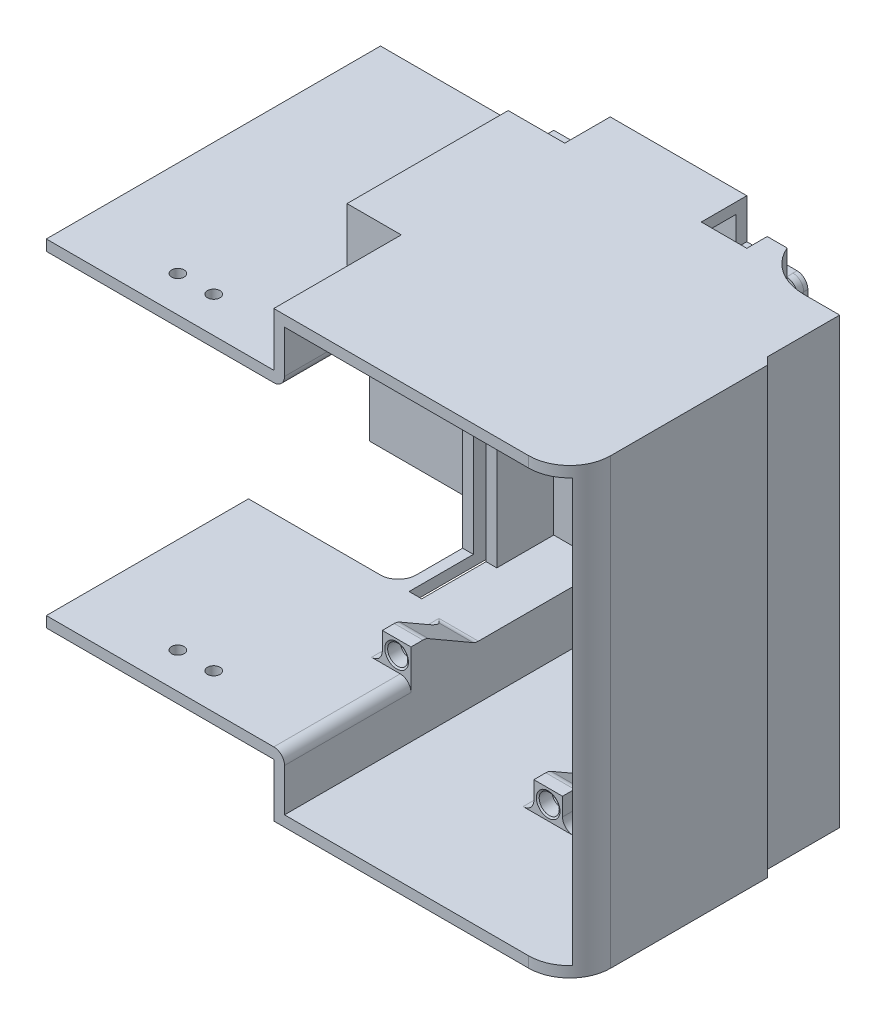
ISO-10303-21;
HEADER;
FILE_DESCRIPTION(('STEP AP214'),'2;1');
FILE_NAME('part.step','',(''),(''),'','','');
FILE_SCHEMA(('AUTOMOTIVE_DESIGN { 1 0 10303 214 1 1 1 1 }'));
ENDSEC;
DATA;
#1=APPLICATION_CONTEXT('core data for automotive mechanical design processes');
#2=APPLICATION_PROTOCOL_DEFINITION('international standard','automotive_design',2000,#1);
#3=PRODUCT_CONTEXT('',#1,'mechanical');
#4=PRODUCT('Part','Part','',(#3));
#5=PRODUCT_RELATED_PRODUCT_CATEGORY('part','',(#4));
#6=PRODUCT_DEFINITION_FORMATION('','',#4);
#7=PRODUCT_DEFINITION_CONTEXT('part definition',#1,'design');
#8=PRODUCT_DEFINITION('design','',#6,#7);
#9=PRODUCT_DEFINITION_SHAPE('','',#8);
#10=(LENGTH_UNIT() NAMED_UNIT(*) SI_UNIT(.MILLI.,.METRE.));
#11=(NAMED_UNIT(*) PLANE_ANGLE_UNIT() SI_UNIT($,.RADIAN.));
#12=(NAMED_UNIT(*) SI_UNIT($,.STERADIAN.) SOLID_ANGLE_UNIT());
#13=UNCERTAINTY_MEASURE_WITH_UNIT(LENGTH_MEASURE(1.E-05),#10,'distance_accuracy_value','');
#14=(GEOMETRIC_REPRESENTATION_CONTEXT(3) GLOBAL_UNCERTAINTY_ASSIGNED_CONTEXT((#13)) GLOBAL_UNIT_ASSIGNED_CONTEXT((#10,
#11,#12)) REPRESENTATION_CONTEXT('',''));
#15=CARTESIAN_POINT('',(0.,0.,0.));
#16=DIRECTION('',(0.,0.,1.));
#17=DIRECTION('',(1.,0.,0.));
#18=AXIS2_PLACEMENT_3D('',#15,#16,#17);
#19=CARTESIAN_POINT('',(114.935,61.9125,52.832));
#20=DIRECTION('',(1.,0.,0.));
#21=DIRECTION('',(0.,0.,-1.));
#22=AXIS2_PLACEMENT_3D('',#19,#20,#21);
#23=PLANE('',#22);
#24=DIRECTION('',(0.,-1.,0.));
#25=VECTOR('',#24,1.);
#26=CARTESIAN_POINT('',(114.935,50.8,59.832));
#27=LINE('',#26,#25);
#28=CARTESIAN_POINT('',(114.935,61.9125,59.832));
#29=VERTEX_POINT('',#28);
#30=CARTESIAN_POINT('',(114.935,58.9125,59.832));
#31=VERTEX_POINT('',#30);
#32=EDGE_CURVE('E694',#29,#31,#27,.T.);
#33=ORIENTED_EDGE('',*,*,#32,.T.);
#34=DIRECTION('',(0.,0.,1.));
#35=VECTOR('',#34,1.);
#36=CARTESIAN_POINT('',(114.935,58.9125,52.832));
#37=LINE('',#36,#35);
#38=CARTESIAN_POINT('',(114.935,58.9125,65.532));
#39=VERTEX_POINT('',#38);
#40=EDGE_CURVE('E1117',#31,#39,#37,.T.);
#41=ORIENTED_EDGE('',*,*,#40,.T.);
#42=DIRECTION('',(0.,1.,0.));
#43=VECTOR('',#42,1.);
#44=CARTESIAN_POINT('',(114.935,-74.295,65.532));
#45=LINE('',#44,#43);
#46=CARTESIAN_POINT('',(114.935,61.9125,65.532));
#47=VERTEX_POINT('',#46);
#48=EDGE_CURVE('E717',#47,#39,#45,.F.);
#49=ORIENTED_EDGE('',*,*,#48,.F.);
#50=DIRECTION('',(0.,0.,1.));
#51=VECTOR('',#50,1.);
#52=CARTESIAN_POINT('',(114.935,61.9125,50.8));
#53=LINE('',#52,#51);
#54=EDGE_CURVE('E710',#29,#47,#53,.T.);
#55=ORIENTED_EDGE('',*,*,#54,.F.);
#56=EDGE_LOOP('',(#33,#41,#49,#55));
#57=FACE_BOUND('',#56,.T.);
#58=ADVANCED_FACE('F36',(#57),#23,.F.);
#59=CARTESIAN_POINT('',(146.05,61.9125,50.8));
#60=DIRECTION('',(0.,1.,0.));
#61=DIRECTION('',(0.,0.,1.));
#62=AXIS2_PLACEMENT_3D('',#59,#60,#61);
#63=PLANE('',#62);
#64=CARTESIAN_POINT('',(133.985,61.9125,53.975));
#65=DIRECTION('',(0.,-1.,0.));
#66=DIRECTION('',(0.,0.,-1.));
#67=AXIS2_PLACEMENT_3D('',#64,#65,#66);
#68=CIRCLE('',#67,14.732);
#69=CARTESIAN_POINT('',(133.985,61.9125,68.707));
#70=VERTEX_POINT('',#69);
#71=CARTESIAN_POINT('',(120.46733100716,61.9125,59.832));
#72=VERTEX_POINT('',#71);
#73=EDGE_CURVE('E714',#70,#72,#68,.T.);
#74=ORIENTED_EDGE('',*,*,#73,.T.);
#75=DIRECTION('',(-1.,0.,0.));
#76=VECTOR('',#75,1.);
#77=CARTESIAN_POINT('',(114.935,61.9125,59.832));
#78=LINE('',#77,#76);
#79=EDGE_CURVE('E697',#72,#29,#78,.T.);
#80=ORIENTED_EDGE('',*,*,#79,.T.);
#81=ORIENTED_EDGE('',*,*,#54,.T.);
#82=DIRECTION('',(1.,0.,0.));
#83=VECTOR('',#82,1.);
#84=CARTESIAN_POINT('',(146.05,61.9125,65.532));
#85=LINE('',#84,#83);
#86=CARTESIAN_POINT('',(102.235,61.9125,65.532));
#87=VERTEX_POINT('',#86);
#88=EDGE_CURVE('E719',#47,#87,#85,.F.);
#89=ORIENTED_EDGE('',*,*,#88,.T.);
#90=DIRECTION('',(0.,0.,1.));
#91=VECTOR('',#90,1.);
#92=CARTESIAN_POINT('',(102.235,61.9125,50.8));
#93=LINE('',#92,#91);
#94=CARTESIAN_POINT('',(102.235,61.9125,52.832));
#95=VERTEX_POINT('',#94);
#96=EDGE_CURVE('E721',#87,#95,#93,.F.);
#97=ORIENTED_EDGE('',*,*,#96,.T.);
#98=DIRECTION('',(1.,0.,0.));
#99=VECTOR('',#98,1.);
#100=CARTESIAN_POINT('',(146.05,61.9125,52.832));
#101=LINE('',#100,#99);
#102=CARTESIAN_POINT('',(64.135,61.9125,52.832));
#103=VERTEX_POINT('',#102);
#104=EDGE_CURVE('E730',#95,#103,#101,.F.);
#105=ORIENTED_EDGE('',*,*,#104,.T.);
#106=DIRECTION('',(0.,0.,1.));
#107=VECTOR('',#106,1.);
#108=CARTESIAN_POINT('',(64.135,61.9125,50.8));
#109=LINE('',#108,#107);
#110=CARTESIAN_POINT('',(64.135,61.9125,65.532));
#111=VERTEX_POINT('',#110);
#112=EDGE_CURVE('E2104',#103,#111,#109,.T.);
#113=ORIENTED_EDGE('',*,*,#112,.T.);
#114=DIRECTION('',(1.,0.,0.));
#115=VECTOR('',#114,1.);
#116=CARTESIAN_POINT('',(146.05,61.9125,65.532));
#117=LINE('',#116,#115);
#118=CARTESIAN_POINT('',(48.375,61.9125,65.532));
#119=VERTEX_POINT('',#118);
#120=EDGE_CURVE('E1124',#111,#119,#117,.F.);
#121=ORIENTED_EDGE('',*,*,#120,.T.);
#122=DIRECTION('',(0.,0.,-1.));
#123=VECTOR('',#122,1.);
#124=CARTESIAN_POINT('',(48.375,61.9125,50.8));
#125=LINE('',#124,#123);
#126=CARTESIAN_POINT('',(48.375,61.9125,110.49));
#127=VERTEX_POINT('',#126);
#128=EDGE_CURVE('E2055',#127,#119,#125,.T.);
#129=ORIENTED_EDGE('',*,*,#128,.F.);
#130=DIRECTION('',(1.,0.,0.));
#131=VECTOR('',#130,1.);
#132=CARTESIAN_POINT('',(146.05,61.9125,110.49));
#133=LINE('',#132,#131);
#134=CARTESIAN_POINT('',(63.5,61.9125,110.49));
#135=VERTEX_POINT('',#134);
#136=EDGE_CURVE('E743',#127,#135,#133,.T.);
#137=ORIENTED_EDGE('',*,*,#136,.T.);
#138=DIRECTION('',(0.,0.,-1.));
#139=VECTOR('',#138,1.);
#140=CARTESIAN_POINT('',(63.5,61.9125,146.05));
#141=LINE('',#140,#139);
#142=CARTESIAN_POINT('',(63.5,61.9125,146.05));
#143=VERTEX_POINT('',#142);
#144=EDGE_CURVE('E740',#135,#143,#141,.F.);
#145=ORIENTED_EDGE('',*,*,#144,.T.);
#146=DIRECTION('',(1.,0.,0.));
#147=VECTOR('',#146,1.);
#148=CARTESIAN_POINT('',(0.,61.9125,146.05));
#149=LINE('',#148,#147);
#150=CARTESIAN_POINT('',(134.62,61.9125,146.05));
#151=VERTEX_POINT('',#150);
#152=EDGE_CURVE('E733',#151,#143,#149,.F.);
#153=ORIENTED_EDGE('',*,*,#152,.F.);
#154=CARTESIAN_POINT('',(134.62,61.9125,134.62));
#155=DIRECTION('',(0.,1.,0.));
#156=DIRECTION('',(0.,0.,1.));
#157=AXIS2_PLACEMENT_3D('',#154,#155,#156);
#158=CIRCLE('',#157,11.43);
#159=CARTESIAN_POINT('',(146.05,61.9125,134.62));
#160=VERTEX_POINT('',#159);
#161=EDGE_CURVE('E1128',#160,#151,#158,.F.);
#162=ORIENTED_EDGE('',*,*,#161,.F.);
#163=DIRECTION('',(0.,0.,1.));
#164=VECTOR('',#163,1.);
#165=CARTESIAN_POINT('',(146.05,61.9125,50.8));
#166=LINE('',#165,#164);
#167=CARTESIAN_POINT('',(146.05,61.9125,90.9));
#168=VERTEX_POINT('',#167);
#169=EDGE_CURVE('E1094',#160,#168,#166,.F.);
#170=ORIENTED_EDGE('',*,*,#169,.T.);
#171=DIRECTION('',(-0.707106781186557,0.,-0.707106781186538));
#172=VECTOR('',#171,1.);
#173=CARTESIAN_POINT('',(126.,61.9125,70.8500000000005));
#174=LINE('',#173,#172);
#175=CARTESIAN_POINT('',(144.05,61.9125,88.9));
#176=VERTEX_POINT('',#175);
#177=EDGE_CURVE('E1091',#168,#176,#174,.T.);
#178=ORIENTED_EDGE('',*,*,#177,.T.);
#179=DIRECTION('',(1.,0.,0.));
#180=VECTOR('',#179,1.);
#181=CARTESIAN_POINT('',(146.05,61.9125,88.9));
#182=LINE('',#181,#180);
#183=CARTESIAN_POINT('',(144.018,61.9125,88.9));
#184=VERTEX_POINT('',#183);
#185=EDGE_CURVE('E1093',#176,#184,#182,.F.);
#186=ORIENTED_EDGE('',*,*,#185,.T.);
#187=DIRECTION('',(0.,0.,1.));
#188=VECTOR('',#187,1.);
#189=CARTESIAN_POINT('',(144.018,61.9125,50.8));
#190=LINE('',#189,#188);
#191=CARTESIAN_POINT('',(144.018,61.9125,68.707));
#192=VERTEX_POINT('',#191);
#193=EDGE_CURVE('E1097',#184,#192,#190,.F.);
#194=ORIENTED_EDGE('',*,*,#193,.T.);
#195=DIRECTION('',(1.,0.,0.));
#196=VECTOR('',#195,1.);
#197=CARTESIAN_POINT('',(146.05,61.9125,68.707));
#198=LINE('',#197,#196);
#199=EDGE_CURVE('E723',#192,#70,#198,.F.);
#200=ORIENTED_EDGE('',*,*,#199,.T.);
#201=EDGE_LOOP('',(#74,#80,#81,#89,#97,#105,#113,#121,#129,#137,#145,#153,#162,#170,#178,#186,
#194,#200));
#202=FACE_BOUND('',#201,.T.);
#203=ADVANCED_FACE('F708',(#202),#63,.T.);
#204=CARTESIAN_POINT('',(0.,58.9125,-240.705250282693));
#205=DIRECTION('',(0.,1.,0.));
#206=DIRECTION('',(0.,0.,1.));
#207=AXIS2_PLACEMENT_3D('',#204,#205,#206);
#208=PLANE('',#207);
#209=DIRECTION('',(1.,0.,0.));
#210=VECTOR('',#209,1.);
#211=CARTESIAN_POINT('',(100.775,58.9125,110.775));
#212=LINE('',#211,#210);
#213=CARTESIAN_POINT('',(97.775,58.9125,110.775));
#214=VERTEX_POINT('',#213);
#215=CARTESIAN_POINT('',(111.775,58.9125,110.775));
#216=VERTEX_POINT('',#215);
#217=EDGE_CURVE('E967',#214,#216,#212,.T.);
#218=ORIENTED_EDGE('',*,*,#217,.T.);
#219=DIRECTION('',(0.,0.,-1.));
#220=VECTOR('',#219,1.);
#221=CARTESIAN_POINT('',(111.775,58.9125,-240.705250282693));
#222=LINE('',#221,#220);
#223=CARTESIAN_POINT('',(111.775,58.9125,91.9711524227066));
#224=VERTEX_POINT('',#223);
#225=EDGE_CURVE('E969',#216,#224,#222,.T.);
#226=ORIENTED_EDGE('',*,*,#225,.T.);
#227=DIRECTION('',(-1.,0.,0.));
#228=VECTOR('',#227,1.);
#229=CARTESIAN_POINT('',(100.775,58.9125,91.9711524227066));
#230=LINE('',#229,#228);
#231=CARTESIAN_POINT('',(97.775,58.9125,91.9711524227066));
#232=VERTEX_POINT('',#231);
#233=EDGE_CURVE('E1608',#224,#232,#230,.T.);
#234=ORIENTED_EDGE('',*,*,#233,.T.);
#235=DIRECTION('',(0.,0.,1.));
#236=VECTOR('',#235,1.);
#237=CARTESIAN_POINT('',(97.775,58.9125,-240.705250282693));
#238=LINE('',#237,#236);
#239=EDGE_CURVE('E1609',#232,#214,#238,.T.);
#240=ORIENTED_EDGE('',*,*,#239,.T.);
#241=EDGE_LOOP('',(#218,#226,#234,#240));
#242=FACE_BOUND('',#241,.T.);
#243=DIRECTION('',(-1.,0.,0.));
#244=VECTOR('',#243,1.);
#245=CARTESIAN_POINT('',(0.,58.9125,59.832));
#246=LINE('',#245,#244);
#247=CARTESIAN_POINT('',(119.253,58.9125,59.832));
#248=VERTEX_POINT('',#247);
#249=EDGE_CURVE('E700',#248,#31,#246,.T.);
#250=ORIENTED_EDGE('',*,*,#249,.F.);
#251=DIRECTION('',(0.,0.,1.));
#252=VECTOR('',#251,1.);
#253=CARTESIAN_POINT('',(119.253,58.9125,-83.146503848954));
#254=LINE('',#253,#252);
#255=CARTESIAN_POINT('',(119.253,58.9125,63.8437385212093));
#256=VERTEX_POINT('',#255);
#257=EDGE_CURVE('E1889',#248,#256,#254,.T.);
#258=ORIENTED_EDGE('',*,*,#257,.T.);
#259=CARTESIAN_POINT('',(133.985,58.9125,53.975));
#260=DIRECTION('',(0.,1.,0.));
#261=DIRECTION('',(-1.,0.,0.));
#262=AXIS2_PLACEMENT_3D('',#259,#260,#261);
#263=CIRCLE('',#262,17.732);
#264=CARTESIAN_POINT('',(133.985,58.9125,71.707));
#265=VERTEX_POINT('',#264);
#266=EDGE_CURVE('E1891',#256,#265,#263,.T.);
#267=ORIENTED_EDGE('',*,*,#266,.T.);
#268=DIRECTION('',(-1.,0.,0.));
#269=VECTOR('',#268,1.);
#270=CARTESIAN_POINT('',(0.,58.9125,71.707));
#271=LINE('',#270,#269);
#272=CARTESIAN_POINT('',(143.05,58.9125,71.707));
#273=VERTEX_POINT('',#272);
#274=EDGE_CURVE('E1005',#273,#265,#271,.T.);
#275=ORIENTED_EDGE('',*,*,#274,.F.);
#276=DIRECTION('',(0.,0.,1.));
#277=VECTOR('',#276,1.);
#278=CARTESIAN_POINT('',(143.05,58.9125,-240.705250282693));
#279=LINE('',#278,#277);
#280=CARTESIAN_POINT('',(143.05,58.9125,142.338808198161));
#281=VERTEX_POINT('',#280);
#282=EDGE_CURVE('E1932',#273,#281,#279,.T.);
#283=ORIENTED_EDGE('',*,*,#282,.T.);
#284=CARTESIAN_POINT('',(134.62,58.9125,134.62));
#285=DIRECTION('',(0.,1.,0.));
#286=DIRECTION('',(0.,0.,1.));
#287=AXIS2_PLACEMENT_3D('',#284,#285,#286);
#288=CIRCLE('',#287,11.43);
#289=CARTESIAN_POINT('',(134.62,58.9125,146.05));
#290=VERTEX_POINT('',#289);
#291=EDGE_CURVE('E2001',#281,#290,#288,.F.);
#292=ORIENTED_EDGE('',*,*,#291,.T.);
#293=DIRECTION('',(-1.,0.,0.));
#294=VECTOR('',#293,1.);
#295=CARTESIAN_POINT('',(0.,58.9125,146.05));
#296=LINE('',#295,#294);
#297=CARTESIAN_POINT('',(66.5,58.9125,146.05));
#298=VERTEX_POINT('',#297);
#299=EDGE_CURVE('E955',#290,#298,#296,.T.);
#300=ORIENTED_EDGE('',*,*,#299,.T.);
#301=DIRECTION('',(0.,0.,1.));
#302=VECTOR('',#301,1.);
#303=CARTESIAN_POINT('',(66.5,58.9125,-240.705250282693));
#304=LINE('',#303,#302);
#305=CARTESIAN_POINT('',(66.5,58.9125,55.832));
#306=VERTEX_POINT('',#305);
#307=EDGE_CURVE('E1904',#306,#298,#304,.T.);
#308=ORIENTED_EDGE('',*,*,#307,.F.);
#309=DIRECTION('',(1.,0.,0.));
#310=VECTOR('',#309,1.);
#311=CARTESIAN_POINT('',(0.,58.9125,55.832));
#312=LINE('',#311,#310);
#313=CARTESIAN_POINT('',(102.235,58.9125,55.832));
#314=VERTEX_POINT('',#313);
#315=EDGE_CURVE('E1612',#306,#314,#312,.T.);
#316=ORIENTED_EDGE('',*,*,#315,.T.);
#317=DIRECTION('',(0.,0.,-1.));
#318=VECTOR('',#317,1.);
#319=CARTESIAN_POINT('',(102.235,58.9125,52.832));
#320=LINE('',#319,#318);
#321=CARTESIAN_POINT('',(102.235,58.9125,65.532));
#322=VERTEX_POINT('',#321);
#323=EDGE_CURVE('E1110',#322,#314,#320,.T.);
#324=ORIENTED_EDGE('',*,*,#323,.F.);
#325=DIRECTION('',(1.,0.,0.));
#326=VECTOR('',#325,1.);
#327=CARTESIAN_POINT('',(0.,58.9125,65.532));
#328=LINE('',#327,#326);
#329=EDGE_CURVE('E1892',#322,#39,#328,.T.);
#330=ORIENTED_EDGE('',*,*,#329,.T.);
#331=ORIENTED_EDGE('',*,*,#40,.F.);
#332=EDGE_LOOP('',(#250,#258,#267,#275,#283,#292,#300,#308,#316,#324,#330,#331));
#333=FACE_BOUND('',#332,.T.);
#334=ADVANCED_FACE('F1469',(#242,#333),#208,.F.);
#335=CARTESIAN_POINT('',(0.,-58.9125,-240.705250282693));
#336=DIRECTION('',(0.,-1.,0.));
#337=DIRECTION('',(0.,0.,1.));
#338=AXIS2_PLACEMENT_3D('',#335,#336,#337);
#339=PLANE('',#338);
#340=DIRECTION('',(0.,0.,-1.));
#341=VECTOR('',#340,1.);
#342=CARTESIAN_POINT('',(111.775,-58.9125,110.775));
#343=LINE('',#342,#341);
#344=CARTESIAN_POINT('',(111.775,-58.9125,91.9711524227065));
#345=VERTEX_POINT('',#344);
#346=CARTESIAN_POINT('',(111.775,-58.9125,110.775));
#347=VERTEX_POINT('',#346);
#348=EDGE_CURVE('E864',#345,#347,#343,.F.);
#349=ORIENTED_EDGE('',*,*,#348,.T.);
#350=DIRECTION('',(1.,0.,0.));
#351=VECTOR('',#350,1.);
#352=CARTESIAN_POINT('',(100.775,-58.9125,110.775));
#353=LINE('',#352,#351);
#354=CARTESIAN_POINT('',(97.775,-58.9125,110.775));
#355=VERTEX_POINT('',#354);
#356=EDGE_CURVE('E914',#355,#347,#353,.T.);
#357=ORIENTED_EDGE('',*,*,#356,.F.);
#358=DIRECTION('',(0.,0.,1.));
#359=VECTOR('',#358,1.);
#360=CARTESIAN_POINT('',(97.775,-58.9125,92.7749999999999));
#361=LINE('',#360,#359);
#362=CARTESIAN_POINT('',(97.775,-58.9125,91.9711524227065));
#363=VERTEX_POINT('',#362);
#364=EDGE_CURVE('E1656',#355,#363,#361,.F.);
#365=ORIENTED_EDGE('',*,*,#364,.T.);
#366=DIRECTION('',(-1.,0.,0.));
#367=VECTOR('',#366,1.);
#368=CARTESIAN_POINT('',(108.775,-58.9125,91.9711524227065));
#369=LINE('',#368,#367);
#370=EDGE_CURVE('E995',#363,#345,#369,.F.);
#371=ORIENTED_EDGE('',*,*,#370,.T.);
#372=EDGE_LOOP('',(#349,#357,#365,#371));
#373=FACE_BOUND('',#372,.T.);
#374=DIRECTION('',(-1.,0.,0.));
#375=VECTOR('',#374,1.);
#376=CARTESIAN_POINT('',(66.5,-58.9125,58.832));
#377=LINE('',#376,#375);
#378=CARTESIAN_POINT('',(102.235,-58.9125,58.832));
#379=VERTEX_POINT('',#378);
#380=CARTESIAN_POINT('',(66.5,-58.9125,58.832));
#381=VERTEX_POINT('',#380);
#382=EDGE_CURVE('E1730',#379,#381,#377,.T.);
#383=ORIENTED_EDGE('',*,*,#382,.T.);
#384=DIRECTION('',(0.,0.,1.));
#385=VECTOR('',#384,1.);
#386=CARTESIAN_POINT('',(66.5,-58.9125,-240.705250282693));
#387=LINE('',#386,#385);
#388=CARTESIAN_POINT('',(66.5,-58.9125,146.05));
#389=VERTEX_POINT('',#388);
#390=EDGE_CURVE('E826',#381,#389,#387,.T.);
#391=ORIENTED_EDGE('',*,*,#390,.T.);
#392=DIRECTION('',(-1.,0.,0.));
#393=VECTOR('',#392,1.);
#394=CARTESIAN_POINT('',(0.,-58.9125,146.05));
#395=LINE('',#394,#393);
#396=CARTESIAN_POINT('',(134.62,-58.9125,146.05));
#397=VERTEX_POINT('',#396);
#398=EDGE_CURVE('E838',#397,#389,#395,.T.);
#399=ORIENTED_EDGE('',*,*,#398,.F.);
#400=CARTESIAN_POINT('',(134.62,-58.9125,134.62));
#401=DIRECTION('',(0.,1.,0.));
#402=DIRECTION('',(0.,0.,1.));
#403=AXIS2_PLACEMENT_3D('',#400,#401,#402);
#404=CIRCLE('',#403,11.43);
#405=CARTESIAN_POINT('',(143.05,-58.9125,142.338808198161));
#406=VERTEX_POINT('',#405);
#407=EDGE_CURVE('E752',#406,#397,#404,.F.);
#408=ORIENTED_EDGE('',*,*,#407,.F.);
#409=DIRECTION('',(0.,0.,1.));
#410=VECTOR('',#409,1.);
#411=CARTESIAN_POINT('',(143.05,-58.9125,-240.705250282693));
#412=LINE('',#411,#410);
#413=CARTESIAN_POINT('',(143.05,-58.9125,71.707));
#414=VERTEX_POINT('',#413);
#415=EDGE_CURVE('E821',#414,#406,#412,.T.);
#416=ORIENTED_EDGE('',*,*,#415,.F.);
#417=DIRECTION('',(-1.,0.,0.));
#418=VECTOR('',#417,1.);
#419=CARTESIAN_POINT('',(0.,-58.9125,71.707));
#420=LINE('',#419,#418);
#421=CARTESIAN_POINT('',(133.985,-58.9125,71.707));
#422=VERTEX_POINT('',#421);
#423=EDGE_CURVE('E828',#414,#422,#420,.T.);
#424=ORIENTED_EDGE('',*,*,#423,.T.);
#425=CARTESIAN_POINT('',(133.985,-58.9125,53.975));
#426=DIRECTION('',(0.,1.,0.));
#427=DIRECTION('',(-1.,0.,0.));
#428=AXIS2_PLACEMENT_3D('',#425,#426,#427);
#429=CIRCLE('',#428,17.732);
#430=CARTESIAN_POINT('',(119.253,-58.9125,63.8437385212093));
#431=VERTEX_POINT('',#430);
#432=EDGE_CURVE('E846',#431,#422,#429,.T.);
#433=ORIENTED_EDGE('',*,*,#432,.F.);
#434=DIRECTION('',(0.,0.,1.));
#435=VECTOR('',#434,1.);
#436=CARTESIAN_POINT('',(119.253,-58.9125,-83.146503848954));
#437=LINE('',#436,#435);
#438=CARTESIAN_POINT('',(119.253,-58.9125,59.832));
#439=VERTEX_POINT('',#438);
#440=EDGE_CURVE('E865',#439,#431,#437,.T.);
#441=ORIENTED_EDGE('',*,*,#440,.F.);
#442=DIRECTION('',(1.,0.,0.));
#443=VECTOR('',#442,1.);
#444=CARTESIAN_POINT('',(0.,-58.9125,59.832));
#445=LINE('',#444,#443);
#446=CARTESIAN_POINT('',(117.935,-58.9125,59.832));
#447=VERTEX_POINT('',#446);
#448=EDGE_CURVE('E1765',#447,#439,#445,.T.);
#449=ORIENTED_EDGE('',*,*,#448,.F.);
#450=CARTESIAN_POINT('',(117.935,-58.9125,62.832));
#451=DIRECTION('',(0.,-1.,0.));
#452=DIRECTION('',(0.,0.,-1.));
#453=AXIS2_PLACEMENT_3D('',#450,#451,#452);
#454=CIRCLE('',#453,3.);
#455=CARTESIAN_POINT('',(114.935,-58.9125,62.832));
#456=VERTEX_POINT('',#455);
#457=EDGE_CURVE('E2141',#447,#456,#454,.F.);
#458=ORIENTED_EDGE('',*,*,#457,.T.);
#459=DIRECTION('',(0.,0.,1.));
#460=VECTOR('',#459,1.);
#461=CARTESIAN_POINT('',(114.935,-58.9125,52.832));
#462=LINE('',#461,#460);
#463=CARTESIAN_POINT('',(114.935,-58.9125,65.532));
#464=VERTEX_POINT('',#463);
#465=EDGE_CURVE('E837',#456,#464,#462,.T.);
#466=ORIENTED_EDGE('',*,*,#465,.T.);
#467=DIRECTION('',(1.,0.,0.));
#468=VECTOR('',#467,1.);
#469=CARTESIAN_POINT('',(0.,-58.9125,65.532));
#470=LINE('',#469,#468);
#471=CARTESIAN_POINT('',(102.235,-58.9125,65.532));
#472=VERTEX_POINT('',#471);
#473=EDGE_CURVE('E857',#472,#464,#470,.T.);
#474=ORIENTED_EDGE('',*,*,#473,.F.);
#475=DIRECTION('',(0.,0.,-1.));
#476=VECTOR('',#475,1.);
#477=CARTESIAN_POINT('',(102.235,-58.9125,52.832));
#478=LINE('',#477,#476);
#479=EDGE_CURVE('E856',#472,#379,#478,.T.);
#480=ORIENTED_EDGE('',*,*,#479,.T.);
#481=EDGE_LOOP('',(#383,#391,#399,#408,#416,#424,#433,#441,#449,#458,#466,#474,#480));
#482=FACE_BOUND('',#481,.T.);
#483=ADVANCED_FACE('F1498',(#373,#482),#339,.F.);
#484=CARTESIAN_POINT('',(146.05,-61.9125,50.8));
#485=DIRECTION('',(0.,-1.,0.));
#486=DIRECTION('',(0.,0.,1.));
#487=AXIS2_PLACEMENT_3D('',#484,#485,#486);
#488=PLANE('',#487);
#489=DIRECTION('',(0.,0.,1.));
#490=VECTOR('',#489,1.);
#491=CARTESIAN_POINT('',(64.135,-61.9125,50.8));
#492=LINE('',#491,#490);
#493=CARTESIAN_POINT('',(64.135,-61.9125,55.832));
#494=VERTEX_POINT('',#493);
#495=CARTESIAN_POINT('',(64.135,-61.9125,65.532));
#496=VERTEX_POINT('',#495);
#497=EDGE_CURVE('E1159',#494,#496,#492,.T.);
#498=ORIENTED_EDGE('',*,*,#497,.F.);
#499=DIRECTION('',(-1.,0.,0.));
#500=VECTOR('',#499,1.);
#501=CARTESIAN_POINT('',(102.235,-61.9125,55.832));
#502=LINE('',#501,#500);
#503=CARTESIAN_POINT('',(102.235,-61.9125,55.832));
#504=VERTEX_POINT('',#503);
#505=EDGE_CURVE('E1751',#504,#494,#502,.T.);
#506=ORIENTED_EDGE('',*,*,#505,.F.);
#507=DIRECTION('',(0.,0.,1.));
#508=VECTOR('',#507,1.);
#509=CARTESIAN_POINT('',(102.235,-61.9125,50.8));
#510=LINE('',#509,#508);
#511=CARTESIAN_POINT('',(102.235,-61.9125,65.532));
#512=VERTEX_POINT('',#511);
#513=EDGE_CURVE('E1804',#512,#504,#510,.F.);
#514=ORIENTED_EDGE('',*,*,#513,.F.);
#515=DIRECTION('',(1.,0.,0.));
#516=VECTOR('',#515,1.);
#517=CARTESIAN_POINT('',(146.05,-61.9125,65.532));
#518=LINE('',#517,#516);
#519=CARTESIAN_POINT('',(114.935,-61.9125,65.532));
#520=VERTEX_POINT('',#519);
#521=EDGE_CURVE('E860',#520,#512,#518,.F.);
#522=ORIENTED_EDGE('',*,*,#521,.F.);
#523=DIRECTION('',(0.,0.,1.));
#524=VECTOR('',#523,1.);
#525=CARTESIAN_POINT('',(114.935,-61.9125,50.8));
#526=LINE('',#525,#524);
#527=CARTESIAN_POINT('',(114.935,-61.9125,62.832));
#528=VERTEX_POINT('',#527);
#529=EDGE_CURVE('E1800',#528,#520,#526,.T.);
#530=ORIENTED_EDGE('',*,*,#529,.F.);
#531=CARTESIAN_POINT('',(117.935,-61.9125,62.832));
#532=DIRECTION('',(0.,-1.,0.));
#533=DIRECTION('',(0.,0.,-1.));
#534=AXIS2_PLACEMENT_3D('',#531,#532,#533);
#535=CIRCLE('',#534,3.);
#536=CARTESIAN_POINT('',(117.935,-61.9125,59.832));
#537=VERTEX_POINT('',#536);
#538=EDGE_CURVE('E1165',#528,#537,#535,.T.);
#539=ORIENTED_EDGE('',*,*,#538,.T.);
#540=DIRECTION('',(1.,0.,0.));
#541=VECTOR('',#540,1.);
#542=CARTESIAN_POINT('',(146.05,-61.9125,59.832));
#543=LINE('',#542,#541);
#544=CARTESIAN_POINT('',(120.46733100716,-61.9125,59.832));
#545=VERTEX_POINT('',#544);
#546=EDGE_CURVE('E765',#537,#545,#543,.T.);
#547=ORIENTED_EDGE('',*,*,#546,.T.);
#548=CARTESIAN_POINT('',(133.985,-61.9125,53.975));
#549=DIRECTION('',(0.,-1.,0.));
#550=DIRECTION('',(0.,0.,-1.));
#551=AXIS2_PLACEMENT_3D('',#548,#549,#550);
#552=CIRCLE('',#551,14.732);
#553=CARTESIAN_POINT('',(133.985,-61.9125,68.707));
#554=VERTEX_POINT('',#553);
#555=EDGE_CURVE('E1813',#554,#545,#552,.T.);
#556=ORIENTED_EDGE('',*,*,#555,.F.);
#557=DIRECTION('',(1.,0.,0.));
#558=VECTOR('',#557,1.);
#559=CARTESIAN_POINT('',(146.05,-61.9125,68.707));
#560=LINE('',#559,#558);
#561=CARTESIAN_POINT('',(144.018,-61.9125,68.707));
#562=VERTEX_POINT('',#561);
#563=EDGE_CURVE('E1958',#562,#554,#560,.F.);
#564=ORIENTED_EDGE('',*,*,#563,.F.);
#565=DIRECTION('',(0.,0.,1.));
#566=VECTOR('',#565,1.);
#567=CARTESIAN_POINT('',(144.018,-61.9125,50.8));
#568=LINE('',#567,#566);
#569=CARTESIAN_POINT('',(144.018,-61.9125,88.9));
#570=VERTEX_POINT('',#569);
#571=EDGE_CURVE('E1090',#570,#562,#568,.F.);
#572=ORIENTED_EDGE('',*,*,#571,.F.);
#573=DIRECTION('',(1.,0.,0.));
#574=VECTOR('',#573,1.);
#575=CARTESIAN_POINT('',(146.05,-61.9125,88.9));
#576=LINE('',#575,#574);
#577=CARTESIAN_POINT('',(144.05,-61.9125,88.9));
#578=VERTEX_POINT('',#577);
#579=EDGE_CURVE('E1089',#578,#570,#576,.F.);
#580=ORIENTED_EDGE('',*,*,#579,.F.);
#581=DIRECTION('',(-0.707106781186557,0.,-0.707106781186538));
#582=VECTOR('',#581,1.);
#583=CARTESIAN_POINT('',(126.,-61.9125,70.8500000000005));
#584=LINE('',#583,#582);
#585=CARTESIAN_POINT('',(146.05,-61.9125,90.9));
#586=VERTEX_POINT('',#585);
#587=EDGE_CURVE('E1770',#586,#578,#584,.T.);
#588=ORIENTED_EDGE('',*,*,#587,.F.);
#589=DIRECTION('',(0.,0.,1.));
#590=VECTOR('',#589,1.);
#591=CARTESIAN_POINT('',(146.05,-61.9125,50.8));
#592=LINE('',#591,#590);
#593=CARTESIAN_POINT('',(146.05,-61.9125,134.62));
#594=VERTEX_POINT('',#593);
#595=EDGE_CURVE('E1786',#594,#586,#592,.F.);
#596=ORIENTED_EDGE('',*,*,#595,.F.);
#597=CARTESIAN_POINT('',(134.62,-61.9125,134.62));
#598=DIRECTION('',(0.,1.,0.));
#599=DIRECTION('',(0.,0.,1.));
#600=AXIS2_PLACEMENT_3D('',#597,#598,#599);
#601=CIRCLE('',#600,11.43);
#602=CARTESIAN_POINT('',(134.62,-61.9125,146.05));
#603=VERTEX_POINT('',#602);
#604=EDGE_CURVE('E1812',#594,#603,#601,.F.);
#605=ORIENTED_EDGE('',*,*,#604,.T.);
#606=DIRECTION('',(1.,0.,0.));
#607=VECTOR('',#606,1.);
#608=CARTESIAN_POINT('',(0.,-61.9125,146.05));
#609=LINE('',#608,#607);
#610=CARTESIAN_POINT('',(63.5,-61.9125,146.05));
#611=VERTEX_POINT('',#610);
#612=EDGE_CURVE('E787',#603,#611,#609,.F.);
#613=ORIENTED_EDGE('',*,*,#612,.T.);
#614=DIRECTION('',(0.,0.,-1.));
#615=VECTOR('',#614,1.);
#616=CARTESIAN_POINT('',(63.5,-61.9125,146.05));
#617=LINE('',#616,#615);
#618=CARTESIAN_POINT('',(63.5,-61.9125,110.49));
#619=VERTEX_POINT('',#618);
#620=EDGE_CURVE('E1848',#619,#611,#617,.F.);
#621=ORIENTED_EDGE('',*,*,#620,.F.);
#622=DIRECTION('',(1.,0.,0.));
#623=VECTOR('',#622,1.);
#624=CARTESIAN_POINT('',(146.05,-61.9125,110.49));
#625=LINE('',#624,#623);
#626=CARTESIAN_POINT('',(48.375,-61.9125,110.49));
#627=VERTEX_POINT('',#626);
#628=EDGE_CURVE('E810',#627,#619,#625,.T.);
#629=ORIENTED_EDGE('',*,*,#628,.F.);
#630=DIRECTION('',(0.,0.,-1.));
#631=VECTOR('',#630,1.);
#632=CARTESIAN_POINT('',(48.375,-61.9125,50.8));
#633=LINE('',#632,#631);
#634=CARTESIAN_POINT('',(48.375,-61.9125,65.532));
#635=VERTEX_POINT('',#634);
#636=EDGE_CURVE('E784',#627,#635,#633,.T.);
#637=ORIENTED_EDGE('',*,*,#636,.T.);
#638=DIRECTION('',(1.,0.,0.));
#639=VECTOR('',#638,1.);
#640=CARTESIAN_POINT('',(146.05,-61.9125,65.532));
#641=LINE('',#640,#639);
#642=EDGE_CURVE('E790',#496,#635,#641,.F.);
#643=ORIENTED_EDGE('',*,*,#642,.F.);
#644=EDGE_LOOP('',(#498,#506,#514,#522,#530,#539,#547,#556,#564,#572,#580,#588,#596,#605,#613,
#621,#629,#637,#643));
#645=FACE_BOUND('',#644,.T.);
#646=ADVANCED_FACE('F1997',(#645),#488,.T.);
#647=CARTESIAN_POINT('',(102.235,-50.8,52.832));
#648=DIRECTION('',(-1.,0.,0.));
#649=DIRECTION('',(0.,0.,1.));
#650=AXIS2_PLACEMENT_3D('',#647,#648,#649);
#651=PLANE('',#650);
#652=DIRECTION('',(0.,-1.,0.));
#653=VECTOR('',#652,1.);
#654=CARTESIAN_POINT('',(102.235,-50.8,55.832));
#655=LINE('',#654,#653);
#656=CARTESIAN_POINT('',(102.235,-50.8,55.832));
#657=VERTEX_POINT('',#656);
#658=EDGE_CURVE('E1749',#657,#504,#655,.T.);
#659=ORIENTED_EDGE('',*,*,#658,.F.);
#660=DIRECTION('',(0.,0.,1.));
#661=VECTOR('',#660,1.);
#662=CARTESIAN_POINT('',(102.235,-50.8,52.832));
#663=LINE('',#662,#661);
#664=CARTESIAN_POINT('',(102.235,-50.8,56.832));
#665=VERTEX_POINT('',#664);
#666=EDGE_CURVE('E1172',#657,#665,#663,.T.);
#667=ORIENTED_EDGE('',*,*,#666,.T.);
#668=DIRECTION('',(0.,-1.,0.));
#669=VECTOR('',#668,1.);
#670=CARTESIAN_POINT('',(102.235,-50.8,56.832));
#671=LINE('',#670,#669);
#672=CARTESIAN_POINT('',(102.235,-49.5128466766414,56.832));
#673=VERTEX_POINT('',#672);
#674=EDGE_CURVE('E1170',#665,#673,#671,.F.);
#675=ORIENTED_EDGE('',*,*,#674,.T.);
#676=DIRECTION('',(0.,0.,-1.));
#677=VECTOR('',#676,1.);
#678=CARTESIAN_POINT('',(102.235,-49.5128466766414,58.832));
#679=LINE('',#678,#677);
#680=CARTESIAN_POINT('',(102.235,-49.5128466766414,57.832));
#681=VERTEX_POINT('',#680);
#682=EDGE_CURVE('E1741',#681,#673,#679,.T.);
#683=ORIENTED_EDGE('',*,*,#682,.F.);
#684=CARTESIAN_POINT('',(102.235,-50.5128466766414,57.832));
#685=DIRECTION('',(-1.,0.,0.));
#686=DIRECTION('',(0.,0.,1.));
#687=AXIS2_PLACEMENT_3D('',#684,#685,#686);
#688=CIRCLE('',#687,1.);
#689=CARTESIAN_POINT('',(102.235,-50.5128466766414,58.832));
#690=VERTEX_POINT('',#689);
#691=EDGE_CURVE('E1168',#681,#690,#688,.F.);
#692=ORIENTED_EDGE('',*,*,#691,.T.);
#693=DIRECTION('',(0.,-1.,0.));
#694=VECTOR('',#693,1.);
#695=CARTESIAN_POINT('',(102.235,-58.9125,58.832));
#696=LINE('',#695,#694);
#697=EDGE_CURVE('E1734',#690,#379,#696,.T.);
#698=ORIENTED_EDGE('',*,*,#697,.T.);
#699=ORIENTED_EDGE('',*,*,#479,.F.);
#700=DIRECTION('',(0.,-1.,0.));
#701=VECTOR('',#700,1.);
#702=CARTESIAN_POINT('',(102.235,-50.8,65.532));
#703=LINE('',#702,#701);
#704=EDGE_CURVE('E1801',#472,#512,#703,.T.);
#705=ORIENTED_EDGE('',*,*,#704,.T.);
#706=ORIENTED_EDGE('',*,*,#513,.T.);
#707=EDGE_LOOP('',(#659,#667,#675,#683,#692,#698,#699,#705,#706));
#708=FACE_BOUND('',#707,.T.);
#709=ADVANCED_FACE('F1746',(#708),#651,.F.);
#710=CARTESIAN_POINT('',(64.135,-61.9125,52.832));
#711=DIRECTION('',(1.,0.,0.));
#712=DIRECTION('',(0.,0.,-1.));
#713=AXIS2_PLACEMENT_3D('',#710,#711,#712);
#714=PLANE('',#713);
#715=DIRECTION('',(0.,1.,0.));
#716=VECTOR('',#715,1.);
#717=CARTESIAN_POINT('',(64.135,-50.8,55.832));
#718=LINE('',#717,#716);
#719=CARTESIAN_POINT('',(64.135,-50.8,55.832));
#720=VERTEX_POINT('',#719);
#721=EDGE_CURVE('E1758',#494,#720,#718,.T.);
#722=ORIENTED_EDGE('',*,*,#721,.F.);
#723=ORIENTED_EDGE('',*,*,#497,.T.);
#724=DIRECTION('',(0.,-1.,0.));
#725=VECTOR('',#724,1.);
#726=CARTESIAN_POINT('',(64.135,74.295,65.532));
#727=LINE('',#726,#725);
#728=CARTESIAN_POINT('',(64.135,-50.8,65.532));
#729=VERTEX_POINT('',#728);
#730=EDGE_CURVE('E791',#496,#729,#727,.F.);
#731=ORIENTED_EDGE('',*,*,#730,.T.);
#732=DIRECTION('',(0.,0.,-1.));
#733=VECTOR('',#732,1.);
#734=CARTESIAN_POINT('',(64.135,-50.8,52.832));
#735=LINE('',#734,#733);
#736=EDGE_CURVE('E1791',#729,#720,#735,.T.);
#737=ORIENTED_EDGE('',*,*,#736,.T.);
#738=EDGE_LOOP('',(#722,#723,#731,#737));
#739=FACE_BOUND('',#738,.T.);
#740=ADVANCED_FACE('F2307',(#739),#714,.F.);
#741=CARTESIAN_POINT('',(114.935,-61.9125,52.832));
#742=DIRECTION('',(1.,0.,0.));
#743=DIRECTION('',(0.,0.,-1.));
#744=AXIS2_PLACEMENT_3D('',#741,#742,#743);
#745=PLANE('',#744);
#746=ORIENTED_EDGE('',*,*,#465,.F.);
#747=DIRECTION('',(0.,1.,0.));
#748=VECTOR('',#747,1.);
#749=CARTESIAN_POINT('',(114.935,-61.9125,62.832));
#750=LINE('',#749,#748);
#751=EDGE_CURVE('E2142',#456,#528,#750,.F.);
#752=ORIENTED_EDGE('',*,*,#751,.T.);
#753=ORIENTED_EDGE('',*,*,#529,.T.);
#754=DIRECTION('',(0.,-1.,0.));
#755=VECTOR('',#754,1.);
#756=CARTESIAN_POINT('',(114.935,74.295,65.532));
#757=LINE('',#756,#755);
#758=EDGE_CURVE('E861',#520,#464,#757,.F.);
#759=ORIENTED_EDGE('',*,*,#758,.T.);
#760=EDGE_LOOP('',(#746,#752,#753,#759));
#761=FACE_BOUND('',#760,.T.);
#762=ADVANCED_FACE('F2148',(#761),#745,.F.);
#763=CARTESIAN_POINT('',(0.,-43.99,-240.705250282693));
#764=DIRECTION('',(0.,-1.,0.));
#765=DIRECTION('',(0.,0.,1.));
#766=AXIS2_PLACEMENT_3D('',#763,#764,#765);
#767=PLANE('',#766);
#768=CARTESIAN_POINT('',(36.75,-43.99,136.05));
#769=DIRECTION('',(0.,-1.,0.));
#770=DIRECTION('',(0.,0.,-1.));
#771=AXIS2_PLACEMENT_3D('',#768,#769,#770);
#772=CIRCLE('',#771,1.75);
#773=CARTESIAN_POINT('',(36.75,-43.99,134.3));
#774=VERTEX_POINT('',#773);
#775=EDGE_CURVE('E991',#774,#774,#772,.T.);
#776=ORIENTED_EDGE('',*,*,#775,.T.);
#777=EDGE_LOOP('',(#776));
#778=FACE_BOUND('',#777,.T.);
#779=CARTESIAN_POINT('',(26.75,-43.99,136.05));
#780=DIRECTION('',(0.,-1.,0.));
#781=DIRECTION('',(0.,0.,-1.));
#782=AXIS2_PLACEMENT_3D('',#779,#780,#781);
#783=CIRCLE('',#782,1.75);
#784=CARTESIAN_POINT('',(26.75,-43.99,134.3));
#785=VERTEX_POINT('',#784);
#786=EDGE_CURVE('E994',#785,#785,#783,.T.);
#787=ORIENTED_EDGE('',*,*,#786,.T.);
#788=EDGE_LOOP('',(#787));
#789=FACE_BOUND('',#788,.T.);
#790=DIRECTION('',(-1.,0.,0.));
#791=VECTOR('',#790,1.);
#792=CARTESIAN_POINT('',(0.,-43.99,89.65));
#793=LINE('',#792,#791);
#794=CARTESIAN_POINT('',(36.843,-43.99,89.65));
#795=VERTEX_POINT('',#794);
#796=CARTESIAN_POINT('',(0.0500000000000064,-43.99,89.65));
#797=VERTEX_POINT('',#796);
#798=EDGE_CURVE('E1008',#795,#797,#793,.T.);
#799=ORIENTED_EDGE('',*,*,#798,.T.);
#800=DIRECTION('',(0.,0.,1.));
#801=VECTOR('',#800,1.);
#802=CARTESIAN_POINT('',(0.0500000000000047,-43.99,-240.705250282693));
#803=LINE('',#802,#801);
#804=CARTESIAN_POINT('',(0.0500000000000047,-43.99,146.05));
#805=VERTEX_POINT('',#804);
#806=EDGE_CURVE('E1039',#797,#805,#803,.T.);
#807=ORIENTED_EDGE('',*,*,#806,.T.);
#808=DIRECTION('',(-1.,0.,0.));
#809=VECTOR('',#808,1.);
#810=CARTESIAN_POINT('',(0.,-43.99,146.05));
#811=LINE('',#810,#809);
#812=CARTESIAN_POINT('',(63.5,-43.99,146.05));
#813=VERTEX_POINT('',#812);
#814=EDGE_CURVE('E820',#813,#805,#811,.T.);
#815=ORIENTED_EDGE('',*,*,#814,.F.);
#816=DIRECTION('',(0.,0.,1.));
#817=VECTOR('',#816,1.);
#818=CARTESIAN_POINT('',(63.5,-43.99,-240.705250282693));
#819=LINE('',#818,#817);
#820=CARTESIAN_POINT('',(63.5,-43.99,110.775));
#821=VERTEX_POINT('',#820);
#822=EDGE_CURVE('E1042',#813,#821,#819,.F.);
#823=ORIENTED_EDGE('',*,*,#822,.T.);
#824=DIRECTION('',(1.,0.,0.));
#825=VECTOR('',#824,1.);
#826=CARTESIAN_POINT('',(66.5,-43.99,110.775));
#827=LINE('',#826,#825);
#828=CARTESIAN_POINT('',(55.5,-43.99,110.775));
#829=VERTEX_POINT('',#828);
#830=EDGE_CURVE('E891',#829,#821,#827,.T.);
#831=ORIENTED_EDGE('',*,*,#830,.F.);
#832=DIRECTION('',(0.,0.,1.));
#833=VECTOR('',#832,1.);
#834=CARTESIAN_POINT('',(55.5,-43.99,92.7749999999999));
#835=LINE('',#834,#833);
#836=CARTESIAN_POINT('',(55.5,-43.99,91.9711524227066));
#837=VERTEX_POINT('',#836);
#838=EDGE_CURVE('E1690',#829,#837,#835,.F.);
#839=ORIENTED_EDGE('',*,*,#838,.T.);
#840=DIRECTION('',(-1.,0.,0.));
#841=VECTOR('',#840,1.);
#842=CARTESIAN_POINT('',(66.5,-43.99,91.9711524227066));
#843=LINE('',#842,#841);
#844=CARTESIAN_POINT('',(66.5,-43.99,91.9711524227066));
#845=VERTEX_POINT('',#844);
#846=EDGE_CURVE('E873',#837,#845,#843,.F.);
#847=ORIENTED_EDGE('',*,*,#846,.T.);
#848=DIRECTION('',(0.,0.,1.));
#849=VECTOR('',#848,1.);
#850=CARTESIAN_POINT('',(66.5,-43.99,-240.705250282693));
#851=LINE('',#850,#849);
#852=CARTESIAN_POINT('',(66.5,-43.99,55.832));
#853=VERTEX_POINT('',#852);
#854=EDGE_CURVE('E830',#853,#845,#851,.T.);
#855=ORIENTED_EDGE('',*,*,#854,.F.);
#856=DIRECTION('',(1.,0.,0.));
#857=VECTOR('',#856,1.);
#858=CARTESIAN_POINT('',(0.,-43.99,55.832));
#859=LINE('',#858,#857);
#860=CARTESIAN_POINT('',(51.375,-43.99,55.832));
#861=VERTEX_POINT('',#860);
#862=EDGE_CURVE('E874',#861,#853,#859,.T.);
#863=ORIENTED_EDGE('',*,*,#862,.F.);
#864=DIRECTION('',(0.,0.,1.));
#865=VECTOR('',#864,1.);
#866=CARTESIAN_POINT('',(51.375,-43.99,-83.146503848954));
#867=LINE('',#866,#865);
#868=CARTESIAN_POINT('',(51.375,-43.99,71.707));
#869=VERTEX_POINT('',#868);
#870=EDGE_CURVE('E869',#861,#869,#867,.T.);
#871=ORIENTED_EDGE('',*,*,#870,.T.);
#872=DIRECTION('',(-1.,0.,0.));
#873=VECTOR('',#872,1.);
#874=CARTESIAN_POINT('',(0.,-43.99,71.707));
#875=LINE('',#874,#873);
#876=CARTESIAN_POINT('',(48.375,-43.99,71.707));
#877=VERTEX_POINT('',#876);
#878=EDGE_CURVE('E872',#869,#877,#875,.T.);
#879=ORIENTED_EDGE('',*,*,#878,.T.);
#880=DIRECTION('',(0.,0.,1.));
#881=VECTOR('',#880,1.);
#882=CARTESIAN_POINT('',(48.375,-43.99,0.));
#883=LINE('',#882,#881);
#884=CARTESIAN_POINT('',(48.375,-43.99,89.65));
#885=VERTEX_POINT('',#884);
#886=EDGE_CURVE('E1061',#877,#885,#883,.T.);
#887=ORIENTED_EDGE('',*,*,#886,.T.);
#888=DIRECTION('',(1.,0.,0.));
#889=VECTOR('',#888,1.);
#890=CARTESIAN_POINT('',(0.,-43.99,89.65));
#891=LINE('',#890,#889);
#892=CARTESIAN_POINT('',(44.843,-43.99,89.65));
#893=VERTEX_POINT('',#892);
#894=EDGE_CURVE('E806',#893,#885,#891,.T.);
#895=ORIENTED_EDGE('',*,*,#894,.F.);
#896=DIRECTION('',(0.,0.,1.));
#897=VECTOR('',#896,1.);
#898=CARTESIAN_POINT('',(44.843,-43.99,0.));
#899=LINE('',#898,#897);
#900=CARTESIAN_POINT('',(44.843,-43.99,71.707));
#901=VERTEX_POINT('',#900);
#902=EDGE_CURVE('E756',#901,#893,#899,.T.);
#903=ORIENTED_EDGE('',*,*,#902,.F.);
#904=CARTESIAN_POINT('',(41.843,-43.99,71.707));
#905=VERTEX_POINT('',#904);
#906=EDGE_CURVE('E1062',#901,#905,#875,.T.);
#907=ORIENTED_EDGE('',*,*,#906,.T.);
#908=DIRECTION('',(0.,0.,1.));
#909=VECTOR('',#908,1.);
#910=CARTESIAN_POINT('',(41.8429999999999,-43.99,-240.705250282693));
#911=LINE('',#910,#909);
#912=CARTESIAN_POINT('',(41.843,-43.99,84.65));
#913=VERTEX_POINT('',#912);
#914=EDGE_CURVE('E1077',#905,#913,#911,.T.);
#915=ORIENTED_EDGE('',*,*,#914,.T.);
#916=CARTESIAN_POINT('',(36.843,-43.99,84.65));
#917=DIRECTION('',(0.,-1.,0.));
#918=DIRECTION('',(0.,0.,-1.));
#919=AXIS2_PLACEMENT_3D('',#916,#917,#918);
#920=CIRCLE('',#919,5.);
#921=EDGE_CURVE('E1075',#913,#795,#920,.T.);
#922=ORIENTED_EDGE('',*,*,#921,.T.);
#923=EDGE_LOOP('',(#799,#807,#815,#823,#831,#839,#847,#855,#863,#871,#879,#887,#895,#903,#907,
#915,#922));
#924=FACE_BOUND('',#923,.T.);
#925=ADVANCED_FACE('F1522',(#778,#789,#924),#767,.F.);
#926=CARTESIAN_POINT('',(0.,0.,71.707));
#927=DIRECTION('',(0.,0.,-1.));
#928=DIRECTION('',(1.,0.,0.));
#929=AXIS2_PLACEMENT_3D('',#926,#927,#928);
#930=PLANE('',#929);
#931=DIRECTION('',(0.,1.,0.));
#932=VECTOR('',#931,1.);
#933=CARTESIAN_POINT('',(48.375,-61.9126030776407,71.707));
#934=LINE('',#933,#932);
#935=CARTESIAN_POINT('',(48.375,43.99,71.707));
#936=VERTEX_POINT('',#935);
#937=EDGE_CURVE('E813',#877,#936,#934,.T.);
#938=ORIENTED_EDGE('',*,*,#937,.F.);
#939=ORIENTED_EDGE('',*,*,#878,.F.);
#940=DIRECTION('',(0.,1.,0.));
#941=VECTOR('',#940,1.);
#942=CARTESIAN_POINT('',(51.375,0.,71.707));
#943=LINE('',#942,#941);
#944=CARTESIAN_POINT('',(51.375,43.99,71.707));
#945=VERTEX_POINT('',#944);
#946=EDGE_CURVE('E1053',#869,#945,#943,.T.);
#947=ORIENTED_EDGE('',*,*,#946,.T.);
#948=DIRECTION('',(-1.,0.,0.));
#949=VECTOR('',#948,1.);
#950=CARTESIAN_POINT('',(0.,43.99,71.707));
#951=LINE('',#950,#949);
#952=EDGE_CURVE('E1049',#945,#936,#951,.T.);
#953=ORIENTED_EDGE('',*,*,#952,.T.);
#954=EDGE_LOOP('',(#938,#939,#947,#953));
#955=FACE_BOUND('',#954,.T.);
#956=ADVANCED_FACE('F1409',(#955),#930,.F.);
#957=CARTESIAN_POINT('',(114.935,50.8,52.832));
#958=DIRECTION('',(0.,-1.,0.));
#959=DIRECTION('',(0.,0.,-1.));
#960=AXIS2_PLACEMENT_3D('',#957,#958,#959);
#961=PLANE('',#960);
#962=DIRECTION('',(-1.,0.,0.));
#963=VECTOR('',#962,1.);
#964=CARTESIAN_POINT('',(114.935,50.8,55.832));
#965=LINE('',#964,#963);
#966=CARTESIAN_POINT('',(116.350506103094,50.8,55.832));
#967=VERTEX_POINT('',#966);
#968=CARTESIAN_POINT('',(102.235,50.8,55.832));
#969=VERTEX_POINT('',#968);
#970=EDGE_CURVE('E881',#967,#969,#965,.T.);
#971=ORIENTED_EDGE('',*,*,#970,.F.);
#972=CARTESIAN_POINT('',(133.985,50.8,53.975));
#973=DIRECTION('',(0.,-1.,0.));
#974=DIRECTION('',(0.,0.,-1.));
#975=AXIS2_PLACEMENT_3D('',#972,#973,#974);
#976=CIRCLE('',#975,17.732);
#977=CARTESIAN_POINT('',(116.253,50.8,53.975));
#978=VERTEX_POINT('',#977);
#979=EDGE_CURVE('E1142',#967,#978,#976,.T.);
#980=ORIENTED_EDGE('',*,*,#979,.T.);
#981=DIRECTION('',(0.,0.,1.));
#982=VECTOR('',#981,1.);
#983=CARTESIAN_POINT('',(116.253,50.8,52.832));
#984=LINE('',#983,#982);
#985=CARTESIAN_POINT('',(116.253,50.8,52.832));
#986=VERTEX_POINT('',#985);
#987=EDGE_CURVE('E1241',#978,#986,#984,.F.);
#988=ORIENTED_EDGE('',*,*,#987,.T.);
#989=DIRECTION('',(1.,0.,0.));
#990=VECTOR('',#989,1.);
#991=CARTESIAN_POINT('',(45.593,50.8,52.832));
#992=LINE('',#991,#990);
#993=CARTESIAN_POINT('',(102.235,50.8,52.832));
#994=VERTEX_POINT('',#993);
#995=EDGE_CURVE('E1052',#986,#994,#992,.F.);
#996=ORIENTED_EDGE('',*,*,#995,.T.);
#997=DIRECTION('',(0.,0.,1.));
#998=VECTOR('',#997,1.);
#999=CARTESIAN_POINT('',(102.235,50.8,52.832));
#1000=LINE('',#999,#998);
#1001=EDGE_CURVE('E1112',#994,#969,#1000,.T.);
#1002=ORIENTED_EDGE('',*,*,#1001,.T.);
#1003=EDGE_LOOP('',(#971,#980,#988,#996,#1002));
#1004=FACE_BOUND('',#1003,.T.);
#1005=ADVANCED_FACE('F1405',(#1004),#961,.F.);
#1006=DIRECTION('',(0.,1.,0.));
#1007=VECTOR('',#1006,1.);
#1008=CARTESIAN_POINT('',(41.843,0.,71.707));
#1009=LINE('',#1008,#1007);
#1010=CARTESIAN_POINT('',(41.843,43.99,71.707));
#1011=VERTEX_POINT('',#1010);
#1012=EDGE_CURVE('E1081',#905,#1011,#1009,.T.);
#1013=ORIENTED_EDGE('',*,*,#1012,.F.);
#1014=ORIENTED_EDGE('',*,*,#906,.F.);
#1015=DIRECTION('',(0.,1.,0.));
#1016=VECTOR('',#1015,1.);
#1017=CARTESIAN_POINT('',(44.843,-61.9126030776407,71.707));
#1018=LINE('',#1017,#1016);
#1019=CARTESIAN_POINT('',(44.843,43.99,71.707));
#1020=VERTEX_POINT('',#1019);
#1021=EDGE_CURVE('E1115',#901,#1020,#1018,.T.);
#1022=ORIENTED_EDGE('',*,*,#1021,.T.);
#1023=EDGE_CURVE('E1000',#1020,#1011,#951,.T.);
#1024=ORIENTED_EDGE('',*,*,#1023,.T.);
#1025=EDGE_LOOP('',(#1013,#1014,#1022,#1024));
#1026=FACE_BOUND('',#1025,.T.);
#1027=ADVANCED_FACE('F1408',(#1026),#930,.F.);
#1028=CARTESIAN_POINT('',(1.27,46.99,146.05));
#1029=DIRECTION('',(0.,-1.,0.));
#1030=DIRECTION('',(0.,0.,-1.));
#1031=AXIS2_PLACEMENT_3D('',#1028,#1029,#1030);
#1032=PLANE('',#1031);
#1033=CARTESIAN_POINT('',(36.75,46.99,136.05));
#1034=DIRECTION('',(0.,-1.,0.));
#1035=DIRECTION('',(0.,0.,-1.));
#1036=AXIS2_PLACEMENT_3D('',#1033,#1034,#1035);
#1037=CIRCLE('',#1036,1.75);
#1038=CARTESIAN_POINT('',(36.75,46.99,134.3));
#1039=VERTEX_POINT('',#1038);
#1040=EDGE_CURVE('E996',#1039,#1039,#1037,.T.);
#1041=ORIENTED_EDGE('',*,*,#1040,.T.);
#1042=EDGE_LOOP('',(#1041));
#1043=FACE_BOUND('',#1042,.T.);
#1044=CARTESIAN_POINT('',(26.75,46.99,136.05));
#1045=DIRECTION('',(0.,-1.,0.));
#1046=DIRECTION('',(0.,0.,-1.));
#1047=AXIS2_PLACEMENT_3D('',#1044,#1045,#1046);
#1048=CIRCLE('',#1047,1.75);
#1049=CARTESIAN_POINT('',(26.75,46.99,134.3));
#1050=VERTEX_POINT('',#1049);
#1051=EDGE_CURVE('E999',#1050,#1050,#1048,.T.);
#1052=ORIENTED_EDGE('',*,*,#1051,.T.);
#1053=EDGE_LOOP('',(#1052));
#1054=FACE_BOUND('',#1053,.T.);
#1055=DIRECTION('',(1.,0.,0.));
#1056=VECTOR('',#1055,1.);
#1057=CARTESIAN_POINT('',(48.375,46.99,52.832));
#1058=LINE('',#1057,#1056);
#1059=CARTESIAN_POINT('',(0.049999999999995,46.99,52.832));
#1060=VERTEX_POINT('',#1059);
#1061=CARTESIAN_POINT('',(44.843,46.99,52.832));
#1062=VERTEX_POINT('',#1061);
#1063=EDGE_CURVE('E1036',#1060,#1062,#1058,.T.);
#1064=ORIENTED_EDGE('',*,*,#1063,.F.);
#1065=DIRECTION('',(0.,0.,1.));
#1066=VECTOR('',#1065,1.);
#1067=CARTESIAN_POINT('',(0.0499999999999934,46.99,146.05));
#1068=LINE('',#1067,#1066);
#1069=CARTESIAN_POINT('',(0.0499999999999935,46.99,146.05));
#1070=VERTEX_POINT('',#1069);
#1071=EDGE_CURVE('E1011',#1060,#1070,#1068,.T.);
#1072=ORIENTED_EDGE('',*,*,#1071,.T.);
#1073=DIRECTION('',(1.,0.,0.));
#1074=VECTOR('',#1073,1.);
#1075=CARTESIAN_POINT('',(0.,46.99,146.05));
#1076=LINE('',#1075,#1074);
#1077=CARTESIAN_POINT('',(63.5,46.99,146.05));
#1078=VERTEX_POINT('',#1077);
#1079=EDGE_CURVE('E748',#1078,#1070,#1076,.F.);
#1080=ORIENTED_EDGE('',*,*,#1079,.F.);
#1081=DIRECTION('',(0.,0.,-1.));
#1082=VECTOR('',#1081,1.);
#1083=CARTESIAN_POINT('',(63.5,46.99,146.05));
#1084=LINE('',#1083,#1082);
#1085=CARTESIAN_POINT('',(63.5,46.99,110.49));
#1086=VERTEX_POINT('',#1085);
#1087=EDGE_CURVE('E742',#1086,#1078,#1084,.F.);
#1088=ORIENTED_EDGE('',*,*,#1087,.F.);
#1089=DIRECTION('',(1.,0.,0.));
#1090=VECTOR('',#1089,1.);
#1091=CARTESIAN_POINT('',(1.27,46.99,110.49));
#1092=LINE('',#1091,#1090);
#1093=CARTESIAN_POINT('',(48.375,46.99,110.49));
#1094=VERTEX_POINT('',#1093);
#1095=EDGE_CURVE('E1125',#1094,#1086,#1092,.T.);
#1096=ORIENTED_EDGE('',*,*,#1095,.F.);
#1097=DIRECTION('',(0.,0.,-1.));
#1098=VECTOR('',#1097,1.);
#1099=CARTESIAN_POINT('',(48.375,46.99,146.050103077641));
#1100=LINE('',#1099,#1098);
#1101=CARTESIAN_POINT('',(48.375,46.99,89.65));
#1102=VERTEX_POINT('',#1101);
#1103=EDGE_CURVE('E1024',#1094,#1102,#1100,.T.);
#1104=ORIENTED_EDGE('',*,*,#1103,.T.);
#1105=DIRECTION('',(1.,0.,0.));
#1106=VECTOR('',#1105,1.);
#1107=CARTESIAN_POINT('',(1.27,46.99,89.65));
#1108=LINE('',#1107,#1106);
#1109=CARTESIAN_POINT('',(44.843,46.99,89.65));
#1110=VERTEX_POINT('',#1109);
#1111=EDGE_CURVE('E796',#1110,#1102,#1108,.T.);
#1112=ORIENTED_EDGE('',*,*,#1111,.F.);
#1113=DIRECTION('',(0.,0.,1.));
#1114=VECTOR('',#1113,1.);
#1115=CARTESIAN_POINT('',(44.843,46.99,146.05));
#1116=LINE('',#1115,#1114);
#1117=EDGE_CURVE('E802',#1062,#1110,#1116,.T.);
#1118=ORIENTED_EDGE('',*,*,#1117,.F.);
#1119=EDGE_LOOP('',(#1064,#1072,#1080,#1088,#1096,#1104,#1112,#1118));
#1120=FACE_BOUND('',#1119,.T.);
#1121=ADVANCED_FACE('F1415',(#1043,#1054,#1120),#1032,.F.);
#1122=CARTESIAN_POINT('',(64.135,50.8,52.832));
#1123=DIRECTION('',(0.,-1.,0.));
#1124=DIRECTION('',(0.,0.,-1.));
#1125=AXIS2_PLACEMENT_3D('',#1122,#1123,#1124);
#1126=PLANE('',#1125);
#1127=DIRECTION('',(1.,0.,0.));
#1128=VECTOR('',#1127,1.);
#1129=CARTESIAN_POINT('',(45.593,50.8,52.832));
#1130=LINE('',#1129,#1128);
#1131=CARTESIAN_POINT('',(64.135,50.8,52.832));
#1132=VERTEX_POINT('',#1131);
#1133=CARTESIAN_POINT('',(48.375,50.8,52.832));
#1134=VERTEX_POINT('',#1133);
#1135=EDGE_CURVE('E1103',#1132,#1134,#1130,.F.);
#1136=ORIENTED_EDGE('',*,*,#1135,.T.);
#1137=DIRECTION('',(0.,0.,1.));
#1138=VECTOR('',#1137,1.);
#1139=CARTESIAN_POINT('',(48.375,50.8,52.832));
#1140=LINE('',#1139,#1138);
#1141=CARTESIAN_POINT('',(48.375,50.8,65.532));
#1142=VERTEX_POINT('',#1141);
#1143=EDGE_CURVE('E2064',#1134,#1142,#1140,.T.);
#1144=ORIENTED_EDGE('',*,*,#1143,.T.);
#1145=DIRECTION('',(-1.,0.,0.));
#1146=VECTOR('',#1145,1.);
#1147=CARTESIAN_POINT('',(0.,50.8,65.532));
#1148=LINE('',#1147,#1146);
#1149=CARTESIAN_POINT('',(64.135,50.8,65.532));
#1150=VERTEX_POINT('',#1149);
#1151=EDGE_CURVE('E2094',#1150,#1142,#1148,.T.);
#1152=ORIENTED_EDGE('',*,*,#1151,.F.);
#1153=DIRECTION('',(0.,0.,-1.));
#1154=VECTOR('',#1153,1.);
#1155=CARTESIAN_POINT('',(64.135,50.8,52.832));
#1156=LINE('',#1155,#1154);
#1157=EDGE_CURVE('E1955',#1150,#1132,#1156,.T.);
#1158=ORIENTED_EDGE('',*,*,#1157,.T.);
#1159=EDGE_LOOP('',(#1136,#1144,#1152,#1158));
#1160=FACE_BOUND('',#1159,.T.);
#1161=ADVANCED_FACE('F1411',(#1160),#1126,.F.);
#1162=CARTESIAN_POINT('',(119.253,-61.9125,50.8));
#1163=DIRECTION('',(-1.,0.,0.));
#1164=DIRECTION('',(0.,0.,1.));
#1165=AXIS2_PLACEMENT_3D('',#1162,#1163,#1164);
#1166=PLANE('',#1165);
#1167=DIRECTION('',(0.,-1.,0.));
#1168=VECTOR('',#1167,1.);
#1169=CARTESIAN_POINT('',(119.253,223.33077,53.975));
#1170=LINE('',#1169,#1168);
#1171=CARTESIAN_POINT('',(119.253,47.8,53.975));
#1172=VERTEX_POINT('',#1171);
#1173=CARTESIAN_POINT('',(119.253,-47.8,53.975));
#1174=VERTEX_POINT('',#1173);
#1175=EDGE_CURVE('E1141',#1172,#1174,#1170,.T.);
#1176=ORIENTED_EDGE('',*,*,#1175,.T.);
#1177=DIRECTION('',(0.,0.,-1.));
#1178=VECTOR('',#1177,1.);
#1179=CARTESIAN_POINT('',(119.253,-47.8,50.8));
#1180=LINE('',#1179,#1178);
#1181=CARTESIAN_POINT('',(119.253,-47.8,52.832));
#1182=VERTEX_POINT('',#1181);
#1183=EDGE_CURVE('E1146',#1174,#1182,#1180,.T.);
#1184=ORIENTED_EDGE('',*,*,#1183,.T.);
#1185=DIRECTION('',(0.,1.,0.));
#1186=VECTOR('',#1185,1.);
#1187=CARTESIAN_POINT('',(119.253,-74.295,52.832));
#1188=LINE('',#1187,#1186);
#1189=CARTESIAN_POINT('',(119.253,47.8,52.832));
#1190=VERTEX_POINT('',#1189);
#1191=EDGE_CURVE('E1137',#1182,#1190,#1188,.T.);
#1192=ORIENTED_EDGE('',*,*,#1191,.T.);
#1193=DIRECTION('',(0.,0.,1.));
#1194=VECTOR('',#1193,1.);
#1195=CARTESIAN_POINT('',(119.253,47.8,50.8));
#1196=LINE('',#1195,#1194);
#1197=EDGE_CURVE('E1144',#1190,#1172,#1196,.T.);
#1198=ORIENTED_EDGE('',*,*,#1197,.T.);
#1199=EDGE_LOOP('',(#1176,#1184,#1192,#1198));
#1200=FACE_BOUND('',#1199,.T.);
#1201=ADVANCED_FACE('F1414',(#1200),#1166,.F.);
#1202=CARTESIAN_POINT('',(0.,-74.295,65.532));
#1203=DIRECTION('',(0.,0.,-1.));
#1204=DIRECTION('',(-1.,0.,0.));
#1205=AXIS2_PLACEMENT_3D('',#1202,#1203,#1204);
#1206=PLANE('',#1205);
#1207=ORIENTED_EDGE('',*,*,#329,.F.);
#1208=DIRECTION('',(0.,1.,0.));
#1209=VECTOR('',#1208,1.);
#1210=CARTESIAN_POINT('',(102.235,50.8,65.532));
#1211=LINE('',#1210,#1209);
#1212=EDGE_CURVE('E1111',#322,#87,#1211,.T.);
#1213=ORIENTED_EDGE('',*,*,#1212,.T.);
#1214=ORIENTED_EDGE('',*,*,#88,.F.);
#1215=ORIENTED_EDGE('',*,*,#48,.T.);
#1216=EDGE_LOOP('',(#1207,#1213,#1214,#1215));
#1217=FACE_BOUND('',#1216,.T.);
#1218=ADVANCED_FACE('F1420',(#1217),#1206,.T.);
#1219=CARTESIAN_POINT('',(102.235,50.8,52.832));
#1220=DIRECTION('',(-1.,0.,0.));
#1221=DIRECTION('',(0.,0.,1.));
#1222=AXIS2_PLACEMENT_3D('',#1219,#1220,#1221);
#1223=PLANE('',#1222);
#1224=ORIENTED_EDGE('',*,*,#1212,.F.);
#1225=ORIENTED_EDGE('',*,*,#323,.T.);
#1226=DIRECTION('',(0.,1.,0.));
#1227=VECTOR('',#1226,1.);
#1228=CARTESIAN_POINT('',(102.235,50.8,55.832));
#1229=LINE('',#1228,#1227);
#1230=EDGE_CURVE('E1895',#969,#314,#1229,.T.);
#1231=ORIENTED_EDGE('',*,*,#1230,.F.);
#1232=ORIENTED_EDGE('',*,*,#1001,.F.);
#1233=DIRECTION('',(0.,1.,0.));
#1234=VECTOR('',#1233,1.);
#1235=CARTESIAN_POINT('',(102.235,-74.295,52.832));
#1236=LINE('',#1235,#1234);
#1237=EDGE_CURVE('E1938',#994,#95,#1236,.T.);
#1238=ORIENTED_EDGE('',*,*,#1237,.T.);
#1239=ORIENTED_EDGE('',*,*,#96,.F.);
#1240=EDGE_LOOP('',(#1224,#1225,#1231,#1232,#1238,#1239));
#1241=FACE_BOUND('',#1240,.T.);
#1242=ADVANCED_FACE('F1426',(#1241),#1223,.F.);
#1243=CARTESIAN_POINT('',(64.135,61.9125,52.832));
#1244=DIRECTION('',(1.,0.,0.));
#1245=DIRECTION('',(0.,0.,-1.));
#1246=AXIS2_PLACEMENT_3D('',#1243,#1244,#1245);
#1247=PLANE('',#1246);
#1248=ORIENTED_EDGE('',*,*,#1157,.F.);
#1249=DIRECTION('',(0.,1.,0.));
#1250=VECTOR('',#1249,1.);
#1251=CARTESIAN_POINT('',(64.135,-74.295,65.532));
#1252=LINE('',#1251,#1250);
#1253=EDGE_CURVE('E1948',#111,#1150,#1252,.F.);
#1254=ORIENTED_EDGE('',*,*,#1253,.F.);
#1255=ORIENTED_EDGE('',*,*,#112,.F.);
#1256=DIRECTION('',(0.,1.,0.));
#1257=VECTOR('',#1256,1.);
#1258=CARTESIAN_POINT('',(64.135,-74.295,52.832));
#1259=LINE('',#1258,#1257);
#1260=EDGE_CURVE('E1941',#103,#1132,#1259,.F.);
#1261=ORIENTED_EDGE('',*,*,#1260,.T.);
#1262=EDGE_LOOP('',(#1248,#1254,#1255,#1261));
#1263=FACE_BOUND('',#1262,.T.);
#1264=ADVANCED_FACE('F1430',(#1263),#1247,.F.);
#1265=CARTESIAN_POINT('',(0.,-74.295,65.532));
#1266=DIRECTION('',(0.,0.,-1.));
#1267=DIRECTION('',(-1.,0.,0.));
#1268=AXIS2_PLACEMENT_3D('',#1265,#1266,#1267);
#1269=PLANE('',#1268);
#1270=DIRECTION('',(0.,-1.,0.));
#1271=VECTOR('',#1270,1.);
#1272=CARTESIAN_POINT('',(48.375,-74.295,65.532));
#1273=LINE('',#1272,#1271);
#1274=EDGE_CURVE('E2010',#119,#1142,#1273,.T.);
#1275=ORIENTED_EDGE('',*,*,#1274,.F.);
#1276=ORIENTED_EDGE('',*,*,#120,.F.);
#1277=ORIENTED_EDGE('',*,*,#1253,.T.);
#1278=ORIENTED_EDGE('',*,*,#1151,.T.);
#1279=EDGE_LOOP('',(#1275,#1276,#1277,#1278));
#1280=FACE_BOUND('',#1279,.T.);
#1281=ADVANCED_FACE('F1434',(#1280),#1269,.T.);
#1282=CARTESIAN_POINT('',(0.,0.,110.49));
#1283=DIRECTION('',(0.,0.,1.));
#1284=DIRECTION('',(1.,0.,0.));
#1285=AXIS2_PLACEMENT_3D('',#1282,#1283,#1284);
#1286=PLANE('',#1285);
#1287=DIRECTION('',(0.,1.,0.));
#1288=VECTOR('',#1287,1.);
#1289=CARTESIAN_POINT('',(48.375,0.,110.49));
#1290=LINE('',#1289,#1288);
#1291=EDGE_CURVE('E2052',#1094,#127,#1290,.T.);
#1292=ORIENTED_EDGE('',*,*,#1291,.F.);
#1293=ORIENTED_EDGE('',*,*,#1095,.T.);
#1294=DIRECTION('',(0.,1.,0.));
#1295=VECTOR('',#1294,1.);
#1296=CARTESIAN_POINT('',(63.5,46.99,110.49));
#1297=LINE('',#1296,#1295);
#1298=EDGE_CURVE('E1154',#1086,#135,#1297,.T.);
#1299=ORIENTED_EDGE('',*,*,#1298,.T.);
#1300=ORIENTED_EDGE('',*,*,#136,.F.);
#1301=EDGE_LOOP('',(#1292,#1293,#1299,#1300));
#1302=FACE_BOUND('',#1301,.T.);
#1303=ADVANCED_FACE('F1438',(#1302),#1286,.T.);
#1304=CARTESIAN_POINT('',(45.593,-74.295,52.832));
#1305=DIRECTION('',(0.,0.,1.));
#1306=DIRECTION('',(1.,0.,0.));
#1307=AXIS2_PLACEMENT_3D('',#1304,#1305,#1306);
#1308=PLANE('',#1307);
#1309=ORIENTED_EDGE('',*,*,#1191,.F.);
#1310=CARTESIAN_POINT('',(116.253,-47.8,52.832));
#1311=DIRECTION('',(0.,0.,1.));
#1312=DIRECTION('',(1.,0.,0.));
#1313=AXIS2_PLACEMENT_3D('',#1310,#1311,#1312);
#1314=CIRCLE('',#1313,3.);
#1315=CARTESIAN_POINT('',(116.253,-50.8,52.832));
#1316=VERTEX_POINT('',#1315);
#1317=EDGE_CURVE('E62',#1182,#1316,#1314,.F.);
#1318=ORIENTED_EDGE('',*,*,#1317,.T.);
#1319=DIRECTION('',(1.,0.,0.));
#1320=VECTOR('',#1319,1.);
#1321=CARTESIAN_POINT('',(45.593,-50.8,52.832));
#1322=LINE('',#1321,#1320);
#1323=CARTESIAN_POINT('',(48.375,-50.8,52.832));
#1324=VERTEX_POINT('',#1323);
#1325=EDGE_CURVE('E1150',#1316,#1324,#1322,.F.);
#1326=ORIENTED_EDGE('',*,*,#1325,.T.);
#1327=DIRECTION('',(0.,1.,0.));
#1328=VECTOR('',#1327,1.);
#1329=CARTESIAN_POINT('',(48.375,-74.295,52.832));
#1330=LINE('',#1329,#1328);
#1331=EDGE_CURVE('E1153',#1324,#1134,#1330,.T.);
#1332=ORIENTED_EDGE('',*,*,#1331,.T.);
#1333=ORIENTED_EDGE('',*,*,#1135,.F.);
#1334=ORIENTED_EDGE('',*,*,#1260,.F.);
#1335=ORIENTED_EDGE('',*,*,#104,.F.);
#1336=ORIENTED_EDGE('',*,*,#1237,.F.);
#1337=ORIENTED_EDGE('',*,*,#995,.F.);
#1338=CARTESIAN_POINT('',(116.253,47.8,52.832));
#1339=DIRECTION('',(0.,0.,1.));
#1340=DIRECTION('',(1.,0.,0.));
#1341=AXIS2_PLACEMENT_3D('',#1338,#1339,#1340);
#1342=CIRCLE('',#1341,3.);
#1343=EDGE_CURVE('E1149',#986,#1190,#1342,.F.);
#1344=ORIENTED_EDGE('',*,*,#1343,.T.);
#1345=EDGE_LOOP('',(#1309,#1318,#1326,#1332,#1333,#1334,#1335,#1336,#1337,#1344));
#1346=FACE_BOUND('',#1345,.T.);
#1347=ADVANCED_FACE('F1442',(#1346),#1308,.F.);
#1348=CARTESIAN_POINT('',(133.985,223.33077,53.975));
#1349=DIRECTION('',(0.,-1.,0.));
#1350=DIRECTION('',(0.,0.,-1.));
#1351=AXIS2_PLACEMENT_3D('',#1348,#1349,#1350);
#1352=CYLINDRICAL_SURFACE('',#1351,14.732);
#1353=ORIENTED_EDGE('',*,*,#1175,.F.);
#1354=CARTESIAN_POINT('',(133.985,47.8,53.975));
#1355=DIRECTION('',(0.,-1.,0.));
#1356=DIRECTION('',(0.,0.,-1.));
#1357=AXIS2_PLACEMENT_3D('',#1354,#1355,#1356);
#1358=CIRCLE('',#1357,14.732);
#1359=CARTESIAN_POINT('',(120.46733100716,47.8,59.832));
#1360=VERTEX_POINT('',#1359);
#1361=EDGE_CURVE('E1197',#1172,#1360,#1358,.F.);
#1362=ORIENTED_EDGE('',*,*,#1361,.T.);
#1363=DIRECTION('',(0.,-1.,0.));
#1364=VECTOR('',#1363,1.);
#1365=CARTESIAN_POINT('',(120.46733100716,223.33077,59.832));
#1366=LINE('',#1365,#1364);
#1367=EDGE_CURVE('E1193',#72,#1360,#1366,.T.);
#1368=ORIENTED_EDGE('',*,*,#1367,.F.);
#1369=ORIENTED_EDGE('',*,*,#73,.F.);
#1370=DIRECTION('',(0.,1.,0.));
#1371=VECTOR('',#1370,1.);
#1372=CARTESIAN_POINT('',(133.985,0.,68.707));
#1373=LINE('',#1372,#1371);
#1374=EDGE_CURVE('E1956',#554,#70,#1373,.T.);
#1375=ORIENTED_EDGE('',*,*,#1374,.F.);
#1376=ORIENTED_EDGE('',*,*,#555,.T.);
#1377=DIRECTION('',(0.,-1.,0.));
#1378=VECTOR('',#1377,1.);
#1379=CARTESIAN_POINT('',(120.46733100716,223.33077,59.832));
#1380=LINE('',#1379,#1378);
#1381=CARTESIAN_POINT('',(120.46733100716,-47.8,59.832));
#1382=VERTEX_POINT('',#1381);
#1383=EDGE_CURVE('E829',#1382,#545,#1380,.T.);
#1384=ORIENTED_EDGE('',*,*,#1383,.F.);
#1385=CARTESIAN_POINT('',(133.985,-47.8,53.975));
#1386=DIRECTION('',(0.,1.,0.));
#1387=DIRECTION('',(0.,0.,1.));
#1388=AXIS2_PLACEMENT_3D('',#1385,#1386,#1387);
#1389=CIRCLE('',#1388,14.732);
#1390=EDGE_CURVE('E1195',#1382,#1174,#1389,.F.);
#1391=ORIENTED_EDGE('',*,*,#1390,.T.);
#1392=EDGE_LOOP('',(#1353,#1362,#1368,#1369,#1375,#1376,#1384,#1391));
#1393=FACE_BOUND('',#1392,.T.);
#1394=ADVANCED_FACE('F1446',(#1393),#1352,.F.);
#1395=CARTESIAN_POINT('',(0.,0.,68.707));
#1396=DIRECTION('',(0.,0.,-1.));
#1397=DIRECTION('',(-1.,0.,0.));
#1398=AXIS2_PLACEMENT_3D('',#1395,#1396,#1397);
#1399=PLANE('',#1398);
#1400=DIRECTION('',(0.,1.,0.));
#1401=VECTOR('',#1400,1.);
#1402=CARTESIAN_POINT('',(144.018,-74.295,68.707));
#1403=LINE('',#1402,#1401);
#1404=EDGE_CURVE('E1816',#192,#562,#1403,.F.);
#1405=ORIENTED_EDGE('',*,*,#1404,.T.);
#1406=ORIENTED_EDGE('',*,*,#563,.T.);
#1407=ORIENTED_EDGE('',*,*,#1374,.T.);
#1408=ORIENTED_EDGE('',*,*,#199,.F.);
#1409=EDGE_LOOP('',(#1405,#1406,#1407,#1408));
#1410=FACE_BOUND('',#1409,.T.);
#1411=ADVANCED_FACE('F1449',(#1410),#1399,.T.);
#1412=CARTESIAN_POINT('',(144.018,-74.295,68.707));
#1413=DIRECTION('',(-1.,0.,0.));
#1414=DIRECTION('',(0.,0.,1.));
#1415=AXIS2_PLACEMENT_3D('',#1412,#1413,#1414);
#1416=PLANE('',#1415);
#1417=DIRECTION('',(0.,1.,0.));
#1418=VECTOR('',#1417,1.);
#1419=CARTESIAN_POINT('',(144.018,-74.295,88.9));
#1420=LINE('',#1419,#1418);
#1421=EDGE_CURVE('E1797',#184,#570,#1420,.F.);
#1422=ORIENTED_EDGE('',*,*,#1421,.T.);
#1423=ORIENTED_EDGE('',*,*,#571,.T.);
#1424=ORIENTED_EDGE('',*,*,#1404,.F.);
#1425=ORIENTED_EDGE('',*,*,#193,.F.);
#1426=EDGE_LOOP('',(#1422,#1423,#1424,#1425));
#1427=FACE_BOUND('',#1426,.T.);
#1428=ADVANCED_FACE('F1453',(#1427),#1416,.F.);
#1429=CARTESIAN_POINT('',(144.018,-74.295,88.9));
#1430=DIRECTION('',(0.,0.,1.));
#1431=DIRECTION('',(1.,0.,0.));
#1432=AXIS2_PLACEMENT_3D('',#1429,#1430,#1431);
#1433=PLANE('',#1432);
#1434=DIRECTION('',(0.,-1.,0.));
#1435=VECTOR('',#1434,1.);
#1436=CARTESIAN_POINT('',(144.05,-61.9125,88.9));
#1437=LINE('',#1436,#1435);
#1438=EDGE_CURVE('E1087',#176,#578,#1437,.T.);
#1439=ORIENTED_EDGE('',*,*,#1438,.T.);
#1440=ORIENTED_EDGE('',*,*,#579,.T.);
#1441=ORIENTED_EDGE('',*,*,#1421,.F.);
#1442=ORIENTED_EDGE('',*,*,#185,.F.);
#1443=EDGE_LOOP('',(#1439,#1440,#1441,#1442));
#1444=FACE_BOUND('',#1443,.T.);
#1445=ADVANCED_FACE('F1457',(#1444),#1433,.F.);
#1446=CARTESIAN_POINT('',(146.05,-61.9125,50.8));
#1447=DIRECTION('',(1.,0.,0.));
#1448=DIRECTION('',(0.,0.,-1.));
#1449=AXIS2_PLACEMENT_3D('',#1446,#1447,#1448);
#1450=PLANE('',#1449);
#1451=DIRECTION('',(0.,1.,0.));
#1452=VECTOR('',#1451,1.);
#1453=CARTESIAN_POINT('',(146.05,-223.33077,134.62));
#1454=LINE('',#1453,#1452);
#1455=EDGE_CURVE('E778',#594,#160,#1454,.T.);
#1456=ORIENTED_EDGE('',*,*,#1455,.F.);
#1457=ORIENTED_EDGE('',*,*,#595,.T.);
#1458=DIRECTION('',(0.,1.,0.));
#1459=VECTOR('',#1458,1.);
#1460=CARTESIAN_POINT('',(146.05,61.9125,90.9));
#1461=LINE('',#1460,#1459);
#1462=EDGE_CURVE('E1098',#586,#168,#1461,.T.);
#1463=ORIENTED_EDGE('',*,*,#1462,.T.);
#1464=ORIENTED_EDGE('',*,*,#169,.F.);
#1465=EDGE_LOOP('',(#1456,#1457,#1463,#1464));
#1466=FACE_BOUND('',#1465,.T.);
#1467=ADVANCED_FACE('F1461',(#1466),#1450,.T.);
#1468=CARTESIAN_POINT('',(63.5,46.99,146.05));
#1469=DIRECTION('',(1.,0.,0.));
#1470=DIRECTION('',(0.,0.,-1.));
#1471=AXIS2_PLACEMENT_3D('',#1468,#1469,#1470);
#1472=PLANE('',#1471);
#1473=ORIENTED_EDGE('',*,*,#1298,.F.);
#1474=ORIENTED_EDGE('',*,*,#1087,.T.);
#1475=DIRECTION('',(0.,1.,0.));
#1476=VECTOR('',#1475,1.);
#1477=CARTESIAN_POINT('',(63.5,0.,146.05));
#1478=LINE('',#1477,#1476);
#1479=EDGE_CURVE('E736',#143,#1078,#1478,.F.);
#1480=ORIENTED_EDGE('',*,*,#1479,.F.);
#1481=ORIENTED_EDGE('',*,*,#144,.F.);
#1482=EDGE_LOOP('',(#1473,#1474,#1480,#1481));
#1483=FACE_BOUND('',#1482,.T.);
#1484=ADVANCED_FACE('F1465',(#1483),#1472,.F.);
#1485=CARTESIAN_POINT('',(134.62,-223.33077,134.62));
#1486=DIRECTION('',(0.,1.,0.));
#1487=DIRECTION('',(0.,0.,1.));
#1488=AXIS2_PLACEMENT_3D('',#1485,#1486,#1487);
#1489=CYLINDRICAL_SURFACE('',#1488,11.43);
#1490=DIRECTION('',(0.,1.,0.));
#1491=VECTOR('',#1490,1.);
#1492=CARTESIAN_POINT('',(143.05,-223.33077,142.338808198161));
#1493=LINE('',#1492,#1491);
#1494=EDGE_CURVE('E824',#406,#281,#1493,.T.);
#1495=ORIENTED_EDGE('',*,*,#1494,.F.);
#1496=ORIENTED_EDGE('',*,*,#407,.T.);
#1497=DIRECTION('',(0.,-1.,0.));
#1498=VECTOR('',#1497,1.);
#1499=CARTESIAN_POINT('',(134.62,0.,146.05));
#1500=LINE('',#1499,#1498);
#1501=EDGE_CURVE('E776',#397,#603,#1500,.T.);
#1502=ORIENTED_EDGE('',*,*,#1501,.T.);
#1503=ORIENTED_EDGE('',*,*,#604,.F.);
#1504=ORIENTED_EDGE('',*,*,#1455,.T.);
#1505=ORIENTED_EDGE('',*,*,#161,.T.);
#1506=DIRECTION('',(0.,1.,0.));
#1507=VECTOR('',#1506,1.);
#1508=CARTESIAN_POINT('',(134.62,0.,146.05));
#1509=LINE('',#1508,#1507);
#1510=EDGE_CURVE('E737',#290,#151,#1509,.T.);
#1511=ORIENTED_EDGE('',*,*,#1510,.F.);
#1512=ORIENTED_EDGE('',*,*,#291,.F.);
#1513=EDGE_LOOP('',(#1495,#1496,#1502,#1503,#1504,#1505,#1511,#1512));
#1514=FACE_BOUND('',#1513,.T.);
#1515=ADVANCED_FACE('F1472',(#1514),#1489,.T.);
#1516=CARTESIAN_POINT('',(0.,0.,146.05));
#1517=DIRECTION('',(0.,0.,1.));
#1518=DIRECTION('',(1.,0.,0.));
#1519=AXIS2_PLACEMENT_3D('',#1516,#1517,#1518);
#1520=PLANE('',#1519);
#1521=DIRECTION('',(0.,1.,0.));
#1522=VECTOR('',#1521,1.);
#1523=CARTESIAN_POINT('',(0.0499999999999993,0.,146.05));
#1524=LINE('',#1523,#1522);
#1525=CARTESIAN_POINT('',(0.0499999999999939,43.99,146.05));
#1526=VERTEX_POINT('',#1525);
#1527=EDGE_CURVE('E1021',#1526,#1070,#1524,.T.);
#1528=ORIENTED_EDGE('',*,*,#1527,.F.);
#1529=DIRECTION('',(-1.,0.,0.));
#1530=VECTOR('',#1529,1.);
#1531=CARTESIAN_POINT('',(0.,43.99,146.05));
#1532=LINE('',#1531,#1530);
#1533=CARTESIAN_POINT('',(63.5,43.99,146.05));
#1534=VERTEX_POINT('',#1533);
#1535=EDGE_CURVE('E1014',#1534,#1526,#1532,.T.);
#1536=ORIENTED_EDGE('',*,*,#1535,.F.);
#1537=CARTESIAN_POINT('',(63.5,46.99,146.05));
#1538=DIRECTION('',(0.,0.,1.));
#1539=DIRECTION('',(1.,0.,0.));
#1540=AXIS2_PLACEMENT_3D('',#1537,#1538,#1539);
#1541=CIRCLE('',#1540,3.);
#1542=CARTESIAN_POINT('',(66.5,46.99,146.05));
#1543=VERTEX_POINT('',#1542);
#1544=EDGE_CURVE('E1131',#1534,#1543,#1541,.T.);
#1545=ORIENTED_EDGE('',*,*,#1544,.T.);
#1546=DIRECTION('',(0.,-1.,0.));
#1547=VECTOR('',#1546,1.);
#1548=CARTESIAN_POINT('',(66.5,0.,146.05));
#1549=LINE('',#1548,#1547);
#1550=EDGE_CURVE('E1593',#298,#1543,#1549,.T.);
#1551=ORIENTED_EDGE('',*,*,#1550,.F.);
#1552=ORIENTED_EDGE('',*,*,#299,.F.);
#1553=ORIENTED_EDGE('',*,*,#1510,.T.);
#1554=ORIENTED_EDGE('',*,*,#152,.T.);
#1555=ORIENTED_EDGE('',*,*,#1479,.T.);
#1556=ORIENTED_EDGE('',*,*,#1079,.T.);
#1557=EDGE_LOOP('',(#1528,#1536,#1545,#1551,#1552,#1553,#1554,#1555,#1556));
#1558=FACE_BOUND('',#1557,.T.);
#1559=ADVANCED_FACE('F1476',(#1558),#1520,.T.);
#1560=CARTESIAN_POINT('',(44.843,-61.9126030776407,0.));
#1561=DIRECTION('',(1.,0.,0.));
#1562=DIRECTION('',(0.,0.,-1.));
#1563=AXIS2_PLACEMENT_3D('',#1560,#1561,#1562);
#1564=PLANE('',#1563);
#1565=ORIENTED_EDGE('',*,*,#1021,.F.);
#1566=ORIENTED_EDGE('',*,*,#902,.T.);
#1567=DIRECTION('',(0.,-1.,0.));
#1568=VECTOR('',#1567,1.);
#1569=CARTESIAN_POINT('',(44.843,61.9126030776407,89.65));
#1570=LINE('',#1569,#1568);
#1571=CARTESIAN_POINT('',(44.843,-46.99,89.65));
#1572=VERTEX_POINT('',#1571);
#1573=EDGE_CURVE('E800',#893,#1572,#1570,.T.);
#1574=ORIENTED_EDGE('',*,*,#1573,.T.);
#1575=DIRECTION('',(0.,0.,1.));
#1576=VECTOR('',#1575,1.);
#1577=CARTESIAN_POINT('',(44.843,-46.99,146.05));
#1578=LINE('',#1577,#1576);
#1579=CARTESIAN_POINT('',(44.843,-46.99,52.832));
#1580=VERTEX_POINT('',#1579);
#1581=EDGE_CURVE('E779',#1580,#1572,#1578,.T.);
#1582=ORIENTED_EDGE('',*,*,#1581,.F.);
#1583=DIRECTION('',(0.,-1.,0.));
#1584=VECTOR('',#1583,1.);
#1585=CARTESIAN_POINT('',(44.843,-61.9126030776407,52.832));
#1586=LINE('',#1585,#1584);
#1587=EDGE_CURVE('E854',#1062,#1580,#1586,.T.);
#1588=ORIENTED_EDGE('',*,*,#1587,.F.);
#1589=ORIENTED_EDGE('',*,*,#1117,.T.);
#1590=DIRECTION('',(0.,1.,0.));
#1591=VECTOR('',#1590,1.);
#1592=CARTESIAN_POINT('',(44.843,-61.9126030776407,89.65));
#1593=LINE('',#1592,#1591);
#1594=CARTESIAN_POINT('',(44.843,43.99,89.65));
#1595=VERTEX_POINT('',#1594);
#1596=EDGE_CURVE('E2058',#1595,#1110,#1593,.T.);
#1597=ORIENTED_EDGE('',*,*,#1596,.F.);
#1598=DIRECTION('',(0.,0.,1.));
#1599=VECTOR('',#1598,1.);
#1600=CARTESIAN_POINT('',(44.843,43.99,0.));
#1601=LINE('',#1600,#1599);
#1602=EDGE_CURVE('E2043',#1020,#1595,#1601,.T.);
#1603=ORIENTED_EDGE('',*,*,#1602,.F.);
#1604=EDGE_LOOP('',(#1565,#1566,#1574,#1582,#1588,#1589,#1597,#1603));
#1605=FACE_BOUND('',#1604,.T.);
#1606=ADVANCED_FACE('F1417',(#1605),#1564,.T.);
#1607=CARTESIAN_POINT('',(0.,-61.9126030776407,89.65));
#1608=DIRECTION('',(0.,0.,-1.));
#1609=DIRECTION('',(-1.,0.,0.));
#1610=AXIS2_PLACEMENT_3D('',#1607,#1608,#1609);
#1611=PLANE('',#1610);
#1612=DIRECTION('',(1.,0.,0.));
#1613=VECTOR('',#1612,1.);
#1614=CARTESIAN_POINT('',(0.,43.99,89.65));
#1615=LINE('',#1614,#1613);
#1616=CARTESIAN_POINT('',(48.375,43.99,89.65));
#1617=VERTEX_POINT('',#1616);
#1618=EDGE_CURVE('E1901',#1595,#1617,#1615,.T.);
#1619=ORIENTED_EDGE('',*,*,#1618,.F.);
#1620=ORIENTED_EDGE('',*,*,#1596,.T.);
#1621=ORIENTED_EDGE('',*,*,#1111,.T.);
#1622=DIRECTION('',(0.,1.,0.));
#1623=VECTOR('',#1622,1.);
#1624=CARTESIAN_POINT('',(48.375,-61.9126030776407,89.65));
#1625=LINE('',#1624,#1623);
#1626=EDGE_CURVE('E2056',#1617,#1102,#1625,.T.);
#1627=ORIENTED_EDGE('',*,*,#1626,.F.);
#1628=EDGE_LOOP('',(#1619,#1620,#1621,#1627));
#1629=FACE_BOUND('',#1628,.T.);
#1630=ADVANCED_FACE('F1480',(#1629),#1611,.T.);
#1631=CARTESIAN_POINT('',(48.375,-61.9126030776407,0.));
#1632=DIRECTION('',(1.,0.,0.));
#1633=DIRECTION('',(0.,0.,-1.));
#1634=AXIS2_PLACEMENT_3D('',#1631,#1632,#1633);
#1635=PLANE('',#1634);
#1636=ORIENTED_EDGE('',*,*,#1331,.F.);
#1637=DIRECTION('',(0.,0.,1.));
#1638=VECTOR('',#1637,1.);
#1639=CARTESIAN_POINT('',(48.375,-50.8,52.832));
#1640=LINE('',#1639,#1638);
#1641=CARTESIAN_POINT('',(48.375,-50.8,65.532));
#1642=VERTEX_POINT('',#1641);
#1643=EDGE_CURVE('E792',#1324,#1642,#1640,.T.);
#1644=ORIENTED_EDGE('',*,*,#1643,.T.);
#1645=DIRECTION('',(0.,1.,0.));
#1646=VECTOR('',#1645,1.);
#1647=CARTESIAN_POINT('',(48.375,74.295,65.532));
#1648=LINE('',#1647,#1646);
#1649=EDGE_CURVE('E788',#635,#1642,#1648,.T.);
#1650=ORIENTED_EDGE('',*,*,#1649,.F.);
#1651=ORIENTED_EDGE('',*,*,#636,.F.);
#1652=DIRECTION('',(0.,-1.,0.));
#1653=VECTOR('',#1652,1.);
#1654=CARTESIAN_POINT('',(48.375,0.,110.49));
#1655=LINE('',#1654,#1653);
#1656=CARTESIAN_POINT('',(48.375,-46.99,110.49));
#1657=VERTEX_POINT('',#1656);
#1658=EDGE_CURVE('E807',#1657,#627,#1655,.T.);
#1659=ORIENTED_EDGE('',*,*,#1658,.F.);
#1660=DIRECTION('',(0.,0.,-1.));
#1661=VECTOR('',#1660,1.);
#1662=CARTESIAN_POINT('',(48.375,-46.99,146.050103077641));
#1663=LINE('',#1662,#1661);
#1664=CARTESIAN_POINT('',(48.375,-46.99,89.65));
#1665=VERTEX_POINT('',#1664);
#1666=EDGE_CURVE('E795',#1657,#1665,#1663,.T.);
#1667=ORIENTED_EDGE('',*,*,#1666,.T.);
#1668=DIRECTION('',(0.,-1.,0.));
#1669=VECTOR('',#1668,1.);
#1670=CARTESIAN_POINT('',(48.375,61.9126030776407,89.65));
#1671=LINE('',#1670,#1669);
#1672=EDGE_CURVE('E803',#885,#1665,#1671,.T.);
#1673=ORIENTED_EDGE('',*,*,#1672,.F.);
#1674=ORIENTED_EDGE('',*,*,#886,.F.);
#1675=ORIENTED_EDGE('',*,*,#937,.T.);
#1676=DIRECTION('',(0.,0.,1.));
#1677=VECTOR('',#1676,1.);
#1678=CARTESIAN_POINT('',(48.375,43.99,0.));
#1679=LINE('',#1678,#1677);
#1680=EDGE_CURVE('E1874',#936,#1617,#1679,.T.);
#1681=ORIENTED_EDGE('',*,*,#1680,.T.);
#1682=ORIENTED_EDGE('',*,*,#1626,.T.);
#1683=ORIENTED_EDGE('',*,*,#1103,.F.);
#1684=ORIENTED_EDGE('',*,*,#1291,.T.);
#1685=ORIENTED_EDGE('',*,*,#128,.T.);
#1686=ORIENTED_EDGE('',*,*,#1274,.T.);
#1687=ORIENTED_EDGE('',*,*,#1143,.F.);
#1688=EDGE_LOOP('',(#1636,#1644,#1650,#1651,#1659,#1667,#1673,#1674,#1675,#1681,#1682,#1683,
#1684,#1685,#1686,#1687));
#1689=FACE_BOUND('',#1688,.T.);
#1690=ADVANCED_FACE('F1484',(#1689),#1635,.F.);
#1691=DIRECTION('',(0.,1.,0.));
#1692=VECTOR('',#1691,1.);
#1693=CARTESIAN_POINT('',(133.985,0.,71.707));
#1694=LINE('',#1693,#1692);
#1695=EDGE_CURVE('E849',#422,#265,#1694,.T.);
#1696=ORIENTED_EDGE('',*,*,#1695,.F.);
#1697=ORIENTED_EDGE('',*,*,#423,.F.);
#1698=DIRECTION('',(0.,1.,0.));
#1699=VECTOR('',#1698,1.);
#1700=CARTESIAN_POINT('',(143.05,0.,71.707));
#1701=LINE('',#1700,#1699);
#1702=EDGE_CURVE('E2004',#414,#273,#1701,.T.);
#1703=ORIENTED_EDGE('',*,*,#1702,.T.);
#1704=ORIENTED_EDGE('',*,*,#274,.T.);
#1705=EDGE_LOOP('',(#1696,#1697,#1703,#1704));
#1706=FACE_BOUND('',#1705,.T.);
#1707=ADVANCED_FACE('F1488',(#1706),#930,.F.);
#1708=CARTESIAN_POINT('',(0.,43.99,-240.705250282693));
#1709=DIRECTION('',(0.,1.,0.));
#1710=DIRECTION('',(0.,0.,1.));
#1711=AXIS2_PLACEMENT_3D('',#1708,#1709,#1710);
#1712=PLANE('',#1711);
#1713=CARTESIAN_POINT('',(36.75,43.99,136.05));
#1714=DIRECTION('',(0.,1.,0.));
#1715=DIRECTION('',(0.,0.,1.));
#1716=AXIS2_PLACEMENT_3D('',#1713,#1714,#1715);
#1717=CIRCLE('',#1716,1.75);
#1718=CARTESIAN_POINT('',(36.75,43.99,137.8));
#1719=VERTEX_POINT('',#1718);
#1720=EDGE_CURVE('E1001',#1719,#1719,#1717,.T.);
#1721=ORIENTED_EDGE('',*,*,#1720,.T.);
#1722=EDGE_LOOP('',(#1721));
#1723=FACE_BOUND('',#1722,.T.);
#1724=CARTESIAN_POINT('',(26.75,43.99,136.05));
#1725=DIRECTION('',(0.,1.,0.));
#1726=DIRECTION('',(0.,0.,1.));
#1727=AXIS2_PLACEMENT_3D('',#1724,#1725,#1726);
#1728=CIRCLE('',#1727,1.75);
#1729=CARTESIAN_POINT('',(26.75,43.99,137.8));
#1730=VERTEX_POINT('',#1729);
#1731=EDGE_CURVE('E1004',#1730,#1730,#1728,.T.);
#1732=ORIENTED_EDGE('',*,*,#1731,.T.);
#1733=EDGE_LOOP('',(#1732));
#1734=FACE_BOUND('',#1733,.T.);
#1735=ORIENTED_EDGE('',*,*,#1535,.T.);
#1736=DIRECTION('',(0.,0.,-1.));
#1737=VECTOR('',#1736,1.);
#1738=CARTESIAN_POINT('',(0.0499999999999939,43.99,-240.705250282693));
#1739=LINE('',#1738,#1737);
#1740=CARTESIAN_POINT('',(0.0499999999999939,43.99,55.832));
#1741=VERTEX_POINT('',#1740);
#1742=EDGE_CURVE('E1027',#1526,#1741,#1739,.T.);
#1743=ORIENTED_EDGE('',*,*,#1742,.T.);
#1744=DIRECTION('',(1.,0.,0.));
#1745=VECTOR('',#1744,1.);
#1746=CARTESIAN_POINT('',(0.,43.99,55.832));
#1747=LINE('',#1746,#1745);
#1748=CARTESIAN_POINT('',(41.843,43.99,55.832));
#1749=VERTEX_POINT('',#1748);
#1750=EDGE_CURVE('E1030',#1741,#1749,#1747,.T.);
#1751=ORIENTED_EDGE('',*,*,#1750,.T.);
#1752=DIRECTION('',(0.,0.,1.));
#1753=VECTOR('',#1752,1.);
#1754=CARTESIAN_POINT('',(41.843,43.99,-83.146503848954));
#1755=LINE('',#1754,#1753);
#1756=EDGE_CURVE('E1057',#1749,#1011,#1755,.T.);
#1757=ORIENTED_EDGE('',*,*,#1756,.T.);
#1758=ORIENTED_EDGE('',*,*,#1023,.F.);
#1759=ORIENTED_EDGE('',*,*,#1602,.T.);
#1760=ORIENTED_EDGE('',*,*,#1618,.T.);
#1761=ORIENTED_EDGE('',*,*,#1680,.F.);
#1762=ORIENTED_EDGE('',*,*,#952,.F.);
#1763=DIRECTION('',(0.,0.,1.));
#1764=VECTOR('',#1763,1.);
#1765=CARTESIAN_POINT('',(51.375,43.99,-83.146503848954));
#1766=LINE('',#1765,#1764);
#1767=CARTESIAN_POINT('',(51.375,43.99,55.832));
#1768=VERTEX_POINT('',#1767);
#1769=EDGE_CURVE('E1893',#1768,#945,#1766,.T.);
#1770=ORIENTED_EDGE('',*,*,#1769,.F.);
#1771=DIRECTION('',(1.,0.,0.));
#1772=VECTOR('',#1771,1.);
#1773=CARTESIAN_POINT('',(0.,43.99,55.832));
#1774=LINE('',#1773,#1772);
#1775=CARTESIAN_POINT('',(66.5,43.99,55.832));
#1776=VERTEX_POINT('',#1775);
#1777=EDGE_CURVE('E1898',#1768,#1776,#1774,.T.);
#1778=ORIENTED_EDGE('',*,*,#1777,.T.);
#1779=DIRECTION('',(0.,0.,1.));
#1780=VECTOR('',#1779,1.);
#1781=CARTESIAN_POINT('',(66.5,43.99,-240.705250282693));
#1782=LINE('',#1781,#1780);
#1783=CARTESIAN_POINT('',(66.5,43.99,91.9711524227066));
#1784=VERTEX_POINT('',#1783);
#1785=EDGE_CURVE('E1584',#1776,#1784,#1782,.T.);
#1786=ORIENTED_EDGE('',*,*,#1785,.T.);
#1787=DIRECTION('',(-1.,0.,0.));
#1788=VECTOR('',#1787,1.);
#1789=CARTESIAN_POINT('',(58.5,43.99,91.9711524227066));
#1790=LINE('',#1789,#1788);
#1791=CARTESIAN_POINT('',(55.5,43.99,91.9711524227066));
#1792=VERTEX_POINT('',#1791);
#1793=EDGE_CURVE('E1582',#1784,#1792,#1790,.T.);
#1794=ORIENTED_EDGE('',*,*,#1793,.T.);
#1795=DIRECTION('',(0.,0.,1.));
#1796=VECTOR('',#1795,1.);
#1797=CARTESIAN_POINT('',(55.5,43.99,-240.705250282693));
#1798=LINE('',#1797,#1796);
#1799=CARTESIAN_POINT('',(55.5,43.99,110.775));
#1800=VERTEX_POINT('',#1799);
#1801=EDGE_CURVE('E947',#1792,#1800,#1798,.T.);
#1802=ORIENTED_EDGE('',*,*,#1801,.T.);
#1803=DIRECTION('',(1.,0.,0.));
#1804=VECTOR('',#1803,1.);
#1805=CARTESIAN_POINT('',(66.5,43.99,110.775));
#1806=LINE('',#1805,#1804);
#1807=CARTESIAN_POINT('',(63.5,43.99,110.775));
#1808=VERTEX_POINT('',#1807);
#1809=EDGE_CURVE('E944',#1800,#1808,#1806,.T.);
#1810=ORIENTED_EDGE('',*,*,#1809,.T.);
#1811=DIRECTION('',(0.,0.,1.));
#1812=VECTOR('',#1811,1.);
#1813=CARTESIAN_POINT('',(63.5,43.99,-240.705250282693));
#1814=LINE('',#1813,#1812);
#1815=EDGE_CURVE('E825',#1808,#1534,#1814,.T.);
#1816=ORIENTED_EDGE('',*,*,#1815,.T.);
#1817=EDGE_LOOP('',(#1735,#1743,#1751,#1757,#1758,#1759,#1760,#1761,#1762,#1770,#1778,#1786,
#1794,#1802,#1810,#1816));
#1818=FACE_BOUND('',#1817,.T.);
#1819=ADVANCED_FACE('F1494',(#1723,#1734,#1818),#1712,.F.);
#1820=CARTESIAN_POINT('',(143.05,0.,-240.705250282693));
#1821=DIRECTION('',(1.,0.,0.));
#1822=DIRECTION('',(0.,0.,-1.));
#1823=AXIS2_PLACEMENT_3D('',#1820,#1821,#1822);
#1824=PLANE('',#1823);
#1825=ORIENTED_EDGE('',*,*,#1702,.F.);
#1826=ORIENTED_EDGE('',*,*,#415,.T.);
#1827=ORIENTED_EDGE('',*,*,#1494,.T.);
#1828=ORIENTED_EDGE('',*,*,#282,.F.);
#1829=EDGE_LOOP('',(#1825,#1826,#1827,#1828));
#1830=FACE_BOUND('',#1829,.T.);
#1831=ADVANCED_FACE('F1490',(#1830),#1824,.F.);
#1832=CARTESIAN_POINT('',(66.5,0.,-240.705250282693));
#1833=DIRECTION('',(-1.,0.,0.));
#1834=DIRECTION('',(0.,0.,1.));
#1835=AXIS2_PLACEMENT_3D('',#1832,#1833,#1834);
#1836=PLANE('',#1835);
#1837=DIRECTION('',(0.,0.,-1.));
#1838=VECTOR('',#1837,1.);
#1839=CARTESIAN_POINT('',(66.5,35.99,106.775));
#1840=LINE('',#1839,#1838);
#1841=CARTESIAN_POINT('',(66.5,35.99,110.775));
#1842=VERTEX_POINT('',#1841);
#1843=CARTESIAN_POINT('',(66.5,35.99,107.435254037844));
#1844=VERTEX_POINT('',#1843);
#1845=EDGE_CURVE('E951',#1842,#1844,#1840,.T.);
#1846=ORIENTED_EDGE('',*,*,#1845,.T.);
#1847=CARTESIAN_POINT('',(66.5,38.99,107.435254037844));
#1848=DIRECTION('',(-1.,0.,0.));
#1849=DIRECTION('',(0.,0.,1.));
#1850=AXIS2_PLACEMENT_3D('',#1847,#1848,#1849);
#1851=CIRCLE('',#1850,3.);
#1852=CARTESIAN_POINT('',(66.5,36.3919237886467,105.935254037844));
#1853=VERTEX_POINT('',#1852);
#1854=EDGE_CURVE('E954',#1844,#1853,#1851,.F.);
#1855=ORIENTED_EDGE('',*,*,#1854,.T.);
#1856=DIRECTION('',(0.,0.500000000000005,-0.866025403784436));
#1857=VECTOR('',#1856,1.);
#1858=CARTESIAN_POINT('',(66.5,177.393684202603,-138.286958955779));
#1859=LINE('',#1858,#1857);
#1860=CARTESIAN_POINT('',(66.5,43.5880762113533,93.4711524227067));
#1861=VERTEX_POINT('',#1860);
#1862=EDGE_CURVE('E1559',#1853,#1861,#1859,.T.);
#1863=ORIENTED_EDGE('',*,*,#1862,.T.);
#1864=CARTESIAN_POINT('',(66.5,40.99,91.9711524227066));
#1865=DIRECTION('',(-1.,0.,0.));
#1866=DIRECTION('',(0.,0.,1.));
#1867=AXIS2_PLACEMENT_3D('',#1864,#1865,#1866);
#1868=CIRCLE('',#1867,3.);
#1869=EDGE_CURVE('E1556',#1861,#1784,#1868,.T.);
#1870=ORIENTED_EDGE('',*,*,#1869,.T.);
#1871=ORIENTED_EDGE('',*,*,#1785,.F.);
#1872=DIRECTION('',(0.,1.,0.));
#1873=VECTOR('',#1872,1.);
#1874=CARTESIAN_POINT('',(66.5,0.,55.832));
#1875=LINE('',#1874,#1873);
#1876=EDGE_CURVE('E1558',#1776,#306,#1875,.T.);
#1877=ORIENTED_EDGE('',*,*,#1876,.T.);
#1878=ORIENTED_EDGE('',*,*,#307,.T.);
#1879=ORIENTED_EDGE('',*,*,#1550,.T.);
#1880=DIRECTION('',(0.,0.,1.));
#1881=VECTOR('',#1880,1.);
#1882=CARTESIAN_POINT('',(66.5,46.99,-240.705250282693));
#1883=LINE('',#1882,#1881);
#1884=CARTESIAN_POINT('',(66.5,46.99,110.775));
#1885=VERTEX_POINT('',#1884);
#1886=EDGE_CURVE('E850',#1543,#1885,#1883,.F.);
#1887=ORIENTED_EDGE('',*,*,#1886,.T.);
#1888=DIRECTION('',(0.,1.,0.));
#1889=VECTOR('',#1888,1.);
#1890=CARTESIAN_POINT('',(66.5,35.99,110.775));
#1891=LINE('',#1890,#1889);
#1892=EDGE_CURVE('E935',#1842,#1885,#1891,.T.);
#1893=ORIENTED_EDGE('',*,*,#1892,.F.);
#1894=EDGE_LOOP('',(#1846,#1855,#1863,#1870,#1871,#1877,#1878,#1879,#1887,#1893));
#1895=FACE_BOUND('',#1894,.T.);
#1896=ADVANCED_FACE('F1493',(#1895),#1836,.F.);
#1897=CARTESIAN_POINT('',(133.985,223.33077,53.975));
#1898=DIRECTION('',(0.,-1.,0.));
#1899=DIRECTION('',(0.,0.,-1.));
#1900=AXIS2_PLACEMENT_3D('',#1897,#1898,#1899);
#1901=CYLINDRICAL_SURFACE('',#1900,17.732);
#1902=DIRECTION('',(0.,-1.,0.));
#1903=VECTOR('',#1902,1.);
#1904=CARTESIAN_POINT('',(119.253,223.33077,63.8437385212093));
#1905=LINE('',#1904,#1903);
#1906=EDGE_CURVE('E867',#431,#256,#1905,.F.);
#1907=ORIENTED_EDGE('',*,*,#1906,.F.);
#1908=ORIENTED_EDGE('',*,*,#432,.T.);
#1909=ORIENTED_EDGE('',*,*,#1695,.T.);
#1910=ORIENTED_EDGE('',*,*,#266,.F.);
#1911=EDGE_LOOP('',(#1907,#1908,#1909,#1910));
#1912=FACE_BOUND('',#1911,.T.);
#1913=ADVANCED_FACE('F1227',(#1912),#1901,.T.);
#1914=CARTESIAN_POINT('',(45.593,-74.295,55.832));
#1915=DIRECTION('',(0.,0.,1.));
#1916=DIRECTION('',(1.,0.,0.));
#1917=AXIS2_PLACEMENT_3D('',#1914,#1915,#1916);
#1918=PLANE('',#1917);
#1919=DIRECTION('',(0.,-1.,0.));
#1920=VECTOR('',#1919,1.);
#1921=CARTESIAN_POINT('',(119.253,0.,55.832));
#1922=LINE('',#1921,#1920);
#1923=CARTESIAN_POINT('',(119.253,48.6281777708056,55.832));
#1924=VERTEX_POINT('',#1923);
#1925=CARTESIAN_POINT('',(119.253,-48.6281777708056,55.832));
#1926=VERTEX_POINT('',#1925);
#1927=EDGE_CURVE('E868',#1924,#1926,#1922,.T.);
#1928=ORIENTED_EDGE('',*,*,#1927,.F.);
#1929=CARTESIAN_POINT('',(119.253,48.6281777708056,55.832));
#1930=CARTESIAN_POINT('',(119.229559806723,48.7091779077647,55.832));
#1931=CARTESIAN_POINT('',(119.202669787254,48.7891742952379,55.832));
#1932=CARTESIAN_POINT('',(119.142229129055,48.9466027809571,55.832));
#1933=CARTESIAN_POINT('',(119.108679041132,49.0240350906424,55.832));
#1934=CARTESIAN_POINT('',(119.035183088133,49.1757307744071,55.832));
#1935=CARTESIAN_POINT('',(118.995242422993,49.2499966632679,55.832));
#1936=CARTESIAN_POINT('',(118.90926547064,49.3948843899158,55.832));
#1937=CARTESIAN_POINT('',(118.863229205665,49.4655062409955,55.832));
#1938=CARTESIAN_POINT('',(118.716426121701,49.6711897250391,55.832));
#1939=CARTESIAN_POINT('',(118.606916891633,49.8001683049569,55.832));
#1940=CARTESIAN_POINT('',(118.367981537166,50.0379324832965,55.832));
#1941=CARTESIAN_POINT('',(118.238558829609,50.1467215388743,55.832));
#1942=CARTESIAN_POINT('',(117.962672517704,50.3417807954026,55.832));
#1943=CARTESIAN_POINT('',(117.816122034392,50.4279282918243,55.832));
#1944=CARTESIAN_POINT('',(117.510683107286,50.5745562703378,55.832));
#1945=CARTESIAN_POINT('',(117.351793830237,50.6350350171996,55.832));
#1946=CARTESIAN_POINT('',(117.052824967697,50.7209974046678,55.832));
#1947=CARTESIAN_POINT('',(116.913918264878,50.7505863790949,55.832));
#1948=CARTESIAN_POINT('',(116.703627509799,50.780211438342,55.832));
#1949=CARTESIAN_POINT('',(116.633220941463,50.787626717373,55.832));
#1950=CARTESIAN_POINT('',(116.492051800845,50.7975216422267,55.832));
#1951=CARTESIAN_POINT('',(116.421289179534,50.800000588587,55.832));
#1952=CARTESIAN_POINT('',(116.350506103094,50.8,55.832));
#1953=B_SPLINE_CURVE_WITH_KNOTS('',3,(#1929,#1930,#1931,#1932,#1933,#1934,#1935,#1936,#1937,
#1938,#1939,#1940,#1941,#1942,#1943,#1944,#1945,#1946,#1947,#1948,#1949,#1950,#1951,#1952),
.UNSPECIFIED.,.F.,.F.,(4,2,2,2,2,2,2,2,2,2,2,4),(0.,0.252886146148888,0.505751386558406,
0.758411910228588,1.01107151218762,1.51606459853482,2.02097113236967,2.52856004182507,
3.03618325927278,3.46079784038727,3.6730329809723,3.88529819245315),.UNSPECIFIED.);
#1954=EDGE_CURVE('E1237',#1924,#967,#1953,.T.);
#1955=ORIENTED_EDGE('',*,*,#1954,.T.);
#1956=ORIENTED_EDGE('',*,*,#970,.T.);
#1957=ORIENTED_EDGE('',*,*,#1230,.T.);
#1958=ORIENTED_EDGE('',*,*,#315,.F.);
#1959=ORIENTED_EDGE('',*,*,#1876,.F.);
#1960=ORIENTED_EDGE('',*,*,#1777,.F.);
#1961=DIRECTION('',(0.,-1.,0.));
#1962=VECTOR('',#1961,1.);
#1963=CARTESIAN_POINT('',(51.375,0.,55.832));
#1964=LINE('',#1963,#1962);
#1965=EDGE_CURVE('E878',#1768,#861,#1964,.T.);
#1966=ORIENTED_EDGE('',*,*,#1965,.T.);
#1967=ORIENTED_EDGE('',*,*,#862,.T.);
#1968=DIRECTION('',(0.,-1.,0.));
#1969=VECTOR('',#1968,1.);
#1970=CARTESIAN_POINT('',(66.5,0.,55.832));
#1971=LINE('',#1970,#1969);
#1972=CARTESIAN_POINT('',(66.5,-48.5128466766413,55.832));
#1973=VERTEX_POINT('',#1972);
#1974=EDGE_CURVE('E877',#853,#1973,#1971,.T.);
#1975=ORIENTED_EDGE('',*,*,#1974,.T.);
#1976=DIRECTION('',(1.,0.,0.));
#1977=VECTOR('',#1976,1.);
#1978=CARTESIAN_POINT('',(102.235,-48.5128466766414,55.832));
#1979=LINE('',#1978,#1977);
#1980=CARTESIAN_POINT('',(103.235,-48.5128466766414,55.832));
#1981=VERTEX_POINT('',#1980);
#1982=EDGE_CURVE('E1162',#1973,#1981,#1979,.T.);
#1983=ORIENTED_EDGE('',*,*,#1982,.T.);
#1984=DIRECTION('',(0.,-1.,0.));
#1985=VECTOR('',#1984,1.);
#1986=CARTESIAN_POINT('',(103.235,-74.295,55.832));
#1987=LINE('',#1986,#1985);
#1988=CARTESIAN_POINT('',(103.235,-50.8,55.832));
#1989=VERTEX_POINT('',#1988);
#1990=EDGE_CURVE('E1164',#1981,#1989,#1987,.T.);
#1991=ORIENTED_EDGE('',*,*,#1990,.T.);
#1992=DIRECTION('',(-1.,0.,0.));
#1993=VECTOR('',#1992,1.);
#1994=CARTESIAN_POINT('',(114.935,-50.8,55.832));
#1995=LINE('',#1994,#1993);
#1996=CARTESIAN_POINT('',(116.350506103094,-50.8,55.832));
#1997=VERTEX_POINT('',#1996);
#1998=EDGE_CURVE('E851',#1997,#1989,#1995,.T.);
#1999=ORIENTED_EDGE('',*,*,#1998,.F.);
#2000=CARTESIAN_POINT('',(116.350506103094,-50.8,55.832));
#2001=CARTESIAN_POINT('',(116.435801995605,-50.8000078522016,55.832));
#2002=CARTESIAN_POINT('',(116.521093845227,-50.7964022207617,55.832));
#2003=CARTESIAN_POINT('',(116.69106818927,-50.7820284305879,55.832));
#2004=CARTESIAN_POINT('',(116.775750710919,-50.7712605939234,55.832));
#2005=CARTESIAN_POINT('',(116.943878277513,-50.7426327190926,55.832));
#2006=CARTESIAN_POINT('',(117.027323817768,-50.7247756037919,55.832));
#2007=CARTESIAN_POINT('',(117.192394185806,-50.6821128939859,55.832));
#2008=CARTESIAN_POINT('',(117.274019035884,-50.6573073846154,55.832));
#2009=CARTESIAN_POINT('',(117.515364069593,-50.572668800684,55.832));
#2010=CARTESIAN_POINT('',(117.671634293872,-50.5026000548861,55.832));
#2011=CARTESIAN_POINT('',(117.970041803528,-50.3372338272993,55.832));
#2012=CARTESIAN_POINT('',(118.112182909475,-50.2419431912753,55.832));
#2013=CARTESIAN_POINT('',(118.378199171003,-50.0289111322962,55.832));
#2014=CARTESIAN_POINT('',(118.502100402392,-49.9112023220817,55.832));
#2015=CARTESIAN_POINT('',(118.728235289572,-49.6565357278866,55.832));
#2016=CARTESIAN_POINT('',(118.830470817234,-49.5195796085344,55.832));
#2017=CARTESIAN_POINT('',(118.99254396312,-49.2588108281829,55.832));
#2018=CARTESIAN_POINT('',(119.056765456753,-49.137707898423,55.832));
#2019=CARTESIAN_POINT('',(119.140186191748,-48.9504432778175,55.832));
#2020=CARTESIAN_POINT('',(119.165838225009,-48.8870969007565,55.832));
#2021=CARTESIAN_POINT('',(119.212745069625,-48.7587836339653,55.832));
#2022=CARTESIAN_POINT('',(119.23399908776,-48.6938164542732,55.832));
#2023=CARTESIAN_POINT('',(119.253,-48.6281777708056,55.832));
#2024=B_SPLINE_CURVE_WITH_KNOTS('',3,(#2000,#2001,#2002,#2003,#2004,#2005,#2006,#2007,#2008,
#2009,#2010,#2011,#2012,#2013,#2014,#2015,#2016,#2017,#2018,#2019,#2020,#2021,#2022,#2023),
.UNSPECIFIED.,.F.,.F.,(4,2,2,2,2,2,2,2,2,2,2,4),(0.,0.255804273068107,0.511597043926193,
0.767284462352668,1.02296874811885,1.53409822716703,2.04508911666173,2.55534224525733,
3.06555127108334,3.47545110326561,3.68033783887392,3.88526149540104),.UNSPECIFIED.);
#2025=EDGE_CURVE('E1232',#1997,#1926,#2024,.T.);
#2026=ORIENTED_EDGE('',*,*,#2025,.T.);
#2027=EDGE_LOOP('',(#1928,#1955,#1956,#1957,#1958,#1959,#1960,#1966,#1967,#1975,#1983,#1991,
#1999,#2026));
#2028=FACE_BOUND('',#2027,.T.);
#2029=ADVANCED_FACE('F1222',(#2028),#1918,.T.);
#2030=CARTESIAN_POINT('',(51.375,0.,-83.146503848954));
#2031=DIRECTION('',(1.,0.,0.));
#2032=DIRECTION('',(0.,0.,-1.));
#2033=AXIS2_PLACEMENT_3D('',#2030,#2031,#2032);
#2034=PLANE('',#2033);
#2035=ORIENTED_EDGE('',*,*,#946,.F.);
#2036=ORIENTED_EDGE('',*,*,#870,.F.);
#2037=ORIENTED_EDGE('',*,*,#1965,.F.);
#2038=ORIENTED_EDGE('',*,*,#1769,.T.);
#2039=EDGE_LOOP('',(#2035,#2036,#2037,#2038));
#2040=FACE_BOUND('',#2039,.T.);
#2041=ADVANCED_FACE('F1219',(#2040),#2034,.T.);
#2042=CARTESIAN_POINT('',(119.253,0.,-83.146503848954));
#2043=DIRECTION('',(1.,0.,0.));
#2044=DIRECTION('',(0.,0.,-1.));
#2045=AXIS2_PLACEMENT_3D('',#2042,#2043,#2044);
#2046=PLANE('',#2045);
#2047=DIRECTION('',(0.,1.,0.));
#2048=VECTOR('',#2047,1.);
#2049=CARTESIAN_POINT('',(119.253,0.,59.832));
#2050=LINE('',#2049,#2048);
#2051=CARTESIAN_POINT('',(119.253,50.1391388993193,59.832));
#2052=VERTEX_POINT('',#2051);
#2053=EDGE_CURVE('E1188',#2052,#248,#2050,.T.);
#2054=ORIENTED_EDGE('',*,*,#2053,.F.);
#2055=CARTESIAN_POINT('',(119.253,50.1391388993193,59.832));
#2056=CARTESIAN_POINT('',(119.253,50.0883648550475,59.6608726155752));
#2057=CARTESIAN_POINT('',(119.253,50.0354946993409,59.4903815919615));
#2058=CARTESIAN_POINT('',(119.253,49.9260169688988,59.1506248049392));
#2059=CARTESIAN_POINT('',(119.253,49.8694098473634,58.9813588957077));
#2060=CARTESIAN_POINT('',(119.253,49.69475513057,58.4755823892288));
#2061=CARTESIAN_POINT('',(119.253,49.5717772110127,58.1407721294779));
#2062=CARTESIAN_POINT('',(119.253,49.3160381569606,57.4754707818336));
#2063=CARTESIAN_POINT('',(119.253,49.1832901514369,57.1449745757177));
#2064=CARTESIAN_POINT('',(119.253,48.9104960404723,56.4866412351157));
#2065=CARTESIAN_POINT('',(119.253,48.7704433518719,56.1588068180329));
#2066=CARTESIAN_POINT('',(119.253,48.6281777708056,55.832));
#2067=B_SPLINE_CURVE_WITH_KNOTS('',3,(#2055,#2056,#2057,#2058,#2059,#2060,#2061,#2062,#2063,
#2064,#2065,#2066),.UNSPECIFIED.,.F.,.F.,(4,2,2,2,2,4),(0.,0.535467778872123,1.07087073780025,
2.14067178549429,3.20906060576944,4.2784295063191),.UNSPECIFIED.);
#2068=EDGE_CURVE('E1207',#2052,#1924,#2067,.T.);
#2069=ORIENTED_EDGE('',*,*,#2068,.T.);
#2070=ORIENTED_EDGE('',*,*,#1927,.T.);
#2071=CARTESIAN_POINT('',(119.253,-48.6281777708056,55.832));
#2072=CARTESIAN_POINT('',(119.253,-48.7704433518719,56.1588068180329));
#2073=CARTESIAN_POINT('',(119.253,-48.9104960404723,56.4866412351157));
#2074=CARTESIAN_POINT('',(119.253,-49.1832901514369,57.1449745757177));
#2075=CARTESIAN_POINT('',(119.253,-49.3160381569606,57.4754707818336));
#2076=CARTESIAN_POINT('',(119.253,-49.5717772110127,58.1407721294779));
#2077=CARTESIAN_POINT('',(119.253,-49.69475513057,58.4755823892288));
#2078=CARTESIAN_POINT('',(119.253,-49.8694098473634,58.9813588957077));
#2079=CARTESIAN_POINT('',(119.253,-49.9260169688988,59.1506248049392));
#2080=CARTESIAN_POINT('',(119.253,-50.0354946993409,59.4903815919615));
#2081=CARTESIAN_POINT('',(119.253,-50.0883648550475,59.6608726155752));
#2082=CARTESIAN_POINT('',(119.253,-50.1391388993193,59.832));
#2083=B_SPLINE_CURVE_WITH_KNOTS('',3,(#2071,#2072,#2073,#2074,#2075,#2076,#2077,#2078,#2079,
#2080,#2081,#2082),.UNSPECIFIED.,.F.,.F.,(4,2,2,2,2,4),(0.,1.06936890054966,2.13775772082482,
3.20755876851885,3.74296172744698,4.2784295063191),.UNSPECIFIED.);
#2084=CARTESIAN_POINT('',(119.253,-50.1391388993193,59.832));
#2085=VERTEX_POINT('',#2084);
#2086=EDGE_CURVE('E1200',#1926,#2085,#2083,.T.);
#2087=ORIENTED_EDGE('',*,*,#2086,.T.);
#2088=DIRECTION('',(0.,1.,0.));
#2089=VECTOR('',#2088,1.);
#2090=CARTESIAN_POINT('',(119.253,0.,59.832));
#2091=LINE('',#2090,#2089);
#2092=EDGE_CURVE('E1763',#439,#2085,#2091,.T.);
#2093=ORIENTED_EDGE('',*,*,#2092,.F.);
#2094=ORIENTED_EDGE('',*,*,#440,.T.);
#2095=ORIENTED_EDGE('',*,*,#1906,.T.);
#2096=ORIENTED_EDGE('',*,*,#257,.F.);
#2097=EDGE_LOOP('',(#2054,#2069,#2070,#2087,#2093,#2094,#2095,#2096));
#2098=FACE_BOUND('',#2097,.T.);
#2099=ADVANCED_FACE('F1213',(#2098),#2046,.F.);
#2100=CARTESIAN_POINT('',(41.843,0.,-83.146503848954));
#2101=DIRECTION('',(1.,0.,0.));
#2102=DIRECTION('',(0.,0.,-1.));
#2103=AXIS2_PLACEMENT_3D('',#2100,#2101,#2102);
#2104=PLANE('',#2103);
#2105=DIRECTION('',(0.,0.,-1.));
#2106=VECTOR('',#2105,1.);
#2107=CARTESIAN_POINT('',(41.843,-46.99,146.05));
#2108=LINE('',#2107,#2106);
#2109=CARTESIAN_POINT('',(41.843,-46.99,84.65));
#2110=VERTEX_POINT('',#2109);
#2111=CARTESIAN_POINT('',(41.843,-46.99,55.832));
#2112=VERTEX_POINT('',#2111);
#2113=EDGE_CURVE('E882',#2110,#2112,#2108,.T.);
#2114=ORIENTED_EDGE('',*,*,#2113,.F.);
#2115=DIRECTION('',(0.,1.,0.));
#2116=VECTOR('',#2115,1.);
#2117=CARTESIAN_POINT('',(41.843,-43.99,84.65));
#2118=LINE('',#2117,#2116);
#2119=EDGE_CURVE('E1078',#2110,#913,#2118,.T.);
#2120=ORIENTED_EDGE('',*,*,#2119,.T.);
#2121=ORIENTED_EDGE('',*,*,#914,.F.);
#2122=ORIENTED_EDGE('',*,*,#1012,.T.);
#2123=ORIENTED_EDGE('',*,*,#1756,.F.);
#2124=DIRECTION('',(0.,-1.,0.));
#2125=VECTOR('',#2124,1.);
#2126=CARTESIAN_POINT('',(41.843,0.,55.832));
#2127=LINE('',#2126,#2125);
#2128=EDGE_CURVE('E1516',#1749,#2112,#2127,.T.);
#2129=ORIENTED_EDGE('',*,*,#2128,.T.);
#2130=EDGE_LOOP('',(#2114,#2120,#2121,#2122,#2123,#2129));
#2131=FACE_BOUND('',#2130,.T.);
#2132=ADVANCED_FACE('F1218',(#2131),#2104,.F.);
#2133=CARTESIAN_POINT('',(45.593,-74.295,55.832));
#2134=DIRECTION('',(0.,0.,1.));
#2135=DIRECTION('',(1.,0.,0.));
#2136=AXIS2_PLACEMENT_3D('',#2133,#2134,#2135);
#2137=PLANE('',#2136);
#2138=CARTESIAN_POINT('',(30.,-30.,55.832));
#2139=DIRECTION('',(0.,0.,1.));
#2140=DIRECTION('',(1.,0.,0.));
#2141=AXIS2_PLACEMENT_3D('',#2138,#2139,#2140);
#2142=CIRCLE('',#2141,1.75);
#2143=CARTESIAN_POINT('',(31.75,-30.,55.832));
#2144=VERTEX_POINT('',#2143);
#2145=EDGE_CURVE('E1015',#2144,#2144,#2142,.T.);
#2146=ORIENTED_EDGE('',*,*,#2145,.F.);
#2147=EDGE_LOOP('',(#2146));
#2148=FACE_BOUND('',#2147,.T.);
#2149=CARTESIAN_POINT('',(30.,30.,55.832));
#2150=DIRECTION('',(0.,0.,1.));
#2151=DIRECTION('',(1.,0.,0.));
#2152=AXIS2_PLACEMENT_3D('',#2149,#2150,#2151);
#2153=CIRCLE('',#2152,1.75);
#2154=CARTESIAN_POINT('',(31.75,30.,55.832));
#2155=VERTEX_POINT('',#2154);
#2156=EDGE_CURVE('E1018',#2155,#2155,#2153,.T.);
#2157=ORIENTED_EDGE('',*,*,#2156,.F.);
#2158=EDGE_LOOP('',(#2157));
#2159=FACE_BOUND('',#2158,.T.);
#2160=DIRECTION('',(0.,1.,0.));
#2161=VECTOR('',#2160,1.);
#2162=CARTESIAN_POINT('',(0.0500000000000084,-74.295,55.832));
#2163=LINE('',#2162,#2161);
#2164=CARTESIAN_POINT('',(0.0500000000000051,-46.99,55.832));
#2165=VERTEX_POINT('',#2164);
#2166=EDGE_CURVE('E1026',#2165,#1741,#2163,.T.);
#2167=ORIENTED_EDGE('',*,*,#2166,.F.);
#2168=DIRECTION('',(-1.,0.,0.));
#2169=VECTOR('',#2168,1.);
#2170=CARTESIAN_POINT('',(1.26999999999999,-46.99,55.832));
#2171=LINE('',#2170,#2169);
#2172=EDGE_CURVE('E761',#2112,#2165,#2171,.T.);
#2173=ORIENTED_EDGE('',*,*,#2172,.F.);
#2174=ORIENTED_EDGE('',*,*,#2128,.F.);
#2175=ORIENTED_EDGE('',*,*,#1750,.F.);
#2176=EDGE_LOOP('',(#2167,#2173,#2174,#2175));
#2177=FACE_BOUND('',#2176,.T.);
#2178=ADVANCED_FACE('F1403',(#2148,#2159,#2177),#2137,.T.);
#2179=CARTESIAN_POINT('',(146.05,-61.9125,90.9));
#2180=DIRECTION('',(0.707106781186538,0.,-0.707106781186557));
#2181=DIRECTION('',(0.,-1.,0.));
#2182=AXIS2_PLACEMENT_3D('',#2179,#2180,#2181);
#2183=PLANE('',#2182);
#2184=ORIENTED_EDGE('',*,*,#1462,.F.);
#2185=ORIENTED_EDGE('',*,*,#587,.T.);
#2186=ORIENTED_EDGE('',*,*,#1438,.F.);
#2187=ORIENTED_EDGE('',*,*,#177,.F.);
#2188=EDGE_LOOP('',(#2184,#2185,#2186,#2187));
#2189=FACE_BOUND('',#2188,.T.);
#2190=ADVANCED_FACE('F1399',(#2189),#2183,.T.);
#2191=CARTESIAN_POINT('',(48.375,-61.9126030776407,52.832));
#2192=DIRECTION('',(0.,0.,1.));
#2193=DIRECTION('',(1.,0.,0.));
#2194=AXIS2_PLACEMENT_3D('',#2191,#2192,#2193);
#2195=PLANE('',#2194);
#2196=CARTESIAN_POINT('',(30.,-30.,52.832));
#2197=DIRECTION('',(0.,0.,1.));
#2198=DIRECTION('',(1.,0.,0.));
#2199=AXIS2_PLACEMENT_3D('',#2196,#2197,#2198);
#2200=CIRCLE('',#2199,1.75);
#2201=CARTESIAN_POINT('',(31.75,-30.,52.832));
#2202=VERTEX_POINT('',#2201);
#2203=EDGE_CURVE('E1768',#2202,#2202,#2200,.T.);
#2204=ORIENTED_EDGE('',*,*,#2203,.T.);
#2205=EDGE_LOOP('',(#2204));
#2206=FACE_BOUND('',#2205,.T.);
#2207=CARTESIAN_POINT('',(30.,30.,52.832));
#2208=DIRECTION('',(0.,0.,1.));
#2209=DIRECTION('',(1.,0.,0.));
#2210=AXIS2_PLACEMENT_3D('',#2207,#2208,#2209);
#2211=CIRCLE('',#2210,1.75);
#2212=CARTESIAN_POINT('',(31.75,30.,52.832));
#2213=VERTEX_POINT('',#2212);
#2214=EDGE_CURVE('E1037',#2213,#2213,#2211,.T.);
#2215=ORIENTED_EDGE('',*,*,#2214,.T.);
#2216=EDGE_LOOP('',(#2215));
#2217=FACE_BOUND('',#2216,.T.);
#2218=DIRECTION('',(1.,0.,0.));
#2219=VECTOR('',#2218,1.);
#2220=CARTESIAN_POINT('',(48.375,-46.99,52.832));
#2221=LINE('',#2220,#2219);
#2222=CARTESIAN_POINT('',(0.0500000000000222,-46.99,52.832));
#2223=VERTEX_POINT('',#2222);
#2224=EDGE_CURVE('E783',#2223,#1580,#2221,.T.);
#2225=ORIENTED_EDGE('',*,*,#2224,.F.);
#2226=DIRECTION('',(0.,1.,0.));
#2227=VECTOR('',#2226,1.);
#2228=CARTESIAN_POINT('',(0.0500000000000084,-61.9126030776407,52.832));
#2229=LINE('',#2228,#2227);
#2230=EDGE_CURVE('E1033',#2223,#1060,#2229,.T.);
#2231=ORIENTED_EDGE('',*,*,#2230,.T.);
#2232=ORIENTED_EDGE('',*,*,#1063,.T.);
#2233=ORIENTED_EDGE('',*,*,#1587,.T.);
#2234=EDGE_LOOP('',(#2225,#2231,#2232,#2233));
#2235=FACE_BOUND('',#2234,.T.);
#2236=ADVANCED_FACE('F1402',(#2206,#2217,#2235),#2195,.F.);
#2237=CARTESIAN_POINT('',(114.935,-50.8,52.832));
#2238=DIRECTION('',(0.,1.,0.));
#2239=DIRECTION('',(0.,0.,-1.));
#2240=AXIS2_PLACEMENT_3D('',#2237,#2238,#2239);
#2241=PLANE('',#2240);
#2242=ORIENTED_EDGE('',*,*,#1325,.F.);
#2243=DIRECTION('',(0.,0.,-1.));
#2244=VECTOR('',#2243,1.);
#2245=CARTESIAN_POINT('',(116.253,-50.8,52.832));
#2246=LINE('',#2245,#2244);
#2247=CARTESIAN_POINT('',(116.253,-50.8,53.975));
#2248=VERTEX_POINT('',#2247);
#2249=EDGE_CURVE('E54',#1316,#2248,#2246,.F.);
#2250=ORIENTED_EDGE('',*,*,#2249,.T.);
#2251=CARTESIAN_POINT('',(133.985,-50.8,53.975));
#2252=DIRECTION('',(0.,1.,0.));
#2253=DIRECTION('',(0.,0.,1.));
#2254=AXIS2_PLACEMENT_3D('',#2251,#2252,#2253);
#2255=CIRCLE('',#2254,17.732);
#2256=EDGE_CURVE('E2121',#2248,#1997,#2255,.T.);
#2257=ORIENTED_EDGE('',*,*,#2256,.T.);
#2258=ORIENTED_EDGE('',*,*,#1998,.T.);
#2259=CARTESIAN_POINT('',(103.235,-50.8,56.832));
#2260=DIRECTION('',(0.,1.,0.));
#2261=DIRECTION('',(0.,0.,1.));
#2262=AXIS2_PLACEMENT_3D('',#2259,#2260,#2261);
#2263=CIRCLE('',#2262,1.);
#2264=EDGE_CURVE('E1184',#1989,#665,#2263,.T.);
#2265=ORIENTED_EDGE('',*,*,#2264,.T.);
#2266=ORIENTED_EDGE('',*,*,#666,.F.);
#2267=DIRECTION('',(1.,0.,0.));
#2268=VECTOR('',#2267,1.);
#2269=CARTESIAN_POINT('',(102.235,-50.8,55.832));
#2270=LINE('',#2269,#2268);
#2271=EDGE_CURVE('E1760',#720,#657,#2270,.T.);
#2272=ORIENTED_EDGE('',*,*,#2271,.F.);
#2273=ORIENTED_EDGE('',*,*,#736,.F.);
#2274=DIRECTION('',(-1.,0.,0.));
#2275=VECTOR('',#2274,1.);
#2276=CARTESIAN_POINT('',(0.,-50.8,65.532));
#2277=LINE('',#2276,#2275);
#2278=EDGE_CURVE('E1828',#729,#1642,#2277,.T.);
#2279=ORIENTED_EDGE('',*,*,#2278,.T.);
#2280=ORIENTED_EDGE('',*,*,#1643,.F.);
#2281=EDGE_LOOP('',(#2242,#2250,#2257,#2258,#2265,#2266,#2272,#2273,#2279,#2280));
#2282=FACE_BOUND('',#2281,.T.);
#2283=ADVANCED_FACE('F1229',(#2282),#2241,.F.);
#2284=CARTESIAN_POINT('',(1.27,-46.99,146.05));
#2285=DIRECTION('',(0.,1.,0.));
#2286=DIRECTION('',(0.,0.,-1.));
#2287=AXIS2_PLACEMENT_3D('',#2284,#2285,#2286);
#2288=PLANE('',#2287);
#2289=CARTESIAN_POINT('',(36.75,-46.99,136.05));
#2290=DIRECTION('',(0.,1.,0.));
#2291=DIRECTION('',(0.,0.,1.));
#2292=AXIS2_PLACEMENT_3D('',#2289,#2290,#2291);
#2293=CIRCLE('',#2292,1.75);
#2294=CARTESIAN_POINT('',(36.75,-46.99,137.8));
#2295=VERTEX_POINT('',#2294);
#2296=EDGE_CURVE('E853',#2295,#2295,#2293,.T.);
#2297=ORIENTED_EDGE('',*,*,#2296,.T.);
#2298=EDGE_LOOP('',(#2297));
#2299=FACE_BOUND('',#2298,.T.);
#2300=CARTESIAN_POINT('',(26.75,-46.99,136.05));
#2301=DIRECTION('',(0.,1.,0.));
#2302=DIRECTION('',(0.,0.,1.));
#2303=AXIS2_PLACEMENT_3D('',#2300,#2301,#2302);
#2304=CIRCLE('',#2303,1.75);
#2305=CARTESIAN_POINT('',(26.75,-46.99,137.8));
#2306=VERTEX_POINT('',#2305);
#2307=EDGE_CURVE('E773',#2306,#2306,#2304,.T.);
#2308=ORIENTED_EDGE('',*,*,#2307,.T.);
#2309=EDGE_LOOP('',(#2308));
#2310=FACE_BOUND('',#2309,.T.);
#2311=DIRECTION('',(1.,0.,0.));
#2312=VECTOR('',#2311,1.);
#2313=CARTESIAN_POINT('',(0.,-46.99,146.05));
#2314=LINE('',#2313,#2312);
#2315=CARTESIAN_POINT('',(63.5,-46.99,146.05));
#2316=VERTEX_POINT('',#2315);
#2317=CARTESIAN_POINT('',(0.0500000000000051,-46.99,146.05));
#2318=VERTEX_POINT('',#2317);
#2319=EDGE_CURVE('E768',#2316,#2318,#2314,.F.);
#2320=ORIENTED_EDGE('',*,*,#2319,.T.);
#2321=DIRECTION('',(0.,0.,-1.));
#2322=VECTOR('',#2321,1.);
#2323=CARTESIAN_POINT('',(0.0500000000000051,-46.99,146.05));
#2324=LINE('',#2323,#2322);
#2325=CARTESIAN_POINT('',(0.0500000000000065,-46.99,89.65));
#2326=VERTEX_POINT('',#2325);
#2327=EDGE_CURVE('E772',#2318,#2326,#2324,.T.);
#2328=ORIENTED_EDGE('',*,*,#2327,.T.);
#2329=DIRECTION('',(1.,0.,0.));
#2330=VECTOR('',#2329,1.);
#2331=CARTESIAN_POINT('',(1.26999999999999,-46.99,89.65));
#2332=LINE('',#2331,#2330);
#2333=CARTESIAN_POINT('',(36.843,-46.99,89.65));
#2334=VERTEX_POINT('',#2333);
#2335=EDGE_CURVE('E1045',#2326,#2334,#2332,.T.);
#2336=ORIENTED_EDGE('',*,*,#2335,.T.);
#2337=CARTESIAN_POINT('',(36.843,-46.99,84.65));
#2338=DIRECTION('',(0.,1.,0.));
#2339=DIRECTION('',(0.,0.,1.));
#2340=AXIS2_PLACEMENT_3D('',#2337,#2338,#2339);
#2341=CIRCLE('',#2340,5.);
#2342=EDGE_CURVE('E884',#2334,#2110,#2341,.T.);
#2343=ORIENTED_EDGE('',*,*,#2342,.T.);
#2344=ORIENTED_EDGE('',*,*,#2113,.T.);
#2345=ORIENTED_EDGE('',*,*,#2172,.T.);
#2346=EDGE_CURVE('E1046',#2165,#2223,#2324,.T.);
#2347=ORIENTED_EDGE('',*,*,#2346,.T.);
#2348=ORIENTED_EDGE('',*,*,#2224,.T.);
#2349=ORIENTED_EDGE('',*,*,#1581,.T.);
#2350=DIRECTION('',(1.,0.,0.));
#2351=VECTOR('',#2350,1.);
#2352=CARTESIAN_POINT('',(1.27,-46.99,89.65));
#2353=LINE('',#2352,#2351);
#2354=EDGE_CURVE('E782',#1572,#1665,#2353,.T.);
#2355=ORIENTED_EDGE('',*,*,#2354,.T.);
#2356=ORIENTED_EDGE('',*,*,#1666,.F.);
#2357=DIRECTION('',(1.,0.,0.));
#2358=VECTOR('',#2357,1.);
#2359=CARTESIAN_POINT('',(1.27,-46.99,110.49));
#2360=LINE('',#2359,#2358);
#2361=CARTESIAN_POINT('',(63.5,-46.99,110.49));
#2362=VERTEX_POINT('',#2361);
#2363=EDGE_CURVE('E799',#1657,#2362,#2360,.T.);
#2364=ORIENTED_EDGE('',*,*,#2363,.T.);
#2365=DIRECTION('',(0.,0.,-1.));
#2366=VECTOR('',#2365,1.);
#2367=CARTESIAN_POINT('',(63.5,-46.99,146.05));
#2368=LINE('',#2367,#2366);
#2369=EDGE_CURVE('E774',#2362,#2316,#2368,.F.);
#2370=ORIENTED_EDGE('',*,*,#2369,.T.);
#2371=EDGE_LOOP('',(#2320,#2328,#2336,#2343,#2344,#2345,#2347,#2348,#2349,#2355,#2356,#2364,#2370));
#2372=FACE_BOUND('',#2371,.T.);
#2373=ADVANCED_FACE('F1841',(#2299,#2310,#2372),#2288,.F.);
#2374=CARTESIAN_POINT('',(0.,74.295,65.532));
#2375=DIRECTION('',(0.,0.,-1.));
#2376=DIRECTION('',(-1.,0.,0.));
#2377=AXIS2_PLACEMENT_3D('',#2374,#2375,#2376);
#2378=PLANE('',#2377);
#2379=ORIENTED_EDGE('',*,*,#473,.T.);
#2380=ORIENTED_EDGE('',*,*,#758,.F.);
#2381=ORIENTED_EDGE('',*,*,#521,.T.);
#2382=ORIENTED_EDGE('',*,*,#704,.F.);
#2383=EDGE_LOOP('',(#2379,#2380,#2381,#2382));
#2384=FACE_BOUND('',#2383,.T.);
#2385=ADVANCED_FACE('F2155',(#2384),#2378,.T.);
#2386=CARTESIAN_POINT('',(0.,74.295,65.532));
#2387=DIRECTION('',(0.,0.,-1.));
#2388=DIRECTION('',(-1.,0.,0.));
#2389=AXIS2_PLACEMENT_3D('',#2386,#2387,#2388);
#2390=PLANE('',#2389);
#2391=ORIENTED_EDGE('',*,*,#1649,.T.);
#2392=ORIENTED_EDGE('',*,*,#2278,.F.);
#2393=ORIENTED_EDGE('',*,*,#730,.F.);
#2394=ORIENTED_EDGE('',*,*,#642,.T.);
#2395=EDGE_LOOP('',(#2391,#2392,#2393,#2394));
#2396=FACE_BOUND('',#2395,.T.);
#2397=ADVANCED_FACE('F2303',(#2396),#2390,.T.);
#2398=CARTESIAN_POINT('',(0.,0.,110.49));
#2399=DIRECTION('',(0.,0.,1.));
#2400=DIRECTION('',(1.,0.,0.));
#2401=AXIS2_PLACEMENT_3D('',#2398,#2399,#2400);
#2402=PLANE('',#2401);
#2403=ORIENTED_EDGE('',*,*,#1658,.T.);
#2404=ORIENTED_EDGE('',*,*,#628,.T.);
#2405=DIRECTION('',(0.,-1.,0.));
#2406=VECTOR('',#2405,1.);
#2407=CARTESIAN_POINT('',(63.5,-46.99,110.49));
#2408=LINE('',#2407,#2406);
#2409=EDGE_CURVE('E786',#2362,#619,#2408,.T.);
#2410=ORIENTED_EDGE('',*,*,#2409,.F.);
#2411=ORIENTED_EDGE('',*,*,#2363,.F.);
#2412=EDGE_LOOP('',(#2403,#2404,#2410,#2411));
#2413=FACE_BOUND('',#2412,.T.);
#2414=ADVANCED_FACE('F1843',(#2413),#2402,.T.);
#2415=CARTESIAN_POINT('',(63.5,-46.99,146.05));
#2416=DIRECTION('',(1.,0.,0.));
#2417=DIRECTION('',(0.,0.,-1.));
#2418=AXIS2_PLACEMENT_3D('',#2415,#2416,#2417);
#2419=PLANE('',#2418);
#2420=ORIENTED_EDGE('',*,*,#2409,.T.);
#2421=ORIENTED_EDGE('',*,*,#620,.T.);
#2422=DIRECTION('',(0.,-1.,0.));
#2423=VECTOR('',#2422,1.);
#2424=CARTESIAN_POINT('',(63.5,0.,146.05));
#2425=LINE('',#2424,#2423);
#2426=EDGE_CURVE('E842',#611,#2316,#2425,.F.);
#2427=ORIENTED_EDGE('',*,*,#2426,.T.);
#2428=ORIENTED_EDGE('',*,*,#2369,.F.);
#2429=EDGE_LOOP('',(#2420,#2421,#2427,#2428));
#2430=FACE_BOUND('',#2429,.T.);
#2431=ADVANCED_FACE('F1850',(#2430),#2419,.F.);
#2432=CARTESIAN_POINT('',(0.,0.,146.05));
#2433=DIRECTION('',(0.,0.,1.));
#2434=DIRECTION('',(1.,0.,0.));
#2435=AXIS2_PLACEMENT_3D('',#2432,#2433,#2434);
#2436=PLANE('',#2435);
#2437=DIRECTION('',(0.,1.,0.));
#2438=VECTOR('',#2437,1.);
#2439=CARTESIAN_POINT('',(0.0499999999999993,0.,146.05));
#2440=LINE('',#2439,#2438);
#2441=EDGE_CURVE('E1032',#2318,#805,#2440,.T.);
#2442=ORIENTED_EDGE('',*,*,#2441,.F.);
#2443=ORIENTED_EDGE('',*,*,#2319,.F.);
#2444=ORIENTED_EDGE('',*,*,#2426,.F.);
#2445=ORIENTED_EDGE('',*,*,#612,.F.);
#2446=ORIENTED_EDGE('',*,*,#1501,.F.);
#2447=ORIENTED_EDGE('',*,*,#398,.T.);
#2448=DIRECTION('',(0.,1.,0.));
#2449=VECTOR('',#2448,1.);
#2450=CARTESIAN_POINT('',(66.5,0.,146.05));
#2451=LINE('',#2450,#2449);
#2452=CARTESIAN_POINT('',(66.5,-46.99,146.05));
#2453=VERTEX_POINT('',#2452);
#2454=EDGE_CURVE('E841',#389,#2453,#2451,.T.);
#2455=ORIENTED_EDGE('',*,*,#2454,.T.);
#2456=CARTESIAN_POINT('',(63.5,-46.99,146.05));
#2457=DIRECTION('',(0.,0.,1.));
#2458=DIRECTION('',(1.,0.,0.));
#2459=AXIS2_PLACEMENT_3D('',#2456,#2457,#2458);
#2460=CIRCLE('',#2459,3.);
#2461=EDGE_CURVE('E845',#2453,#813,#2460,.T.);
#2462=ORIENTED_EDGE('',*,*,#2461,.T.);
#2463=ORIENTED_EDGE('',*,*,#814,.T.);
#2464=EDGE_LOOP('',(#2442,#2443,#2444,#2445,#2446,#2447,#2455,#2462,#2463));
#2465=FACE_BOUND('',#2464,.T.);
#2466=ADVANCED_FACE('F1721',(#2465),#2436,.T.);
#2467=CARTESIAN_POINT('',(0.,61.9126030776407,89.65));
#2468=DIRECTION('',(0.,0.,-1.));
#2469=DIRECTION('',(-1.,0.,0.));
#2470=AXIS2_PLACEMENT_3D('',#2467,#2468,#2469);
#2471=PLANE('',#2470);
#2472=ORIENTED_EDGE('',*,*,#894,.T.);
#2473=ORIENTED_EDGE('',*,*,#1672,.T.);
#2474=ORIENTED_EDGE('',*,*,#2354,.F.);
#2475=ORIENTED_EDGE('',*,*,#1573,.F.);
#2476=EDGE_LOOP('',(#2472,#2473,#2474,#2475));
#2477=FACE_BOUND('',#2476,.T.);
#2478=ADVANCED_FACE('F2192',(#2477),#2471,.T.);
#2479=CARTESIAN_POINT('',(66.5,0.,-240.705250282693));
#2480=DIRECTION('',(-1.,0.,0.));
#2481=DIRECTION('',(0.,0.,1.));
#2482=AXIS2_PLACEMENT_3D('',#2479,#2480,#2481);
#2483=PLANE('',#2482);
#2484=DIRECTION('',(0.,0.,-1.));
#2485=VECTOR('',#2484,1.);
#2486=CARTESIAN_POINT('',(66.5,-49.5128466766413,58.832));
#2487=LINE('',#2486,#2485);
#2488=CARTESIAN_POINT('',(66.5,-49.5128466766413,57.832));
#2489=VERTEX_POINT('',#2488);
#2490=CARTESIAN_POINT('',(66.5,-49.5128466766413,56.832));
#2491=VERTEX_POINT('',#2490);
#2492=EDGE_CURVE('E1743',#2489,#2491,#2487,.T.);
#2493=ORIENTED_EDGE('',*,*,#2492,.T.);
#2494=CARTESIAN_POINT('',(66.5,-48.5128466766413,56.832));
#2495=DIRECTION('',(-1.,0.,0.));
#2496=DIRECTION('',(0.,0.,1.));
#2497=AXIS2_PLACEMENT_3D('',#2494,#2495,#2496);
#2498=CIRCLE('',#2497,1.);
#2499=EDGE_CURVE('E1182',#2491,#1973,#2498,.F.);
#2500=ORIENTED_EDGE('',*,*,#2499,.T.);
#2501=ORIENTED_EDGE('',*,*,#1974,.F.);
#2502=ORIENTED_EDGE('',*,*,#854,.T.);
#2503=CARTESIAN_POINT('',(66.5,-40.99,91.9711524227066));
#2504=DIRECTION('',(-1.,0.,0.));
#2505=DIRECTION('',(0.,0.,1.));
#2506=AXIS2_PLACEMENT_3D('',#2503,#2504,#2505);
#2507=CIRCLE('',#2506,3.);
#2508=CARTESIAN_POINT('',(66.5,-43.5880762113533,93.4711524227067));
#2509=VERTEX_POINT('',#2508);
#2510=EDGE_CURVE('E833',#845,#2509,#2507,.T.);
#2511=ORIENTED_EDGE('',*,*,#2510,.T.);
#2512=DIRECTION('',(0.,-0.500000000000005,-0.866025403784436));
#2513=VECTOR('',#2512,1.);
#2514=CARTESIAN_POINT('',(66.5,-177.393684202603,-138.286958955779));
#2515=LINE('',#2514,#2513);
#2516=CARTESIAN_POINT('',(66.5,-36.3919237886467,105.935254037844));
#2517=VERTEX_POINT('',#2516);
#2518=EDGE_CURVE('E1529',#2509,#2517,#2515,.F.);
#2519=ORIENTED_EDGE('',*,*,#2518,.T.);
#2520=CARTESIAN_POINT('',(66.5,-38.99,107.435254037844));
#2521=DIRECTION('',(-1.,0.,0.));
#2522=DIRECTION('',(0.,0.,1.));
#2523=AXIS2_PLACEMENT_3D('',#2520,#2521,#2522);
#2524=CIRCLE('',#2523,3.);
#2525=CARTESIAN_POINT('',(66.5,-35.99,107.435254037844));
#2526=VERTEX_POINT('',#2525);
#2527=EDGE_CURVE('E1527',#2517,#2526,#2524,.F.);
#2528=ORIENTED_EDGE('',*,*,#2527,.T.);
#2529=DIRECTION('',(0.,0.,-1.));
#2530=VECTOR('',#2529,1.);
#2531=CARTESIAN_POINT('',(66.5,-35.99,106.775));
#2532=LINE('',#2531,#2530);
#2533=CARTESIAN_POINT('',(66.5,-35.99,110.775));
#2534=VERTEX_POINT('',#2533);
#2535=EDGE_CURVE('E895',#2534,#2526,#2532,.T.);
#2536=ORIENTED_EDGE('',*,*,#2535,.F.);
#2537=DIRECTION('',(0.,-1.,0.));
#2538=VECTOR('',#2537,1.);
#2539=CARTESIAN_POINT('',(66.5,-35.99,110.775));
#2540=LINE('',#2539,#2538);
#2541=CARTESIAN_POINT('',(66.5,-46.99,110.775));
#2542=VERTEX_POINT('',#2541);
#2543=EDGE_CURVE('E805',#2534,#2542,#2540,.T.);
#2544=ORIENTED_EDGE('',*,*,#2543,.T.);
#2545=DIRECTION('',(0.,0.,1.));
#2546=VECTOR('',#2545,1.);
#2547=CARTESIAN_POINT('',(66.5,-46.99,-240.705250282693));
#2548=LINE('',#2547,#2546);
#2549=EDGE_CURVE('E834',#2542,#2453,#2548,.T.);
#2550=ORIENTED_EDGE('',*,*,#2549,.T.);
#2551=ORIENTED_EDGE('',*,*,#2454,.F.);
#2552=ORIENTED_EDGE('',*,*,#390,.F.);
#2553=DIRECTION('',(0.,1.,0.));
#2554=VECTOR('',#2553,1.);
#2555=CARTESIAN_POINT('',(66.5,-58.9125,58.832));
#2556=LINE('',#2555,#2554);
#2557=CARTESIAN_POINT('',(66.5,-50.5128466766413,58.832));
#2558=VERTEX_POINT('',#2557);
#2559=EDGE_CURVE('E1192',#381,#2558,#2556,.T.);
#2560=ORIENTED_EDGE('',*,*,#2559,.T.);
#2561=CARTESIAN_POINT('',(66.5,-50.5128466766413,57.832));
#2562=DIRECTION('',(-1.,0.,0.));
#2563=DIRECTION('',(0.,0.,1.));
#2564=AXIS2_PLACEMENT_3D('',#2561,#2562,#2563);
#2565=CIRCLE('',#2564,1.);
#2566=EDGE_CURVE('E1186',#2558,#2489,#2565,.T.);
#2567=ORIENTED_EDGE('',*,*,#2566,.T.);
#2568=EDGE_LOOP('',(#2493,#2500,#2501,#2502,#2511,#2519,#2528,#2536,#2544,#2550,#2551,#2552,
#2560,#2567));
#2569=FACE_BOUND('',#2568,.T.);
#2570=ADVANCED_FACE('F1697',(#2569),#2483,.F.);
#2571=CARTESIAN_POINT('',(41.843,-61.9126030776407,89.65));
#2572=DIRECTION('',(0.,0.,1.));
#2573=DIRECTION('',(1.,0.,0.));
#2574=AXIS2_PLACEMENT_3D('',#2571,#2572,#2573);
#2575=PLANE('',#2574);
#2576=ORIENTED_EDGE('',*,*,#2335,.F.);
#2577=DIRECTION('',(0.,1.,0.));
#2578=VECTOR('',#2577,1.);
#2579=CARTESIAN_POINT('',(0.0500000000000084,-61.9126030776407,89.65));
#2580=LINE('',#2579,#2578);
#2581=EDGE_CURVE('E1084',#2326,#797,#2580,.T.);
#2582=ORIENTED_EDGE('',*,*,#2581,.T.);
#2583=ORIENTED_EDGE('',*,*,#798,.F.);
#2584=DIRECTION('',(0.,1.,0.));
#2585=VECTOR('',#2584,1.);
#2586=CARTESIAN_POINT('',(36.843,-46.99,89.65));
#2587=LINE('',#2586,#2585);
#2588=EDGE_CURVE('E1082',#795,#2334,#2587,.F.);
#2589=ORIENTED_EDGE('',*,*,#2588,.T.);
#2590=EDGE_LOOP('',(#2576,#2582,#2583,#2589));
#2591=FACE_BOUND('',#2590,.T.);
#2592=ADVANCED_FACE('F1397',(#2591),#2575,.F.);
#2593=CARTESIAN_POINT('',(36.843,0.,84.65));
#2594=DIRECTION('',(0.,-1.,0.));
#2595=DIRECTION('',(0.,0.,-1.));
#2596=AXIS2_PLACEMENT_3D('',#2593,#2594,#2595);
#2597=CYLINDRICAL_SURFACE('',#2596,5.);
#2598=ORIENTED_EDGE('',*,*,#2342,.F.);
#2599=ORIENTED_EDGE('',*,*,#2588,.F.);
#2600=ORIENTED_EDGE('',*,*,#921,.F.);
#2601=ORIENTED_EDGE('',*,*,#2119,.F.);
#2602=EDGE_LOOP('',(#2598,#2599,#2600,#2601));
#2603=FACE_BOUND('',#2602,.T.);
#2604=ADVANCED_FACE('F1393',(#2603),#2597,.F.);
#2605=CARTESIAN_POINT('',(58.5,-35.99,106.775));
#2606=DIRECTION('',(1.,0.,0.));
#2607=DIRECTION('',(0.,0.,-1.));
#2608=AXIS2_PLACEMENT_3D('',#2605,#2606,#2607);
#2609=PLANE('',#2608);
#2610=DIRECTION('',(0.,0.500000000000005,0.866025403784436));
#2611=VECTOR('',#2610,1.);
#2612=CARTESIAN_POINT('',(58.5,-35.9278221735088,106.739101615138));
#2613=LINE('',#2612,#2611);
#2614=CARTESIAN_POINT('',(58.5,-36.3919237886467,105.935254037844));
#2615=VERTEX_POINT('',#2614);
#2616=CARTESIAN_POINT('',(58.5,-40.99,97.9711524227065));
#2617=VERTEX_POINT('',#2616);
#2618=EDGE_CURVE('E1073',#2615,#2617,#2613,.F.);
#2619=ORIENTED_EDGE('',*,*,#2618,.T.);
#2620=DIRECTION('',(0.,0.,1.));
#2621=VECTOR('',#2620,1.);
#2622=CARTESIAN_POINT('',(58.5,-40.99,110.775));
#2623=LINE('',#2622,#2621);
#2624=CARTESIAN_POINT('',(58.5,-40.99,110.775));
#2625=VERTEX_POINT('',#2624);
#2626=EDGE_CURVE('E1685',#2617,#2625,#2623,.T.);
#2627=ORIENTED_EDGE('',*,*,#2626,.T.);
#2628=DIRECTION('',(0.,-1.,0.));
#2629=VECTOR('',#2628,1.);
#2630=CARTESIAN_POINT('',(58.5,-35.99,110.775));
#2631=LINE('',#2630,#2629);
#2632=CARTESIAN_POINT('',(58.5,-35.99,110.775));
#2633=VERTEX_POINT('',#2632);
#2634=EDGE_CURVE('E885',#2633,#2625,#2631,.T.);
#2635=ORIENTED_EDGE('',*,*,#2634,.F.);
#2636=DIRECTION('',(0.,0.,1.));
#2637=VECTOR('',#2636,1.);
#2638=CARTESIAN_POINT('',(58.5,-35.99,106.775));
#2639=LINE('',#2638,#2637);
#2640=CARTESIAN_POINT('',(58.5,-35.99,107.435254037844));
#2641=VERTEX_POINT('',#2640);
#2642=EDGE_CURVE('E902',#2641,#2633,#2639,.T.);
#2643=ORIENTED_EDGE('',*,*,#2642,.F.);
#2644=CARTESIAN_POINT('',(58.5,-38.99,107.435254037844));
#2645=DIRECTION('',(1.,0.,0.));
#2646=DIRECTION('',(0.,0.,-1.));
#2647=AXIS2_PLACEMENT_3D('',#2644,#2645,#2646);
#2648=CIRCLE('',#2647,3.);
#2649=EDGE_CURVE('E1624',#2641,#2615,#2648,.F.);
#2650=ORIENTED_EDGE('',*,*,#2649,.T.);
#2651=EDGE_LOOP('',(#2619,#2627,#2635,#2643,#2650));
#2652=FACE_BOUND('',#2651,.T.);
#2653=ADVANCED_FACE('F1396',(#2652),#2609,.F.);
#2654=CARTESIAN_POINT('',(66.5,-35.99,110.775));
#2655=DIRECTION('',(0.,0.,-1.));
#2656=DIRECTION('',(-1.,0.,0.));
#2657=AXIS2_PLACEMENT_3D('',#2654,#2655,#2656);
#2658=PLANE('',#2657);
#2659=CARTESIAN_POINT('',(62.5,-39.99,110.775));
#2660=DIRECTION('',(0.,0.,-1.));
#2661=DIRECTION('',(-1.,0.,0.));
#2662=AXIS2_PLACEMENT_3D('',#2659,#2660,#2661);
#2663=CIRCLE('',#2662,3.3000000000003);
#2664=CARTESIAN_POINT('',(59.1999999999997,-39.99,110.775));
#2665=VERTEX_POINT('',#2664);
#2666=EDGE_CURVE('E894',#2665,#2665,#2663,.T.);
#2667=ORIENTED_EDGE('',*,*,#2666,.T.);
#2668=EDGE_LOOP('',(#2667));
#2669=FACE_BOUND('',#2668,.T.);
#2670=ORIENTED_EDGE('',*,*,#830,.T.);
#2671=CARTESIAN_POINT('',(63.5,-46.99,110.775));
#2672=DIRECTION('',(0.,0.,-1.));
#2673=DIRECTION('',(-1.,0.,0.));
#2674=AXIS2_PLACEMENT_3D('',#2671,#2672,#2673);
#2675=CIRCLE('',#2674,3.);
#2676=EDGE_CURVE('E889',#821,#2542,#2675,.T.);
#2677=ORIENTED_EDGE('',*,*,#2676,.T.);
#2678=ORIENTED_EDGE('',*,*,#2543,.F.);
#2679=DIRECTION('',(1.,0.,0.));
#2680=VECTOR('',#2679,1.);
#2681=CARTESIAN_POINT('',(66.5,-35.99,110.775));
#2682=LINE('',#2681,#2680);
#2683=EDGE_CURVE('E899',#2633,#2534,#2682,.T.);
#2684=ORIENTED_EDGE('',*,*,#2683,.F.);
#2685=ORIENTED_EDGE('',*,*,#2634,.T.);
#2686=CARTESIAN_POINT('',(55.5,-40.99,110.775));
#2687=DIRECTION('',(0.,0.,-1.));
#2688=DIRECTION('',(-1.,0.,0.));
#2689=AXIS2_PLACEMENT_3D('',#2686,#2687,#2688);
#2690=CIRCLE('',#2689,3.);
#2691=EDGE_CURVE('E888',#2625,#829,#2690,.T.);
#2692=ORIENTED_EDGE('',*,*,#2691,.T.);
#2693=EDGE_LOOP('',(#2670,#2677,#2678,#2684,#2685,#2692));
#2694=FACE_BOUND('',#2693,.T.);
#2695=ADVANCED_FACE('F1712',(#2669,#2694),#2658,.F.);
#2696=CARTESIAN_POINT('',(0.,-35.99,0.));
#2697=DIRECTION('',(0.,-1.,0.));
#2698=DIRECTION('',(0.,0.,-1.));
#2699=AXIS2_PLACEMENT_3D('',#2696,#2697,#2698);
#2700=PLANE('',#2699);
#2701=ORIENTED_EDGE('',*,*,#2535,.T.);
#2702=DIRECTION('',(1.,0.,0.));
#2703=VECTOR('',#2702,1.);
#2704=CARTESIAN_POINT('',(-1.8637045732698E-13,-35.99,107.435254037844));
#2705=LINE('',#2704,#2703);
#2706=EDGE_CURVE('E898',#2526,#2641,#2705,.F.);
#2707=ORIENTED_EDGE('',*,*,#2706,.T.);
#2708=ORIENTED_EDGE('',*,*,#2642,.T.);
#2709=ORIENTED_EDGE('',*,*,#2683,.T.);
#2710=EDGE_LOOP('',(#2701,#2707,#2708,#2709));
#2711=FACE_BOUND('',#2710,.T.);
#2712=ADVANCED_FACE('F1391',(#2711),#2700,.F.);
#2713=CARTESIAN_POINT('',(66.5,-35.9070962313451,106.775));
#2714=DIRECTION('',(0.,0.866025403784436,-0.500000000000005));
#2715=DIRECTION('',(1.,0.,0.));
#2716=AXIS2_PLACEMENT_3D('',#2713,#2714,#2715);
#2717=PLANE('',#2716);
#2718=ORIENTED_EDGE('',*,*,#2518,.F.);
#2719=DIRECTION('',(1.,0.,0.));
#2720=VECTOR('',#2719,1.);
#2721=CARTESIAN_POINT('',(58.5,-43.5880762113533,93.4711524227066));
#2722=LINE('',#2721,#2720);
#2723=CARTESIAN_POINT('',(57.,-43.5880762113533,93.4711524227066));
#2724=VERTEX_POINT('',#2723);
#2725=EDGE_CURVE('E901',#2509,#2724,#2722,.F.);
#2726=ORIENTED_EDGE('',*,*,#2725,.T.);
#2727=CARTESIAN_POINT('',(55.5,-40.99,97.9711524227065));
#2728=DIRECTION('',(0.,0.866025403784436,-0.500000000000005));
#2729=DIRECTION('',(0.,-0.500000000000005,-0.866025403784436));
#2730=AXIS2_PLACEMENT_3D('',#2727,#2728,#2729);
#2731=ELLIPSE('',#2730,5.99999999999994,3.);
#2732=EDGE_CURVE('E1674',#2724,#2617,#2731,.F.);
#2733=ORIENTED_EDGE('',*,*,#2732,.T.);
#2734=ORIENTED_EDGE('',*,*,#2618,.F.);
#2735=DIRECTION('',(-1.,0.,0.));
#2736=VECTOR('',#2735,1.);
#2737=CARTESIAN_POINT('',(66.5,-36.3919237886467,105.935254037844));
#2738=LINE('',#2737,#2736);
#2739=EDGE_CURVE('E1670',#2615,#2517,#2738,.F.);
#2740=ORIENTED_EDGE('',*,*,#2739,.T.);
#2741=EDGE_LOOP('',(#2718,#2726,#2733,#2734,#2740));
#2742=FACE_BOUND('',#2741,.T.);
#2743=ADVANCED_FACE('F1384',(#2742),#2717,.T.);
#2744=CARTESIAN_POINT('',(-5.77101565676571E-13,-40.99,91.9711524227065));
#2745=DIRECTION('',(1.,0.,0.));
#2746=DIRECTION('',(0.,0.,-1.));
#2747=AXIS2_PLACEMENT_3D('',#2744,#2745,#2746);
#2748=CYLINDRICAL_SURFACE('',#2747,3.);
#2749=ORIENTED_EDGE('',*,*,#2510,.F.);
#2750=ORIENTED_EDGE('',*,*,#846,.F.);
#2751=CARTESIAN_POINT('',(55.5,-40.99,91.9711524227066));
#2752=DIRECTION('',(0.707106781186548,0.,-0.707106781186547));
#2753=DIRECTION('',(0.707106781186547,0.,0.707106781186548));
#2754=AXIS2_PLACEMENT_3D('',#2751,#2752,#2753);
#2755=ELLIPSE('',#2754,4.24264068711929,3.);
#2756=EDGE_CURVE('E913',#2724,#837,#2755,.T.);
#2757=ORIENTED_EDGE('',*,*,#2756,.F.);
#2758=ORIENTED_EDGE('',*,*,#2725,.F.);
#2759=EDGE_LOOP('',(#2749,#2750,#2757,#2758));
#2760=FACE_BOUND('',#2759,.T.);
#2761=ADVANCED_FACE('F1381',(#2760),#2748,.F.);
#2762=CARTESIAN_POINT('',(55.5,-40.99,106.775));
#2763=DIRECTION('',(0.,0.,-1.));
#2764=DIRECTION('',(-1.,0.,0.));
#2765=AXIS2_PLACEMENT_3D('',#2762,#2763,#2764);
#2766=CYLINDRICAL_SURFACE('',#2765,3.);
#2767=ORIENTED_EDGE('',*,*,#2756,.T.);
#2768=ORIENTED_EDGE('',*,*,#838,.F.);
#2769=ORIENTED_EDGE('',*,*,#2691,.F.);
#2770=ORIENTED_EDGE('',*,*,#2626,.F.);
#2771=ORIENTED_EDGE('',*,*,#2732,.F.);
#2772=EDGE_LOOP('',(#2767,#2768,#2769,#2770,#2771));
#2773=FACE_BOUND('',#2772,.T.);
#2774=ADVANCED_FACE('F1379',(#2773),#2766,.F.);
#2775=CARTESIAN_POINT('',(63.5,-46.99,-240.705250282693));
#2776=DIRECTION('',(0.,0.,1.));
#2777=DIRECTION('',(1.,0.,0.));
#2778=AXIS2_PLACEMENT_3D('',#2775,#2776,#2777);
#2779=CYLINDRICAL_SURFACE('',#2778,3.);
#2780=ORIENTED_EDGE('',*,*,#2676,.F.);
#2781=ORIENTED_EDGE('',*,*,#822,.F.);
#2782=ORIENTED_EDGE('',*,*,#2461,.F.);
#2783=ORIENTED_EDGE('',*,*,#2549,.F.);
#2784=EDGE_LOOP('',(#2780,#2781,#2782,#2783));
#2785=FACE_BOUND('',#2784,.T.);
#2786=ADVANCED_FACE('F1375',(#2785),#2779,.T.);
#2787=CARTESIAN_POINT('',(-1.8637045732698E-13,-38.99,107.435254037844));
#2788=DIRECTION('',(1.,0.,0.));
#2789=DIRECTION('',(0.,0.,-1.));
#2790=AXIS2_PLACEMENT_3D('',#2787,#2788,#2789);
#2791=CYLINDRICAL_SURFACE('',#2790,3.);
#2792=ORIENTED_EDGE('',*,*,#2527,.F.);
#2793=ORIENTED_EDGE('',*,*,#2739,.F.);
#2794=ORIENTED_EDGE('',*,*,#2649,.F.);
#2795=ORIENTED_EDGE('',*,*,#2706,.F.);
#2796=EDGE_LOOP('',(#2792,#2793,#2794,#2795));
#2797=FACE_BOUND('',#2796,.T.);
#2798=ADVANCED_FACE('F1371',(#2797),#2791,.T.);
#2799=CARTESIAN_POINT('',(108.775,-50.9125,110.775));
#2800=DIRECTION('',(-1.,0.,0.));
#2801=DIRECTION('',(0.,0.,1.));
#2802=AXIS2_PLACEMENT_3D('',#2799,#2800,#2801);
#2803=PLANE('',#2802);
#2804=DIRECTION('',(0.,-1.,0.));
#2805=VECTOR('',#2804,1.);
#2806=CARTESIAN_POINT('',(108.775,-50.9125,110.775));
#2807=LINE('',#2806,#2805);
#2808=CARTESIAN_POINT('',(108.775,-50.9125,110.775));
#2809=VERTEX_POINT('',#2808);
#2810=CARTESIAN_POINT('',(108.775,-55.9125,110.775));
#2811=VERTEX_POINT('',#2810);
#2812=EDGE_CURVE('E909',#2809,#2811,#2807,.T.);
#2813=ORIENTED_EDGE('',*,*,#2812,.T.);
#2814=DIRECTION('',(0.,0.,-1.));
#2815=VECTOR('',#2814,1.);
#2816=CARTESIAN_POINT('',(108.775,-55.9125,92.7749999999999));
#2817=LINE('',#2816,#2815);
#2818=CARTESIAN_POINT('',(108.775,-55.9125,97.9711524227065));
#2819=VERTEX_POINT('',#2818);
#2820=EDGE_CURVE('E912',#2811,#2819,#2817,.T.);
#2821=ORIENTED_EDGE('',*,*,#2820,.T.);
#2822=DIRECTION('',(0.,-0.500000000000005,-0.866025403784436));
#2823=VECTOR('',#2822,1.);
#2824=CARTESIAN_POINT('',(108.775,-49.1182713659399,109.739101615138));
#2825=LINE('',#2824,#2823);
#2826=CARTESIAN_POINT('',(108.775,-51.3144237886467,105.935254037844));
#2827=VERTEX_POINT('',#2826);
#2828=EDGE_CURVE('E1661',#2819,#2827,#2825,.F.);
#2829=ORIENTED_EDGE('',*,*,#2828,.T.);
#2830=CARTESIAN_POINT('',(108.775,-53.9125,107.435254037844));
#2831=DIRECTION('',(-1.,0.,0.));
#2832=DIRECTION('',(0.,0.,1.));
#2833=AXIS2_PLACEMENT_3D('',#2830,#2831,#2832);
#2834=CIRCLE('',#2833,3.);
#2835=CARTESIAN_POINT('',(108.775,-50.9125,107.435254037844));
#2836=VERTEX_POINT('',#2835);
#2837=EDGE_CURVE('E1662',#2827,#2836,#2834,.F.);
#2838=ORIENTED_EDGE('',*,*,#2837,.T.);
#2839=DIRECTION('',(0.,0.,-1.));
#2840=VECTOR('',#2839,1.);
#2841=CARTESIAN_POINT('',(108.775,-50.9125,110.775));
#2842=LINE('',#2841,#2840);
#2843=EDGE_CURVE('E923',#2809,#2836,#2842,.T.);
#2844=ORIENTED_EDGE('',*,*,#2843,.F.);
#2845=EDGE_LOOP('',(#2813,#2821,#2829,#2838,#2844));
#2846=FACE_BOUND('',#2845,.T.);
#2847=ADVANCED_FACE('F1374',(#2846),#2803,.F.);
#2848=CARTESIAN_POINT('',(100.775,-50.9125,110.775));
#2849=DIRECTION('',(1.,0.,0.));
#2850=DIRECTION('',(0.,0.,-1.));
#2851=AXIS2_PLACEMENT_3D('',#2848,#2849,#2850);
#2852=PLANE('',#2851);
#2853=DIRECTION('',(0.,0.500000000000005,0.866025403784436));
#2854=VECTOR('',#2853,1.);
#2855=CARTESIAN_POINT('',(100.775,-49.1182713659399,109.739101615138));
#2856=LINE('',#2855,#2854);
#2857=CARTESIAN_POINT('',(100.775,-51.3144237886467,105.935254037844));
#2858=VERTEX_POINT('',#2857);
#2859=CARTESIAN_POINT('',(100.775,-55.9125,97.9711524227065));
#2860=VERTEX_POINT('',#2859);
#2861=EDGE_CURVE('E1652',#2858,#2860,#2856,.F.);
#2862=ORIENTED_EDGE('',*,*,#2861,.T.);
#2863=DIRECTION('',(0.,0.,1.));
#2864=VECTOR('',#2863,1.);
#2865=CARTESIAN_POINT('',(100.775,-55.9125,110.775));
#2866=LINE('',#2865,#2864);
#2867=CARTESIAN_POINT('',(100.775,-55.9125,110.775));
#2868=VERTEX_POINT('',#2867);
#2869=EDGE_CURVE('E1650',#2860,#2868,#2866,.T.);
#2870=ORIENTED_EDGE('',*,*,#2869,.T.);
#2871=DIRECTION('',(0.,-1.,0.));
#2872=VECTOR('',#2871,1.);
#2873=CARTESIAN_POINT('',(100.775,-50.9125,110.775));
#2874=LINE('',#2873,#2872);
#2875=CARTESIAN_POINT('',(100.775,-50.9125,110.775));
#2876=VERTEX_POINT('',#2875);
#2877=EDGE_CURVE('E904',#2876,#2868,#2874,.T.);
#2878=ORIENTED_EDGE('',*,*,#2877,.F.);
#2879=DIRECTION('',(0.,0.,1.));
#2880=VECTOR('',#2879,1.);
#2881=CARTESIAN_POINT('',(100.775,-50.9125,110.775));
#2882=LINE('',#2881,#2880);
#2883=CARTESIAN_POINT('',(100.775,-50.9125,107.435254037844));
#2884=VERTEX_POINT('',#2883);
#2885=EDGE_CURVE('E920',#2884,#2876,#2882,.T.);
#2886=ORIENTED_EDGE('',*,*,#2885,.F.);
#2887=CARTESIAN_POINT('',(100.775,-53.9125,107.435254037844));
#2888=DIRECTION('',(1.,0.,0.));
#2889=DIRECTION('',(0.,0.,-1.));
#2890=AXIS2_PLACEMENT_3D('',#2887,#2888,#2889);
#2891=CIRCLE('',#2890,3.);
#2892=EDGE_CURVE('E1629',#2884,#2858,#2891,.F.);
#2893=ORIENTED_EDGE('',*,*,#2892,.T.);
#2894=EDGE_LOOP('',(#2862,#2870,#2878,#2886,#2893));
#2895=FACE_BOUND('',#2894,.T.);
#2896=ADVANCED_FACE('F2274',(#2895),#2852,.F.);
#2897=CARTESIAN_POINT('',(100.775,-50.9125,110.775));
#2898=DIRECTION('',(0.,0.,-1.));
#2899=DIRECTION('',(-1.,0.,0.));
#2900=AXIS2_PLACEMENT_3D('',#2897,#2898,#2899);
#2901=PLANE('',#2900);
#2902=CARTESIAN_POINT('',(104.775,-54.9125,110.775));
#2903=DIRECTION('',(0.,0.,-1.));
#2904=DIRECTION('',(-1.,0.,0.));
#2905=AXIS2_PLACEMENT_3D('',#2902,#2903,#2904);
#2906=CIRCLE('',#2905,3.30000000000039);
#2907=CARTESIAN_POINT('',(101.475,-54.9125,110.775));
#2908=VERTEX_POINT('',#2907);
#2909=EDGE_CURVE('E916',#2908,#2908,#2906,.T.);
#2910=ORIENTED_EDGE('',*,*,#2909,.T.);
#2911=EDGE_LOOP('',(#2910));
#2912=FACE_BOUND('',#2911,.T.);
#2913=ORIENTED_EDGE('',*,*,#356,.T.);
#2914=CARTESIAN_POINT('',(111.775,-55.9125,110.775));
#2915=DIRECTION('',(0.,0.,-1.));
#2916=DIRECTION('',(-1.,0.,0.));
#2917=AXIS2_PLACEMENT_3D('',#2914,#2915,#2916);
#2918=CIRCLE('',#2917,3.);
#2919=EDGE_CURVE('E908',#347,#2811,#2918,.T.);
#2920=ORIENTED_EDGE('',*,*,#2919,.T.);
#2921=ORIENTED_EDGE('',*,*,#2812,.F.);
#2922=DIRECTION('',(1.,0.,0.));
#2923=VECTOR('',#2922,1.);
#2924=CARTESIAN_POINT('',(100.775,-50.9125,110.775));
#2925=LINE('',#2924,#2923);
#2926=EDGE_CURVE('E917',#2876,#2809,#2925,.T.);
#2927=ORIENTED_EDGE('',*,*,#2926,.F.);
#2928=ORIENTED_EDGE('',*,*,#2877,.T.);
#2929=CARTESIAN_POINT('',(97.775,-55.9125,110.775));
#2930=DIRECTION('',(0.,0.,-1.));
#2931=DIRECTION('',(-1.,0.,0.));
#2932=AXIS2_PLACEMENT_3D('',#2929,#2930,#2931);
#2933=CIRCLE('',#2932,3.);
#2934=EDGE_CURVE('E907',#2868,#355,#2933,.T.);
#2935=ORIENTED_EDGE('',*,*,#2934,.T.);
#2936=EDGE_LOOP('',(#2913,#2920,#2921,#2927,#2928,#2935));
#2937=FACE_BOUND('',#2936,.T.);
#2938=ADVANCED_FACE('F2270',(#2912,#2937),#2901,.F.);
#2939=CARTESIAN_POINT('',(0.,-50.9125,0.));
#2940=DIRECTION('',(0.,-1.,0.));
#2941=DIRECTION('',(0.,0.,-1.));
#2942=AXIS2_PLACEMENT_3D('',#2939,#2940,#2941);
#2943=PLANE('',#2942);
#2944=ORIENTED_EDGE('',*,*,#2843,.T.);
#2945=DIRECTION('',(1.,0.,0.));
#2946=VECTOR('',#2945,1.);
#2947=CARTESIAN_POINT('',(0.,-50.9125,107.435254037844));
#2948=LINE('',#2947,#2946);
#2949=EDGE_CURVE('E922',#2836,#2884,#2948,.F.);
#2950=ORIENTED_EDGE('',*,*,#2949,.T.);
#2951=ORIENTED_EDGE('',*,*,#2885,.T.);
#2952=ORIENTED_EDGE('',*,*,#2926,.T.);
#2953=EDGE_LOOP('',(#2944,#2950,#2951,#2952));
#2954=FACE_BOUND('',#2953,.T.);
#2955=ADVANCED_FACE('F1369',(#2954),#2943,.F.);
#2956=CARTESIAN_POINT('',(100.775,-50.8295962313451,106.775));
#2957=DIRECTION('',(0.,0.866025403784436,-0.500000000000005));
#2958=DIRECTION('',(1.,0.,0.));
#2959=AXIS2_PLACEMENT_3D('',#2956,#2957,#2958);
#2960=PLANE('',#2959);
#2961=ORIENTED_EDGE('',*,*,#2861,.F.);
#2962=DIRECTION('',(-1.,0.,0.));
#2963=VECTOR('',#2962,1.);
#2964=CARTESIAN_POINT('',(100.775,-51.3144237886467,105.935254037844));
#2965=LINE('',#2964,#2963);
#2966=EDGE_CURVE('E919',#2858,#2827,#2965,.F.);
#2967=ORIENTED_EDGE('',*,*,#2966,.T.);
#2968=ORIENTED_EDGE('',*,*,#2828,.F.);
#2969=CARTESIAN_POINT('',(111.775,-55.9125,97.9711524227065));
#2970=DIRECTION('',(0.,0.866025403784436,-0.500000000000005));
#2971=DIRECTION('',(0.,0.500000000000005,0.866025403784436));
#2972=AXIS2_PLACEMENT_3D('',#2969,#2970,#2971);
#2973=ELLIPSE('',#2972,5.99999999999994,3.);
#2974=CARTESIAN_POINT('',(110.275,-58.5105762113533,93.4711524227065));
#2975=VERTEX_POINT('',#2974);
#2976=EDGE_CURVE('E1643',#2819,#2975,#2973,.F.);
#2977=ORIENTED_EDGE('',*,*,#2976,.T.);
#2978=DIRECTION('',(1.,0.,0.));
#2979=VECTOR('',#2978,1.);
#2980=CARTESIAN_POINT('',(100.775,-58.5105762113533,93.4711524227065));
#2981=LINE('',#2980,#2979);
#2982=CARTESIAN_POINT('',(99.275,-58.5105762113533,93.4711524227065));
#2983=VERTEX_POINT('',#2982);
#2984=EDGE_CURVE('E1639',#2975,#2983,#2981,.F.);
#2985=ORIENTED_EDGE('',*,*,#2984,.T.);
#2986=CARTESIAN_POINT('',(97.775,-55.9125,97.9711524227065));
#2987=DIRECTION('',(0.,0.866025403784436,-0.500000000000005));
#2988=DIRECTION('',(0.,-0.500000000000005,-0.866025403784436));
#2989=AXIS2_PLACEMENT_3D('',#2986,#2987,#2988);
#2990=ELLIPSE('',#2989,5.99999999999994,3.);
#2991=EDGE_CURVE('E1635',#2983,#2860,#2990,.F.);
#2992=ORIENTED_EDGE('',*,*,#2991,.T.);
#2993=EDGE_LOOP('',(#2961,#2967,#2968,#2977,#2985,#2992));
#2994=FACE_BOUND('',#2993,.T.);
#2995=ADVANCED_FACE('F1359',(#2994),#2960,.T.);
#2996=CARTESIAN_POINT('',(97.775,-55.9125,110.775));
#2997=DIRECTION('',(0.,0.,-1.));
#2998=DIRECTION('',(-1.,0.,0.));
#2999=AXIS2_PLACEMENT_3D('',#2996,#2997,#2998);
#3000=CYLINDRICAL_SURFACE('',#2999,3.);
#3001=ORIENTED_EDGE('',*,*,#2869,.F.);
#3002=ORIENTED_EDGE('',*,*,#2991,.F.);
#3003=CARTESIAN_POINT('',(97.775,-55.9125,91.9711524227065));
#3004=DIRECTION('',(0.707106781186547,0.,-0.707106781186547));
#3005=DIRECTION('',(0.707106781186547,0.,0.707106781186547));
#3006=AXIS2_PLACEMENT_3D('',#3003,#3004,#3005);
#3007=ELLIPSE('',#3006,4.24264068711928,3.);
#3008=EDGE_CURVE('E1632',#363,#2983,#3007,.F.);
#3009=ORIENTED_EDGE('',*,*,#3008,.F.);
#3010=ORIENTED_EDGE('',*,*,#364,.F.);
#3011=ORIENTED_EDGE('',*,*,#2934,.F.);
#3012=EDGE_LOOP('',(#3001,#3002,#3009,#3010,#3011));
#3013=FACE_BOUND('',#3012,.T.);
#3014=ADVANCED_FACE('F1355',(#3013),#3000,.F.);
#3015=CARTESIAN_POINT('',(0.,-55.9125,91.9711524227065));
#3016=DIRECTION('',(1.,0.,0.));
#3017=DIRECTION('',(0.,0.,-1.));
#3018=AXIS2_PLACEMENT_3D('',#3015,#3016,#3017);
#3019=CYLINDRICAL_SURFACE('',#3018,3.);
#3020=ORIENTED_EDGE('',*,*,#2984,.F.);
#3021=CARTESIAN_POINT('',(111.775,-55.9125,91.9711524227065));
#3022=DIRECTION('',(0.707106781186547,0.,0.707106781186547));
#3023=DIRECTION('',(0.707106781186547,0.,-0.707106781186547));
#3024=AXIS2_PLACEMENT_3D('',#3021,#3022,#3023);
#3025=ELLIPSE('',#3024,4.24264068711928,3.);
#3026=EDGE_CURVE('E930',#345,#2975,#3025,.F.);
#3027=ORIENTED_EDGE('',*,*,#3026,.F.);
#3028=ORIENTED_EDGE('',*,*,#370,.F.);
#3029=ORIENTED_EDGE('',*,*,#3008,.T.);
#3030=EDGE_LOOP('',(#3020,#3027,#3028,#3029));
#3031=FACE_BOUND('',#3030,.T.);
#3032=ADVANCED_FACE('F1358',(#3031),#3019,.F.);
#3033=CARTESIAN_POINT('',(111.775,-55.9125,110.775));
#3034=DIRECTION('',(0.,0.,1.));
#3035=DIRECTION('',(1.,0.,0.));
#3036=AXIS2_PLACEMENT_3D('',#3033,#3034,#3035);
#3037=CYLINDRICAL_SURFACE('',#3036,3.);
#3038=ORIENTED_EDGE('',*,*,#2919,.F.);
#3039=ORIENTED_EDGE('',*,*,#348,.F.);
#3040=ORIENTED_EDGE('',*,*,#3026,.T.);
#3041=ORIENTED_EDGE('',*,*,#2976,.F.);
#3042=ORIENTED_EDGE('',*,*,#2820,.F.);
#3043=EDGE_LOOP('',(#3038,#3039,#3040,#3041,#3042));
#3044=FACE_BOUND('',#3043,.T.);
#3045=ADVANCED_FACE('F1353',(#3044),#3037,.F.);
#3046=CARTESIAN_POINT('',(0.,-53.9125,107.435254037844));
#3047=DIRECTION('',(1.,0.,0.));
#3048=DIRECTION('',(0.,0.,-1.));
#3049=AXIS2_PLACEMENT_3D('',#3046,#3047,#3048);
#3050=CYLINDRICAL_SURFACE('',#3049,3.);
#3051=ORIENTED_EDGE('',*,*,#2837,.F.);
#3052=ORIENTED_EDGE('',*,*,#2966,.F.);
#3053=ORIENTED_EDGE('',*,*,#2892,.F.);
#3054=ORIENTED_EDGE('',*,*,#2949,.F.);
#3055=EDGE_LOOP('',(#3051,#3052,#3053,#3054));
#3056=FACE_BOUND('',#3055,.T.);
#3057=ADVANCED_FACE('F1349',(#3056),#3050,.T.);
#3058=CARTESIAN_POINT('',(62.5,-39.99,106.975));
#3059=DIRECTION('',(0.,0.,1.));
#3060=DIRECTION('',(1.,0.,0.));
#3061=AXIS2_PLACEMENT_3D('',#3058,#3059,#3060);
#3062=CONICAL_SURFACE('',#3061,2.8,1.02974425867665);
#3063=CARTESIAN_POINT('',(62.5,-39.99,105.292590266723));
#3064=VERTEX_POINT('',#3063);
#3065=VERTEX_LOOP('',#3064);
#3066=FACE_BOUND('',#3065,.T.);
#3067=CARTESIAN_POINT('',(62.5,-39.99,106.975));
#3068=DIRECTION('',(0.,0.,1.));
#3069=DIRECTION('',(1.,0.,0.));
#3070=AXIS2_PLACEMENT_3D('',#3067,#3068,#3069);
#3071=CIRCLE('',#3070,2.8);
#3072=CARTESIAN_POINT('',(65.3,-39.99,106.975));
#3073=VERTEX_POINT('',#3072);
#3074=EDGE_CURVE('E926',#3073,#3073,#3071,.T.);
#3075=ORIENTED_EDGE('',*,*,#3074,.T.);
#3076=EDGE_LOOP('',(#3075));
#3077=FACE_BOUND('',#3076,.T.);
#3078=ADVANCED_FACE('F1352',(#3066,#3077),#3062,.F.);
#3079=CARTESIAN_POINT('',(62.5,-39.99,110.775));
#3080=DIRECTION('',(0.,0.,1.));
#3081=DIRECTION('',(1.,0.,0.));
#3082=AXIS2_PLACEMENT_3D('',#3079,#3080,#3081);
#3083=CYLINDRICAL_SURFACE('',#3082,2.8);
#3084=CARTESIAN_POINT('',(62.5,-39.99,110.486324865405));
#3085=DIRECTION('',(0.,0.,-1.));
#3086=DIRECTION('',(-1.,0.,0.));
#3087=AXIS2_PLACEMENT_3D('',#3084,#3085,#3086);
#3088=CIRCLE('',#3087,2.8);
#3089=CARTESIAN_POINT('',(59.7,-39.99,110.486324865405));
#3090=VERTEX_POINT('',#3089);
#3091=EDGE_CURVE('E929',#3090,#3090,#3088,.F.);
#3092=ORIENTED_EDGE('',*,*,#3091,.T.);
#3093=EDGE_LOOP('',(#3092));
#3094=FACE_BOUND('',#3093,.T.);
#3095=ORIENTED_EDGE('',*,*,#3074,.F.);
#3096=EDGE_LOOP('',(#3095));
#3097=FACE_BOUND('',#3096,.T.);
#3098=ADVANCED_FACE('F2260',(#3094,#3097),#3083,.F.);
#3099=CARTESIAN_POINT('',(104.775,-54.9125,106.975));
#3100=DIRECTION('',(0.,0.,1.));
#3101=DIRECTION('',(1.,0.,0.));
#3102=AXIS2_PLACEMENT_3D('',#3099,#3100,#3101);
#3103=CONICAL_SURFACE('',#3102,2.8,1.02974425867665);
#3104=CARTESIAN_POINT('',(104.775,-54.9125,105.292590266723));
#3105=VERTEX_POINT('',#3104);
#3106=VERTEX_LOOP('',#3105);
#3107=FACE_BOUND('',#3106,.T.);
#3108=CARTESIAN_POINT('',(104.775,-54.9125,106.975));
#3109=DIRECTION('',(0.,0.,1.));
#3110=DIRECTION('',(1.,0.,0.));
#3111=AXIS2_PLACEMENT_3D('',#3108,#3109,#3110);
#3112=CIRCLE('',#3111,2.8);
#3113=CARTESIAN_POINT('',(107.575,-54.9125,106.975));
#3114=VERTEX_POINT('',#3113);
#3115=EDGE_CURVE('E931',#3114,#3114,#3112,.T.);
#3116=ORIENTED_EDGE('',*,*,#3115,.T.);
#3117=EDGE_LOOP('',(#3116));
#3118=FACE_BOUND('',#3117,.T.);
#3119=ADVANCED_FACE('F2256',(#3107,#3118),#3103,.F.);
#3120=CARTESIAN_POINT('',(104.775,-54.9125,110.775));
#3121=DIRECTION('',(0.,0.,1.));
#3122=DIRECTION('',(1.,0.,0.));
#3123=AXIS2_PLACEMENT_3D('',#3120,#3121,#3122);
#3124=CYLINDRICAL_SURFACE('',#3123,2.8);
#3125=CARTESIAN_POINT('',(104.775,-54.9125,110.486324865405));
#3126=DIRECTION('',(0.,0.,-1.));
#3127=DIRECTION('',(-1.,0.,0.));
#3128=AXIS2_PLACEMENT_3D('',#3125,#3126,#3127);
#3129=CIRCLE('',#3128,2.8);
#3130=CARTESIAN_POINT('',(101.975,-54.9125,110.486324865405));
#3131=VERTEX_POINT('',#3130);
#3132=EDGE_CURVE('E934',#3131,#3131,#3129,.F.);
#3133=ORIENTED_EDGE('',*,*,#3132,.T.);
#3134=EDGE_LOOP('',(#3133));
#3135=FACE_BOUND('',#3134,.T.);
#3136=ORIENTED_EDGE('',*,*,#3115,.F.);
#3137=EDGE_LOOP('',(#3136));
#3138=FACE_BOUND('',#3137,.T.);
#3139=ADVANCED_FACE('F1347',(#3135,#3138),#3124,.F.);
#3140=CARTESIAN_POINT('',(104.775,-54.9125,110.486324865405));
#3141=DIRECTION('',(0.,0.,1.));
#3142=DIRECTION('',(1.,0.,0.));
#3143=AXIS2_PLACEMENT_3D('',#3140,#3141,#3142);
#3144=CONICAL_SURFACE('',#3143,2.8,1.04719755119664);
#3145=ORIENTED_EDGE('',*,*,#2909,.F.);
#3146=EDGE_LOOP('',(#3145));
#3147=FACE_BOUND('',#3146,.T.);
#3148=ORIENTED_EDGE('',*,*,#3132,.F.);
#3149=EDGE_LOOP('',(#3148));
#3150=FACE_BOUND('',#3149,.T.);
#3151=ADVANCED_FACE('F1343',(#3147,#3150),#3144,.F.);
#3152=CARTESIAN_POINT('',(62.5,-39.99,110.486324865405));
#3153=DIRECTION('',(0.,0.,1.));
#3154=DIRECTION('',(1.,0.,0.));
#3155=AXIS2_PLACEMENT_3D('',#3152,#3153,#3154);
#3156=CONICAL_SURFACE('',#3155,2.8,1.04719755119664);
#3157=ORIENTED_EDGE('',*,*,#2666,.F.);
#3158=EDGE_LOOP('',(#3157));
#3159=FACE_BOUND('',#3158,.T.);
#3160=ORIENTED_EDGE('',*,*,#3091,.F.);
#3161=EDGE_LOOP('',(#3160));
#3162=FACE_BOUND('',#3161,.T.);
#3163=ADVANCED_FACE('F1339',(#3159,#3162),#3156,.F.);
#3164=CARTESIAN_POINT('',(58.5,35.99,106.775));
#3165=DIRECTION('',(-1.,0.,0.));
#3166=DIRECTION('',(0.,0.,1.));
#3167=AXIS2_PLACEMENT_3D('',#3164,#3165,#3166);
#3168=PLANE('',#3167);
#3169=DIRECTION('',(0.,-0.500000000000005,0.866025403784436));
#3170=VECTOR('',#3169,1.);
#3171=CARTESIAN_POINT('',(58.5,43.99,92.7749999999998));
#3172=LINE('',#3171,#3170);
#3173=CARTESIAN_POINT('',(58.5,40.99,97.9711524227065));
#3174=VERTEX_POINT('',#3173);
#3175=CARTESIAN_POINT('',(58.5,36.3919237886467,105.935254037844));
#3176=VERTEX_POINT('',#3175);
#3177=EDGE_CURVE('E1586',#3174,#3176,#3172,.T.);
#3178=ORIENTED_EDGE('',*,*,#3177,.T.);
#3179=CARTESIAN_POINT('',(58.5,38.99,107.435254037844));
#3180=DIRECTION('',(-1.,0.,0.));
#3181=DIRECTION('',(0.,0.,1.));
#3182=AXIS2_PLACEMENT_3D('',#3179,#3180,#3181);
#3183=CIRCLE('',#3182,3.);
#3184=CARTESIAN_POINT('',(58.5,35.99,107.435254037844));
#3185=VERTEX_POINT('',#3184);
#3186=EDGE_CURVE('E957',#3176,#3185,#3183,.T.);
#3187=ORIENTED_EDGE('',*,*,#3186,.T.);
#3188=DIRECTION('',(0.,0.,1.));
#3189=VECTOR('',#3188,1.);
#3190=CARTESIAN_POINT('',(58.5,35.99,106.775));
#3191=LINE('',#3190,#3189);
#3192=CARTESIAN_POINT('',(58.5,35.99,110.775));
#3193=VERTEX_POINT('',#3192);
#3194=EDGE_CURVE('E943',#3185,#3193,#3191,.T.);
#3195=ORIENTED_EDGE('',*,*,#3194,.T.);
#3196=DIRECTION('',(0.,1.,0.));
#3197=VECTOR('',#3196,1.);
#3198=CARTESIAN_POINT('',(58.5,35.99,110.775));
#3199=LINE('',#3198,#3197);
#3200=CARTESIAN_POINT('',(58.5,40.99,110.775));
#3201=VERTEX_POINT('',#3200);
#3202=EDGE_CURVE('E939',#3193,#3201,#3199,.T.);
#3203=ORIENTED_EDGE('',*,*,#3202,.T.);
#3204=DIRECTION('',(0.,0.,1.));
#3205=VECTOR('',#3204,1.);
#3206=CARTESIAN_POINT('',(58.5,40.99,106.775));
#3207=LINE('',#3206,#3205);
#3208=EDGE_CURVE('E942',#3201,#3174,#3207,.F.);
#3209=ORIENTED_EDGE('',*,*,#3208,.T.);
#3210=EDGE_LOOP('',(#3178,#3187,#3195,#3203,#3209));
#3211=FACE_BOUND('',#3210,.T.);
#3212=ADVANCED_FACE('F1342',(#3211),#3168,.T.);
#3213=CARTESIAN_POINT('',(66.5,35.99,110.775));
#3214=DIRECTION('',(0.,0.,1.));
#3215=DIRECTION('',(1.,0.,0.));
#3216=AXIS2_PLACEMENT_3D('',#3213,#3214,#3215);
#3217=PLANE('',#3216);
#3218=CARTESIAN_POINT('',(62.5,39.99,110.775));
#3219=DIRECTION('',(0.,0.,1.));
#3220=DIRECTION('',(1.,0.,0.));
#3221=AXIS2_PLACEMENT_3D('',#3218,#3219,#3220);
#3222=CIRCLE('',#3221,3.08867513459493);
#3223=CARTESIAN_POINT('',(65.5886751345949,39.99,110.775));
#3224=VERTEX_POINT('',#3223);
#3225=EDGE_CURVE('E1538',#3224,#3224,#3222,.F.);
#3226=ORIENTED_EDGE('',*,*,#3225,.T.);
#3227=EDGE_LOOP('',(#3226));
#3228=FACE_BOUND('',#3227,.T.);
#3229=ORIENTED_EDGE('',*,*,#1809,.F.);
#3230=CARTESIAN_POINT('',(55.5,40.99,110.775));
#3231=DIRECTION('',(0.,0.,1.));
#3232=DIRECTION('',(1.,0.,0.));
#3233=AXIS2_PLACEMENT_3D('',#3230,#3231,#3232);
#3234=CIRCLE('',#3233,3.);
#3235=EDGE_CURVE('E950',#1800,#3201,#3234,.F.);
#3236=ORIENTED_EDGE('',*,*,#3235,.T.);
#3237=ORIENTED_EDGE('',*,*,#3202,.F.);
#3238=DIRECTION('',(1.,0.,0.));
#3239=VECTOR('',#3238,1.);
#3240=CARTESIAN_POINT('',(66.5,35.99,110.775));
#3241=LINE('',#3240,#3239);
#3242=EDGE_CURVE('E938',#3193,#1842,#3241,.T.);
#3243=ORIENTED_EDGE('',*,*,#3242,.T.);
#3244=ORIENTED_EDGE('',*,*,#1892,.T.);
#3245=CARTESIAN_POINT('',(63.5,46.99,110.775));
#3246=DIRECTION('',(0.,0.,1.));
#3247=DIRECTION('',(1.,0.,0.));
#3248=AXIS2_PLACEMENT_3D('',#3245,#3246,#3247);
#3249=CIRCLE('',#3248,3.);
#3250=EDGE_CURVE('E937',#1885,#1808,#3249,.F.);
#3251=ORIENTED_EDGE('',*,*,#3250,.T.);
#3252=EDGE_LOOP('',(#3229,#3236,#3237,#3243,#3244,#3251));
#3253=FACE_BOUND('',#3252,.T.);
#3254=ADVANCED_FACE('F2246',(#3228,#3253),#3217,.T.);
#3255=CARTESIAN_POINT('',(0.,35.99,0.));
#3256=DIRECTION('',(0.,1.,0.));
#3257=DIRECTION('',(0.,0.,-1.));
#3258=AXIS2_PLACEMENT_3D('',#3255,#3256,#3257);
#3259=PLANE('',#3258);
#3260=ORIENTED_EDGE('',*,*,#3194,.F.);
#3261=DIRECTION('',(1.,0.,0.));
#3262=VECTOR('',#3261,1.);
#3263=CARTESIAN_POINT('',(-1.8637045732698E-13,35.99,107.435254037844));
#3264=LINE('',#3263,#3262);
#3265=EDGE_CURVE('E1561',#3185,#1844,#3264,.T.);
#3266=ORIENTED_EDGE('',*,*,#3265,.T.);
#3267=ORIENTED_EDGE('',*,*,#1845,.F.);
#3268=ORIENTED_EDGE('',*,*,#3242,.F.);
#3269=EDGE_LOOP('',(#3260,#3266,#3267,#3268));
#3270=FACE_BOUND('',#3269,.T.);
#3271=ADVANCED_FACE('F2242',(#3270),#3259,.F.);
#3272=CARTESIAN_POINT('',(108.775,50.9125,110.775));
#3273=DIRECTION('',(1.,0.,0.));
#3274=DIRECTION('',(0.,0.,-1.));
#3275=AXIS2_PLACEMENT_3D('',#3272,#3273,#3274);
#3276=PLANE('',#3275);
#3277=DIRECTION('',(0.,0.500000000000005,-0.866025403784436));
#3278=VECTOR('',#3277,1.);
#3279=CARTESIAN_POINT('',(108.775,58.9125,92.7749999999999));
#3280=LINE('',#3279,#3278);
#3281=CARTESIAN_POINT('',(108.775,51.3144237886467,105.935254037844));
#3282=VERTEX_POINT('',#3281);
#3283=CARTESIAN_POINT('',(108.775,55.9125,97.9711524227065));
#3284=VERTEX_POINT('',#3283);
#3285=EDGE_CURVE('E1596',#3282,#3284,#3280,.T.);
#3286=ORIENTED_EDGE('',*,*,#3285,.T.);
#3287=DIRECTION('',(0.,0.,-1.));
#3288=VECTOR('',#3287,1.);
#3289=CARTESIAN_POINT('',(108.775,55.9125,110.775));
#3290=LINE('',#3289,#3288);
#3291=CARTESIAN_POINT('',(108.775,55.9125,110.775));
#3292=VERTEX_POINT('',#3291);
#3293=EDGE_CURVE('E981',#3284,#3292,#3290,.F.);
#3294=ORIENTED_EDGE('',*,*,#3293,.T.);
#3295=DIRECTION('',(0.,1.,0.));
#3296=VECTOR('',#3295,1.);
#3297=CARTESIAN_POINT('',(108.775,50.9125,110.775));
#3298=LINE('',#3297,#3296);
#3299=CARTESIAN_POINT('',(108.775,50.9125,110.775));
#3300=VERTEX_POINT('',#3299);
#3301=EDGE_CURVE('E958',#3300,#3292,#3298,.T.);
#3302=ORIENTED_EDGE('',*,*,#3301,.F.);
#3303=DIRECTION('',(0.,0.,-1.));
#3304=VECTOR('',#3303,1.);
#3305=CARTESIAN_POINT('',(108.775,50.9125,110.775));
#3306=LINE('',#3305,#3304);
#3307=CARTESIAN_POINT('',(108.775,50.9125,107.435254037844));
#3308=VERTEX_POINT('',#3307);
#3309=EDGE_CURVE('E977',#3300,#3308,#3306,.T.);
#3310=ORIENTED_EDGE('',*,*,#3309,.T.);
#3311=CARTESIAN_POINT('',(108.775,53.9125,107.435254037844));
#3312=DIRECTION('',(1.,0.,0.));
#3313=DIRECTION('',(0.,0.,-1.));
#3314=AXIS2_PLACEMENT_3D('',#3311,#3312,#3313);
#3315=CIRCLE('',#3314,3.);
#3316=EDGE_CURVE('E980',#3308,#3282,#3315,.T.);
#3317=ORIENTED_EDGE('',*,*,#3316,.T.);
#3318=EDGE_LOOP('',(#3286,#3294,#3302,#3310,#3317));
#3319=FACE_BOUND('',#3318,.T.);
#3320=ADVANCED_FACE('F2238',(#3319),#3276,.T.);
#3321=CARTESIAN_POINT('',(100.775,50.9125,110.775));
#3322=DIRECTION('',(0.,0.,1.));
#3323=DIRECTION('',(1.,0.,0.));
#3324=AXIS2_PLACEMENT_3D('',#3321,#3322,#3323);
#3325=PLANE('',#3324);
#3326=CARTESIAN_POINT('',(104.775,54.9125,110.775));
#3327=DIRECTION('',(0.,0.,1.));
#3328=DIRECTION('',(1.,0.,0.));
#3329=AXIS2_PLACEMENT_3D('',#3326,#3327,#3328);
#3330=CIRCLE('',#3329,3.08867513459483);
#3331=CARTESIAN_POINT('',(107.863675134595,54.9125,110.775));
#3332=VERTEX_POINT('',#3331);
#3333=EDGE_CURVE('E1543',#3332,#3332,#3330,.F.);
#3334=ORIENTED_EDGE('',*,*,#3333,.T.);
#3335=EDGE_LOOP('',(#3334));
#3336=FACE_BOUND('',#3335,.T.);
#3337=ORIENTED_EDGE('',*,*,#217,.F.);
#3338=CARTESIAN_POINT('',(97.775,55.9125,110.775));
#3339=DIRECTION('',(0.,0.,1.));
#3340=DIRECTION('',(1.,0.,0.));
#3341=AXIS2_PLACEMENT_3D('',#3338,#3339,#3340);
#3342=CIRCLE('',#3341,3.);
#3343=CARTESIAN_POINT('',(100.775,55.9125,110.775));
#3344=VERTEX_POINT('',#3343);
#3345=EDGE_CURVE('E976',#214,#3344,#3342,.F.);
#3346=ORIENTED_EDGE('',*,*,#3345,.T.);
#3347=DIRECTION('',(0.,1.,0.));
#3348=VECTOR('',#3347,1.);
#3349=CARTESIAN_POINT('',(100.775,50.9125,110.775));
#3350=LINE('',#3349,#3348);
#3351=CARTESIAN_POINT('',(100.775,50.9125,110.775));
#3352=VERTEX_POINT('',#3351);
#3353=EDGE_CURVE('E963',#3352,#3344,#3350,.T.);
#3354=ORIENTED_EDGE('',*,*,#3353,.F.);
#3355=DIRECTION('',(1.,0.,0.));
#3356=VECTOR('',#3355,1.);
#3357=CARTESIAN_POINT('',(100.775,50.9125,110.775));
#3358=LINE('',#3357,#3356);
#3359=EDGE_CURVE('E962',#3352,#3300,#3358,.T.);
#3360=ORIENTED_EDGE('',*,*,#3359,.T.);
#3361=ORIENTED_EDGE('',*,*,#3301,.T.);
#3362=CARTESIAN_POINT('',(111.775,55.9125,110.775));
#3363=DIRECTION('',(0.,0.,1.));
#3364=DIRECTION('',(1.,0.,0.));
#3365=AXIS2_PLACEMENT_3D('',#3362,#3363,#3364);
#3366=CIRCLE('',#3365,3.);
#3367=EDGE_CURVE('E961',#3292,#216,#3366,.F.);
#3368=ORIENTED_EDGE('',*,*,#3367,.T.);
#3369=EDGE_LOOP('',(#3337,#3346,#3354,#3360,#3361,#3368));
#3370=FACE_BOUND('',#3369,.T.);
#3371=ADVANCED_FACE('F2234',(#3336,#3370),#3325,.T.);
#3372=CARTESIAN_POINT('',(100.775,50.9125,110.775));
#3373=DIRECTION('',(-1.,0.,0.));
#3374=DIRECTION('',(0.,0.,1.));
#3375=AXIS2_PLACEMENT_3D('',#3372,#3373,#3374);
#3376=PLANE('',#3375);
#3377=ORIENTED_EDGE('',*,*,#3353,.T.);
#3378=DIRECTION('',(0.,0.,1.));
#3379=VECTOR('',#3378,1.);
#3380=CARTESIAN_POINT('',(100.775,55.9125,110.775));
#3381=LINE('',#3380,#3379);
#3382=CARTESIAN_POINT('',(100.775,55.9125,97.9711524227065));
#3383=VERTEX_POINT('',#3382);
#3384=EDGE_CURVE('E966',#3344,#3383,#3381,.F.);
#3385=ORIENTED_EDGE('',*,*,#3384,.T.);
#3386=DIRECTION('',(0.,-0.500000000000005,0.866025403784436));
#3387=VECTOR('',#3386,1.);
#3388=CARTESIAN_POINT('',(100.775,58.9125,92.7749999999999));
#3389=LINE('',#3388,#3387);
#3390=CARTESIAN_POINT('',(100.775,51.3144237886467,105.935254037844));
#3391=VERTEX_POINT('',#3390);
#3392=EDGE_CURVE('E1602',#3383,#3391,#3389,.T.);
#3393=ORIENTED_EDGE('',*,*,#3392,.T.);
#3394=CARTESIAN_POINT('',(100.775,53.9125,107.435254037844));
#3395=DIRECTION('',(-1.,0.,0.));
#3396=DIRECTION('',(0.,0.,1.));
#3397=AXIS2_PLACEMENT_3D('',#3394,#3395,#3396);
#3398=CIRCLE('',#3397,3.);
#3399=CARTESIAN_POINT('',(100.775,50.9125,107.435254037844));
#3400=VERTEX_POINT('',#3399);
#3401=EDGE_CURVE('E973',#3391,#3400,#3398,.T.);
#3402=ORIENTED_EDGE('',*,*,#3401,.T.);
#3403=DIRECTION('',(0.,0.,1.));
#3404=VECTOR('',#3403,1.);
#3405=CARTESIAN_POINT('',(100.775,50.9125,110.775));
#3406=LINE('',#3405,#3404);
#3407=EDGE_CURVE('E970',#3400,#3352,#3406,.T.);
#3408=ORIENTED_EDGE('',*,*,#3407,.T.);
#3409=EDGE_LOOP('',(#3377,#3385,#3393,#3402,#3408));
#3410=FACE_BOUND('',#3409,.T.);
#3411=ADVANCED_FACE('F2230',(#3410),#3376,.T.);
#3412=CARTESIAN_POINT('',(0.,50.9125,0.));
#3413=DIRECTION('',(0.,1.,0.));
#3414=DIRECTION('',(0.,0.,-1.));
#3415=AXIS2_PLACEMENT_3D('',#3412,#3413,#3414);
#3416=PLANE('',#3415);
#3417=ORIENTED_EDGE('',*,*,#3407,.F.);
#3418=DIRECTION('',(1.,0.,0.));
#3419=VECTOR('',#3418,1.);
#3420=CARTESIAN_POINT('',(0.,50.9125,107.435254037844));
#3421=LINE('',#3420,#3419);
#3422=EDGE_CURVE('E972',#3400,#3308,#3421,.T.);
#3423=ORIENTED_EDGE('',*,*,#3422,.T.);
#3424=ORIENTED_EDGE('',*,*,#3309,.F.);
#3425=ORIENTED_EDGE('',*,*,#3359,.F.);
#3426=EDGE_LOOP('',(#3417,#3423,#3424,#3425));
#3427=FACE_BOUND('',#3426,.T.);
#3428=ADVANCED_FACE('F1337',(#3427),#3416,.F.);
#3429=CARTESIAN_POINT('',(0.,58.9125,92.7749999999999));
#3430=DIRECTION('',(0.,0.866025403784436,0.500000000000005));
#3431=DIRECTION('',(-1.,0.,0.));
#3432=AXIS2_PLACEMENT_3D('',#3429,#3430,#3431);
#3433=PLANE('',#3432);
#3434=ORIENTED_EDGE('',*,*,#3285,.F.);
#3435=DIRECTION('',(1.,0.,0.));
#3436=VECTOR('',#3435,1.);
#3437=CARTESIAN_POINT('',(0.,51.3144237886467,105.935254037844));
#3438=LINE('',#3437,#3436);
#3439=EDGE_CURVE('E1571',#3282,#3391,#3438,.F.);
#3440=ORIENTED_EDGE('',*,*,#3439,.T.);
#3441=ORIENTED_EDGE('',*,*,#3392,.F.);
#3442=CARTESIAN_POINT('',(97.775,55.9125,97.9711524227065));
#3443=DIRECTION('',(0.,0.866025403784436,0.500000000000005));
#3444=DIRECTION('',(0.,-0.500000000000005,0.866025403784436));
#3445=AXIS2_PLACEMENT_3D('',#3442,#3443,#3444);
#3446=ELLIPSE('',#3445,5.99999999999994,3.);
#3447=CARTESIAN_POINT('',(99.275,58.5105762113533,93.4711524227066));
#3448=VERTEX_POINT('',#3447);
#3449=EDGE_CURVE('E1567',#3383,#3448,#3446,.T.);
#3450=ORIENTED_EDGE('',*,*,#3449,.T.);
#3451=DIRECTION('',(-1.,0.,0.));
#3452=VECTOR('',#3451,1.);
#3453=CARTESIAN_POINT('',(108.775,58.5105762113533,93.4711524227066));
#3454=LINE('',#3453,#3452);
#3455=CARTESIAN_POINT('',(110.275,58.5105762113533,93.4711524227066));
#3456=VERTEX_POINT('',#3455);
#3457=EDGE_CURVE('E1570',#3448,#3456,#3454,.F.);
#3458=ORIENTED_EDGE('',*,*,#3457,.T.);
#3459=CARTESIAN_POINT('',(111.775,55.9125,97.9711524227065));
#3460=DIRECTION('',(0.,0.866025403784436,0.500000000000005));
#3461=DIRECTION('',(0.,0.500000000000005,-0.866025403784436));
#3462=AXIS2_PLACEMENT_3D('',#3459,#3460,#3461);
#3463=ELLIPSE('',#3462,5.99999999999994,3.);
#3464=EDGE_CURVE('E1575',#3456,#3284,#3463,.T.);
#3465=ORIENTED_EDGE('',*,*,#3464,.T.);
#3466=EDGE_LOOP('',(#3434,#3440,#3441,#3450,#3458,#3465));
#3467=FACE_BOUND('',#3466,.T.);
#3468=ADVANCED_FACE('F1333',(#3467),#3433,.F.);
#3469=CARTESIAN_POINT('',(-5.78496018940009E-13,43.99,92.7749999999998));
#3470=DIRECTION('',(0.,0.866025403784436,0.500000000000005));
#3471=DIRECTION('',(-1.,0.,0.));
#3472=AXIS2_PLACEMENT_3D('',#3469,#3470,#3471);
#3473=PLANE('',#3472);
#3474=ORIENTED_EDGE('',*,*,#1862,.F.);
#3475=DIRECTION('',(1.,0.,0.));
#3476=VECTOR('',#3475,1.);
#3477=CARTESIAN_POINT('',(-6.01325420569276E-13,36.3919237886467,105.935254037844));
#3478=LINE('',#3477,#3476);
#3479=EDGE_CURVE('E1565',#1853,#3176,#3478,.F.);
#3480=ORIENTED_EDGE('',*,*,#3479,.T.);
#3481=ORIENTED_EDGE('',*,*,#3177,.F.);
#3482=CARTESIAN_POINT('',(55.5,40.99,97.9711524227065));
#3483=DIRECTION('',(0.,0.866025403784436,0.500000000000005));
#3484=DIRECTION('',(0.,-0.500000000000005,0.866025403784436));
#3485=AXIS2_PLACEMENT_3D('',#3482,#3483,#3484);
#3486=ELLIPSE('',#3485,5.99999999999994,3.);
#3487=CARTESIAN_POINT('',(57.,43.5880762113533,93.4711524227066));
#3488=VERTEX_POINT('',#3487);
#3489=EDGE_CURVE('E1562',#3174,#3488,#3486,.T.);
#3490=ORIENTED_EDGE('',*,*,#3489,.T.);
#3491=DIRECTION('',(-1.,0.,0.));
#3492=VECTOR('',#3491,1.);
#3493=CARTESIAN_POINT('',(66.5,43.5880762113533,93.4711524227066));
#3494=LINE('',#3493,#3492);
#3495=EDGE_CURVE('E1554',#3488,#1861,#3494,.F.);
#3496=ORIENTED_EDGE('',*,*,#3495,.T.);
#3497=EDGE_LOOP('',(#3474,#3480,#3481,#3490,#3496));
#3498=FACE_BOUND('',#3497,.T.);
#3499=ADVANCED_FACE('F1323',(#3498),#3473,.F.);
#3500=CARTESIAN_POINT('',(97.775,55.9125,-240.705250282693));
#3501=DIRECTION('',(0.,0.,1.));
#3502=DIRECTION('',(1.,0.,0.));
#3503=AXIS2_PLACEMENT_3D('',#3500,#3501,#3502);
#3504=CYLINDRICAL_SURFACE('',#3503,3.);
#3505=ORIENTED_EDGE('',*,*,#3345,.F.);
#3506=ORIENTED_EDGE('',*,*,#239,.F.);
#3507=CARTESIAN_POINT('',(97.775,55.9125,91.9711524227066));
#3508=DIRECTION('',(0.707106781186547,0.,-0.707106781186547));
#3509=DIRECTION('',(0.707106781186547,0.,0.707106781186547));
#3510=AXIS2_PLACEMENT_3D('',#3507,#3508,#3509);
#3511=ELLIPSE('',#3510,4.24264068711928,3.);
#3512=EDGE_CURVE('E1551',#3448,#232,#3511,.F.);
#3513=ORIENTED_EDGE('',*,*,#3512,.F.);
#3514=ORIENTED_EDGE('',*,*,#3449,.F.);
#3515=ORIENTED_EDGE('',*,*,#3384,.F.);
#3516=EDGE_LOOP('',(#3505,#3506,#3513,#3514,#3515));
#3517=FACE_BOUND('',#3516,.T.);
#3518=ADVANCED_FACE('F1319',(#3517),#3504,.F.);
#3519=CARTESIAN_POINT('',(0.,55.9125,91.9711524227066));
#3520=DIRECTION('',(1.,0.,0.));
#3521=DIRECTION('',(0.,0.,-1.));
#3522=AXIS2_PLACEMENT_3D('',#3519,#3520,#3521);
#3523=CYLINDRICAL_SURFACE('',#3522,3.);
#3524=ORIENTED_EDGE('',*,*,#3512,.T.);
#3525=ORIENTED_EDGE('',*,*,#233,.F.);
#3526=CARTESIAN_POINT('',(111.775,55.9125,91.9711524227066));
#3527=DIRECTION('',(0.707106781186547,0.,0.707106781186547));
#3528=DIRECTION('',(0.707106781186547,0.,-0.707106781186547));
#3529=AXIS2_PLACEMENT_3D('',#3526,#3527,#3528);
#3530=ELLIPSE('',#3529,4.24264068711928,3.);
#3531=EDGE_CURVE('E1550',#3456,#224,#3530,.F.);
#3532=ORIENTED_EDGE('',*,*,#3531,.F.);
#3533=ORIENTED_EDGE('',*,*,#3457,.F.);
#3534=EDGE_LOOP('',(#3524,#3525,#3532,#3533));
#3535=FACE_BOUND('',#3534,.T.);
#3536=ADVANCED_FACE('F1322',(#3535),#3523,.F.);
#3537=CARTESIAN_POINT('',(111.775,55.9125,-240.705250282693));
#3538=DIRECTION('',(0.,0.,-1.));
#3539=DIRECTION('',(-1.,0.,0.));
#3540=AXIS2_PLACEMENT_3D('',#3537,#3538,#3539);
#3541=CYLINDRICAL_SURFACE('',#3540,3.);
#3542=ORIENTED_EDGE('',*,*,#3367,.F.);
#3543=ORIENTED_EDGE('',*,*,#3293,.F.);
#3544=ORIENTED_EDGE('',*,*,#3464,.F.);
#3545=ORIENTED_EDGE('',*,*,#3531,.T.);
#3546=ORIENTED_EDGE('',*,*,#225,.F.);
#3547=EDGE_LOOP('',(#3542,#3543,#3544,#3545,#3546));
#3548=FACE_BOUND('',#3547,.T.);
#3549=ADVANCED_FACE('F1317',(#3548),#3541,.F.);
#3550=CARTESIAN_POINT('',(0.,53.9125,107.435254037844));
#3551=DIRECTION('',(1.,0.,0.));
#3552=DIRECTION('',(0.,0.,-1.));
#3553=AXIS2_PLACEMENT_3D('',#3550,#3551,#3552);
#3554=CYLINDRICAL_SURFACE('',#3553,3.);
#3555=ORIENTED_EDGE('',*,*,#3401,.F.);
#3556=ORIENTED_EDGE('',*,*,#3439,.F.);
#3557=ORIENTED_EDGE('',*,*,#3316,.F.);
#3558=ORIENTED_EDGE('',*,*,#3422,.F.);
#3559=EDGE_LOOP('',(#3555,#3556,#3557,#3558));
#3560=FACE_BOUND('',#3559,.T.);
#3561=ADVANCED_FACE('F1313',(#3560),#3554,.T.);
#3562=CARTESIAN_POINT('',(-1.8637045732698E-13,38.99,107.435254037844));
#3563=DIRECTION('',(1.,0.,0.));
#3564=DIRECTION('',(0.,0.,-1.));
#3565=AXIS2_PLACEMENT_3D('',#3562,#3563,#3564);
#3566=CYLINDRICAL_SURFACE('',#3565,3.);
#3567=ORIENTED_EDGE('',*,*,#3186,.F.);
#3568=ORIENTED_EDGE('',*,*,#3479,.F.);
#3569=ORIENTED_EDGE('',*,*,#1854,.F.);
#3570=ORIENTED_EDGE('',*,*,#3265,.F.);
#3571=EDGE_LOOP('',(#3567,#3568,#3569,#3570));
#3572=FACE_BOUND('',#3571,.T.);
#3573=ADVANCED_FACE('F1306',(#3572),#3566,.T.);
#3574=CARTESIAN_POINT('',(-5.77101565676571E-13,40.99,91.9711524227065));
#3575=DIRECTION('',(1.,0.,0.));
#3576=DIRECTION('',(0.,0.,-1.));
#3577=AXIS2_PLACEMENT_3D('',#3574,#3575,#3576);
#3578=CYLINDRICAL_SURFACE('',#3577,3.);
#3579=ORIENTED_EDGE('',*,*,#3495,.F.);
#3580=CARTESIAN_POINT('',(55.5,40.99,91.9711524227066));
#3581=DIRECTION('',(0.707106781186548,0.,-0.707106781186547));
#3582=DIRECTION('',(0.707106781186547,0.,0.707106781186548));
#3583=AXIS2_PLACEMENT_3D('',#3580,#3581,#3582);
#3584=ELLIPSE('',#3583,4.24264068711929,3.);
#3585=EDGE_CURVE('E986',#1792,#3488,#3584,.T.);
#3586=ORIENTED_EDGE('',*,*,#3585,.F.);
#3587=ORIENTED_EDGE('',*,*,#1793,.F.);
#3588=ORIENTED_EDGE('',*,*,#1869,.F.);
#3589=EDGE_LOOP('',(#3579,#3586,#3587,#3588));
#3590=FACE_BOUND('',#3589,.T.);
#3591=ADVANCED_FACE('F1303',(#3590),#3578,.F.);
#3592=CARTESIAN_POINT('',(55.5,40.99,-240.705250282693));
#3593=DIRECTION('',(0.,0.,1.));
#3594=DIRECTION('',(1.,0.,0.));
#3595=AXIS2_PLACEMENT_3D('',#3592,#3593,#3594);
#3596=CYLINDRICAL_SURFACE('',#3595,3.);
#3597=ORIENTED_EDGE('',*,*,#3489,.F.);
#3598=ORIENTED_EDGE('',*,*,#3208,.F.);
#3599=ORIENTED_EDGE('',*,*,#3235,.F.);
#3600=ORIENTED_EDGE('',*,*,#1801,.F.);
#3601=ORIENTED_EDGE('',*,*,#3585,.T.);
#3602=EDGE_LOOP('',(#3597,#3598,#3599,#3600,#3601));
#3603=FACE_BOUND('',#3602,.T.);
#3604=ADVANCED_FACE('F1301',(#3603),#3596,.F.);
#3605=CARTESIAN_POINT('',(63.5,46.99,-240.705250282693));
#3606=DIRECTION('',(0.,0.,1.));
#3607=DIRECTION('',(1.,0.,0.));
#3608=AXIS2_PLACEMENT_3D('',#3605,#3606,#3607);
#3609=CYLINDRICAL_SURFACE('',#3608,3.);
#3610=ORIENTED_EDGE('',*,*,#3250,.F.);
#3611=ORIENTED_EDGE('',*,*,#1886,.F.);
#3612=ORIENTED_EDGE('',*,*,#1544,.F.);
#3613=ORIENTED_EDGE('',*,*,#1815,.F.);
#3614=EDGE_LOOP('',(#3610,#3611,#3612,#3613));
#3615=FACE_BOUND('',#3614,.T.);
#3616=ADVANCED_FACE('F1297',(#3615),#3609,.T.);
#3617=CARTESIAN_POINT('',(62.5,39.99,106.975));
#3618=DIRECTION('',(0.,0.,1.));
#3619=DIRECTION('',(1.,0.,0.));
#3620=AXIS2_PLACEMENT_3D('',#3617,#3618,#3619);
#3621=CONICAL_SURFACE('',#3620,2.8,1.02974425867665);
#3622=CARTESIAN_POINT('',(62.5,39.99,105.292590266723));
#3623=VERTEX_POINT('',#3622);
#3624=VERTEX_LOOP('',#3623);
#3625=FACE_BOUND('',#3624,.T.);
#3626=CARTESIAN_POINT('',(62.5,39.99,106.975));
#3627=DIRECTION('',(0.,0.,1.));
#3628=DIRECTION('',(1.,0.,0.));
#3629=AXIS2_PLACEMENT_3D('',#3626,#3627,#3628);
#3630=CIRCLE('',#3629,2.8);
#3631=CARTESIAN_POINT('',(65.3,39.99,106.975));
#3632=VERTEX_POINT('',#3631);
#3633=EDGE_CURVE('E982',#3632,#3632,#3630,.T.);
#3634=ORIENTED_EDGE('',*,*,#3633,.T.);
#3635=EDGE_LOOP('',(#3634));
#3636=FACE_BOUND('',#3635,.T.);
#3637=ADVANCED_FACE('F1300',(#3625,#3636),#3621,.F.);
#3638=CARTESIAN_POINT('',(62.5,39.99,110.775));
#3639=DIRECTION('',(0.,0.,1.));
#3640=DIRECTION('',(1.,0.,0.));
#3641=AXIS2_PLACEMENT_3D('',#3638,#3639,#3640);
#3642=CYLINDRICAL_SURFACE('',#3641,2.8);
#3643=CARTESIAN_POINT('',(62.5,39.99,110.275));
#3644=DIRECTION('',(0.,0.,1.));
#3645=DIRECTION('',(1.,0.,0.));
#3646=AXIS2_PLACEMENT_3D('',#3643,#3644,#3645);
#3647=CIRCLE('',#3646,2.8);
#3648=CARTESIAN_POINT('',(65.3,39.99,110.275));
#3649=VERTEX_POINT('',#3648);
#3650=EDGE_CURVE('E985',#3649,#3649,#3647,.T.);
#3651=ORIENTED_EDGE('',*,*,#3650,.T.);
#3652=EDGE_LOOP('',(#3651));
#3653=FACE_BOUND('',#3652,.T.);
#3654=ORIENTED_EDGE('',*,*,#3633,.F.);
#3655=EDGE_LOOP('',(#3654));
#3656=FACE_BOUND('',#3655,.T.);
#3657=ADVANCED_FACE('F2220',(#3653,#3656),#3642,.F.);
#3658=CARTESIAN_POINT('',(104.775,54.9125,106.975));
#3659=DIRECTION('',(0.,0.,1.));
#3660=DIRECTION('',(1.,0.,0.));
#3661=AXIS2_PLACEMENT_3D('',#3658,#3659,#3660);
#3662=CONICAL_SURFACE('',#3661,2.8,1.02974425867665);
#3663=CARTESIAN_POINT('',(104.775,54.9125,105.292590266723));
#3664=VERTEX_POINT('',#3663);
#3665=VERTEX_LOOP('',#3664);
#3666=FACE_BOUND('',#3665,.T.);
#3667=CARTESIAN_POINT('',(104.775,54.9125,106.975));
#3668=DIRECTION('',(0.,0.,1.));
#3669=DIRECTION('',(1.,0.,0.));
#3670=AXIS2_PLACEMENT_3D('',#3667,#3668,#3669);
#3671=CIRCLE('',#3670,2.8);
#3672=CARTESIAN_POINT('',(107.575,54.9125,106.975));
#3673=VERTEX_POINT('',#3672);
#3674=EDGE_CURVE('E987',#3673,#3673,#3671,.T.);
#3675=ORIENTED_EDGE('',*,*,#3674,.T.);
#3676=EDGE_LOOP('',(#3675));
#3677=FACE_BOUND('',#3676,.T.);
#3678=ADVANCED_FACE('F2216',(#3666,#3677),#3662,.F.);
#3679=CARTESIAN_POINT('',(104.775,54.9125,110.775));
#3680=DIRECTION('',(0.,0.,1.));
#3681=DIRECTION('',(1.,0.,0.));
#3682=AXIS2_PLACEMENT_3D('',#3679,#3680,#3681);
#3683=CYLINDRICAL_SURFACE('',#3682,2.8);
#3684=CARTESIAN_POINT('',(104.775,54.9125,110.275));
#3685=DIRECTION('',(0.,0.,1.));
#3686=DIRECTION('',(1.,0.,0.));
#3687=AXIS2_PLACEMENT_3D('',#3684,#3685,#3686);
#3688=CIRCLE('',#3687,2.8);
#3689=CARTESIAN_POINT('',(107.575,54.9125,110.275));
#3690=VERTEX_POINT('',#3689);
#3691=EDGE_CURVE('E990',#3690,#3690,#3688,.T.);
#3692=ORIENTED_EDGE('',*,*,#3691,.T.);
#3693=EDGE_LOOP('',(#3692));
#3694=FACE_BOUND('',#3693,.T.);
#3695=ORIENTED_EDGE('',*,*,#3674,.F.);
#3696=EDGE_LOOP('',(#3695));
#3697=FACE_BOUND('',#3696,.T.);
#3698=ADVANCED_FACE('F1295',(#3694,#3697),#3683,.F.);
#3699=CARTESIAN_POINT('',(104.775,54.9125,110.275));
#3700=DIRECTION('',(0.,0.,1.));
#3701=DIRECTION('',(1.,0.,0.));
#3702=AXIS2_PLACEMENT_3D('',#3699,#3700,#3701);
#3703=CONICAL_SURFACE('',#3702,2.8,0.523598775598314);
#3704=ORIENTED_EDGE('',*,*,#3333,.F.);
#3705=EDGE_LOOP('',(#3704));
#3706=FACE_BOUND('',#3705,.T.);
#3707=ORIENTED_EDGE('',*,*,#3691,.F.);
#3708=EDGE_LOOP('',(#3707));
#3709=FACE_BOUND('',#3708,.T.);
#3710=ADVANCED_FACE('F1291',(#3706,#3709),#3703,.F.);
#3711=CARTESIAN_POINT('',(62.5,39.99,110.275));
#3712=DIRECTION('',(0.,0.,1.));
#3713=DIRECTION('',(1.,0.,0.));
#3714=AXIS2_PLACEMENT_3D('',#3711,#3712,#3713);
#3715=CONICAL_SURFACE('',#3714,2.8,0.523598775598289);
#3716=ORIENTED_EDGE('',*,*,#3225,.F.);
#3717=EDGE_LOOP('',(#3716));
#3718=FACE_BOUND('',#3717,.T.);
#3719=ORIENTED_EDGE('',*,*,#3650,.F.);
#3720=EDGE_LOOP('',(#3719));
#3721=FACE_BOUND('',#3720,.T.);
#3722=ADVANCED_FACE('F1287',(#3718,#3721),#3715,.F.);
#3723=CARTESIAN_POINT('',(26.75,-61.9126030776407,136.05));
#3724=DIRECTION('',(0.,1.,0.));
#3725=DIRECTION('',(0.,0.,1.));
#3726=AXIS2_PLACEMENT_3D('',#3723,#3724,#3725);
#3727=CYLINDRICAL_SURFACE('',#3726,1.75);
#3728=ORIENTED_EDGE('',*,*,#2307,.F.);
#3729=EDGE_LOOP('',(#3728));
#3730=FACE_BOUND('',#3729,.T.);
#3731=ORIENTED_EDGE('',*,*,#786,.F.);
#3732=EDGE_LOOP('',(#3731));
#3733=FACE_BOUND('',#3732,.T.);
#3734=ADVANCED_FACE('F1290',(#3730,#3733),#3727,.F.);
#3735=CARTESIAN_POINT('',(36.75,-61.9126030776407,136.05));
#3736=DIRECTION('',(0.,1.,0.));
#3737=DIRECTION('',(0.,0.,1.));
#3738=AXIS2_PLACEMENT_3D('',#3735,#3736,#3737);
#3739=CYLINDRICAL_SURFACE('',#3738,1.75);
#3740=ORIENTED_EDGE('',*,*,#2296,.F.);
#3741=EDGE_LOOP('',(#3740));
#3742=FACE_BOUND('',#3741,.T.);
#3743=ORIENTED_EDGE('',*,*,#775,.F.);
#3744=EDGE_LOOP('',(#3743));
#3745=FACE_BOUND('',#3744,.T.);
#3746=ADVANCED_FACE('F2206',(#3742,#3745),#3739,.F.);
#3747=ORIENTED_EDGE('',*,*,#1731,.F.);
#3748=EDGE_LOOP('',(#3747));
#3749=FACE_BOUND('',#3748,.T.);
#3750=ORIENTED_EDGE('',*,*,#1051,.F.);
#3751=EDGE_LOOP('',(#3750));
#3752=FACE_BOUND('',#3751,.T.);
#3753=ADVANCED_FACE('F2209',(#3749,#3752),#3727,.F.);
#3754=ORIENTED_EDGE('',*,*,#1720,.F.);
#3755=EDGE_LOOP('',(#3754));
#3756=FACE_BOUND('',#3755,.T.);
#3757=ORIENTED_EDGE('',*,*,#1040,.F.);
#3758=EDGE_LOOP('',(#3757));
#3759=FACE_BOUND('',#3758,.T.);
#3760=ADVANCED_FACE('F2205',(#3756,#3759),#3739,.F.);
#3761=CARTESIAN_POINT('',(0.0499999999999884,88.3369498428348,52.8318969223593));
#3762=DIRECTION('',(1.,0.,0.));
#3763=DIRECTION('',(0.,1.,0.));
#3764=AXIS2_PLACEMENT_3D('',#3761,#3762,#3763);
#3765=PLANE('',#3764);
#3766=ORIENTED_EDGE('',*,*,#2441,.T.);
#3767=ORIENTED_EDGE('',*,*,#806,.F.);
#3768=ORIENTED_EDGE('',*,*,#2581,.F.);
#3769=ORIENTED_EDGE('',*,*,#2327,.F.);
#3770=EDGE_LOOP('',(#3766,#3767,#3768,#3769));
#3771=FACE_BOUND('',#3770,.T.);
#3772=ADVANCED_FACE('F1854',(#3771),#3765,.F.);
#3773=ORIENTED_EDGE('',*,*,#2230,.F.);
#3774=ORIENTED_EDGE('',*,*,#2346,.F.);
#3775=ORIENTED_EDGE('',*,*,#2166,.T.);
#3776=ORIENTED_EDGE('',*,*,#1742,.F.);
#3777=ORIENTED_EDGE('',*,*,#1527,.T.);
#3778=ORIENTED_EDGE('',*,*,#1071,.F.);
#3779=EDGE_LOOP('',(#3773,#3774,#3775,#3776,#3777,#3778));
#3780=FACE_BOUND('',#3779,.T.);
#3781=ADVANCED_FACE('F2198',(#3780),#3765,.F.);
#3782=CARTESIAN_POINT('',(30.,30.,52.8318969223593));
#3783=DIRECTION('',(0.,0.,1.));
#3784=DIRECTION('',(1.,0.,0.));
#3785=AXIS2_PLACEMENT_3D('',#3782,#3783,#3784);
#3786=CYLINDRICAL_SURFACE('',#3785,1.75);
#3787=ORIENTED_EDGE('',*,*,#2156,.T.);
#3788=EDGE_LOOP('',(#3787));
#3789=FACE_BOUND('',#3788,.T.);
#3790=ORIENTED_EDGE('',*,*,#2214,.F.);
#3791=EDGE_LOOP('',(#3790));
#3792=FACE_BOUND('',#3791,.T.);
#3793=ADVANCED_FACE('F2195',(#3789,#3792),#3786,.F.);
#3794=CARTESIAN_POINT('',(30.,-30.,52.8318969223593));
#3795=DIRECTION('',(0.,0.,1.));
#3796=DIRECTION('',(1.,0.,0.));
#3797=AXIS2_PLACEMENT_3D('',#3794,#3795,#3796);
#3798=CYLINDRICAL_SURFACE('',#3797,1.75);
#3799=ORIENTED_EDGE('',*,*,#2145,.T.);
#3800=EDGE_LOOP('',(#3799));
#3801=FACE_BOUND('',#3800,.T.);
#3802=ORIENTED_EDGE('',*,*,#2203,.F.);
#3803=EDGE_LOOP('',(#3802));
#3804=FACE_BOUND('',#3803,.T.);
#3805=ADVANCED_FACE('F1285',(#3801,#3804),#3798,.F.);
#3806=CARTESIAN_POINT('',(0.,0.,59.832));
#3807=DIRECTION('',(0.,0.,-1.));
#3808=DIRECTION('',(-1.,0.,0.));
#3809=AXIS2_PLACEMENT_3D('',#3806,#3807,#3808);
#3810=PLANE('',#3809);
#3811=ORIENTED_EDGE('',*,*,#546,.F.);
#3812=DIRECTION('',(0.,1.,0.));
#3813=VECTOR('',#3812,1.);
#3814=CARTESIAN_POINT('',(117.935,-58.9125,59.832));
#3815=LINE('',#3814,#3813);
#3816=EDGE_CURVE('E2140',#537,#447,#3815,.T.);
#3817=ORIENTED_EDGE('',*,*,#3816,.T.);
#3818=ORIENTED_EDGE('',*,*,#448,.T.);
#3819=ORIENTED_EDGE('',*,*,#2092,.T.);
#3820=CARTESIAN_POINT('',(119.253,-50.1391388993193,59.832));
#3821=CARTESIAN_POINT('',(119.321787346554,-50.0878033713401,59.832));
#3822=CARTESIAN_POINT('',(119.388509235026,-50.0337546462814,59.832));
#3823=CARTESIAN_POINT('',(119.517393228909,-49.920428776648,59.832));
#3824=CARTESIAN_POINT('',(119.579553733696,-49.861149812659,59.832));
#3825=CARTESIAN_POINT('',(119.758723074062,-49.6755689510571,59.832));
#3826=CARTESIAN_POINT('',(119.868134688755,-49.5417347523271,59.832));
#3827=CARTESIAN_POINT('',(120.062679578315,-49.2569237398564,59.832));
#3828=CARTESIAN_POINT('',(120.147743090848,-49.1058993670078,59.832));
#3829=CARTESIAN_POINT('',(120.289360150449,-48.7913526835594,59.832));
#3830=CARTESIAN_POINT('',(120.345991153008,-48.6278657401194,59.832));
#3831=CARTESIAN_POINT('',(120.413636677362,-48.3527451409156,59.832));
#3832=CARTESIAN_POINT('',(120.433704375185,-48.24326284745,59.832));
#3833=CARTESIAN_POINT('',(120.460577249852,-48.0225466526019,59.832));
#3834=CARTESIAN_POINT('',(120.467365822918,-47.9113107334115,59.832));
#3835=CARTESIAN_POINT('',(120.46733100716,-47.8,59.832));
#3836=B_SPLINE_CURVE_WITH_KNOTS('',3,(#3820,#3821,#3822,#3823,#3824,#3825,#3826,#3827,#3828,
#3829,#3830,#3831,#3832,#3833,#3834,#3835),.UNSPECIFIED.,.F.,.F.,(4,2,2,2,2,2,2,4),(0.,
0.2573559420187,0.514801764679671,1.0307458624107,1.54815377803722,2.06414442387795,
2.39731383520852,2.73089956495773),.UNSPECIFIED.);
#3837=EDGE_CURVE('E12',#2085,#1382,#3836,.T.);
#3838=ORIENTED_EDGE('',*,*,#3837,.T.);
#3839=ORIENTED_EDGE('',*,*,#1383,.T.);
#3840=EDGE_LOOP('',(#3811,#3817,#3818,#3819,#3838,#3839));
#3841=FACE_BOUND('',#3840,.T.);
#3842=ADVANCED_FACE('F1281',(#3841),#3810,.T.);
#3843=CARTESIAN_POINT('',(117.935,0.,62.832));
#3844=DIRECTION('',(0.,-1.,0.));
#3845=DIRECTION('',(0.,0.,-1.));
#3846=AXIS2_PLACEMENT_3D('',#3843,#3844,#3845);
#3847=CYLINDRICAL_SURFACE('',#3846,3.);
#3848=ORIENTED_EDGE('',*,*,#538,.F.);
#3849=ORIENTED_EDGE('',*,*,#751,.F.);
#3850=ORIENTED_EDGE('',*,*,#457,.F.);
#3851=ORIENTED_EDGE('',*,*,#3816,.F.);
#3852=EDGE_LOOP('',(#3848,#3849,#3850,#3851));
#3853=FACE_BOUND('',#3852,.T.);
#3854=ADVANCED_FACE('F1279',(#3853),#3847,.T.);
#3855=CARTESIAN_POINT('',(0.,0.,55.832));
#3856=DIRECTION('',(0.,0.,-1.));
#3857=DIRECTION('',(-1.,0.,0.));
#3858=AXIS2_PLACEMENT_3D('',#3855,#3856,#3857);
#3859=PLANE('',#3858);
#3860=ORIENTED_EDGE('',*,*,#2271,.T.);
#3861=ORIENTED_EDGE('',*,*,#658,.T.);
#3862=ORIENTED_EDGE('',*,*,#505,.T.);
#3863=ORIENTED_EDGE('',*,*,#721,.T.);
#3864=EDGE_LOOP('',(#3860,#3861,#3862,#3863));
#3865=FACE_BOUND('',#3864,.T.);
#3866=ADVANCED_FACE('F1276',(#3865),#3859,.T.);
#3867=CARTESIAN_POINT('',(66.5,-49.5128466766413,58.832));
#3868=DIRECTION('',(0.,1.,0.));
#3869=DIRECTION('',(-1.,0.,0.));
#3870=AXIS2_PLACEMENT_3D('',#3867,#3868,#3869);
#3871=PLANE('',#3870);
#3872=ORIENTED_EDGE('',*,*,#2492,.F.);
#3873=DIRECTION('',(1.,0.,0.));
#3874=VECTOR('',#3873,1.);
#3875=CARTESIAN_POINT('',(102.235,-49.5128466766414,57.832));
#3876=LINE('',#3875,#3874);
#3877=EDGE_CURVE('E1177',#2489,#681,#3876,.T.);
#3878=ORIENTED_EDGE('',*,*,#3877,.T.);
#3879=ORIENTED_EDGE('',*,*,#682,.T.);
#3880=DIRECTION('',(1.,0.,0.));
#3881=VECTOR('',#3880,1.);
#3882=CARTESIAN_POINT('',(66.5,-49.5128466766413,56.832));
#3883=LINE('',#3882,#3881);
#3884=EDGE_CURVE('E1175',#673,#2491,#3883,.F.);
#3885=ORIENTED_EDGE('',*,*,#3884,.T.);
#3886=EDGE_LOOP('',(#3872,#3878,#3879,#3885));
#3887=FACE_BOUND('',#3886,.T.);
#3888=ADVANCED_FACE('F1272',(#3887),#3871,.T.);
#3889=CARTESIAN_POINT('',(0.,0.,58.832));
#3890=DIRECTION('',(0.,0.,-1.));
#3891=DIRECTION('',(-1.,0.,0.));
#3892=AXIS2_PLACEMENT_3D('',#3889,#3890,#3891);
#3893=PLANE('',#3892);
#3894=ORIENTED_EDGE('',*,*,#697,.F.);
#3895=DIRECTION('',(1.,0.,0.));
#3896=VECTOR('',#3895,1.);
#3897=CARTESIAN_POINT('',(66.5,-50.5128466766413,58.832));
#3898=LINE('',#3897,#3896);
#3899=EDGE_CURVE('E1180',#690,#2558,#3898,.F.);
#3900=ORIENTED_EDGE('',*,*,#3899,.T.);
#3901=ORIENTED_EDGE('',*,*,#2559,.F.);
#3902=ORIENTED_EDGE('',*,*,#382,.F.);
#3903=EDGE_LOOP('',(#3894,#3900,#3901,#3902));
#3904=FACE_BOUND('',#3903,.T.);
#3905=ADVANCED_FACE('F1268',(#3904),#3893,.F.);
#3906=CARTESIAN_POINT('',(45.593,-48.5128466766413,56.832));
#3907=DIRECTION('',(-1.,0.,0.));
#3908=DIRECTION('',(0.,-1.,0.));
#3909=AXIS2_PLACEMENT_3D('',#3906,#3907,#3908);
#3910=CYLINDRICAL_SURFACE('',#3909,1.);
#3911=ORIENTED_EDGE('',*,*,#2499,.F.);
#3912=ORIENTED_EDGE('',*,*,#3884,.F.);
#3913=CARTESIAN_POINT('',(103.235,-48.5128466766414,56.832));
#3914=DIRECTION('',(-0.707106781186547,0.707106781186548,0.));
#3915=DIRECTION('',(-0.707106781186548,-0.707106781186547,0.));
#3916=AXIS2_PLACEMENT_3D('',#3913,#3914,#3915);
#3917=ELLIPSE('',#3916,1.41421356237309,1.);
#3918=EDGE_CURVE('E1189',#1981,#673,#3917,.T.);
#3919=ORIENTED_EDGE('',*,*,#3918,.F.);
#3920=ORIENTED_EDGE('',*,*,#1982,.F.);
#3921=EDGE_LOOP('',(#3911,#3912,#3919,#3920));
#3922=FACE_BOUND('',#3921,.T.);
#3923=ADVANCED_FACE('F1271',(#3922),#3910,.F.);
#3924=CARTESIAN_POINT('',(103.235,-74.295,56.832));
#3925=DIRECTION('',(0.,-1.,0.));
#3926=DIRECTION('',(0.,0.,-1.));
#3927=AXIS2_PLACEMENT_3D('',#3924,#3925,#3926);
#3928=CYLINDRICAL_SURFACE('',#3927,1.);
#3929=ORIENTED_EDGE('',*,*,#3918,.T.);
#3930=ORIENTED_EDGE('',*,*,#674,.F.);
#3931=ORIENTED_EDGE('',*,*,#2264,.F.);
#3932=ORIENTED_EDGE('',*,*,#1990,.F.);
#3933=EDGE_LOOP('',(#3929,#3930,#3931,#3932));
#3934=FACE_BOUND('',#3933,.T.);
#3935=ADVANCED_FACE('F2161',(#3934),#3928,.F.);
#3936=CARTESIAN_POINT('',(66.5,-50.5128466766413,57.832));
#3937=DIRECTION('',(-1.,0.,0.));
#3938=DIRECTION('',(0.,-1.,0.));
#3939=AXIS2_PLACEMENT_3D('',#3936,#3937,#3938);
#3940=CYLINDRICAL_SURFACE('',#3939,1.);
#3941=ORIENTED_EDGE('',*,*,#2566,.F.);
#3942=ORIENTED_EDGE('',*,*,#3899,.F.);
#3943=ORIENTED_EDGE('',*,*,#691,.F.);
#3944=ORIENTED_EDGE('',*,*,#3877,.F.);
#3945=EDGE_LOOP('',(#3941,#3942,#3943,#3944));
#3946=FACE_BOUND('',#3945,.T.);
#3947=ADVANCED_FACE('F1249',(#3946),#3940,.T.);
#3948=CARTESIAN_POINT('',(0.,0.,59.832));
#3949=DIRECTION('',(0.,0.,-1.));
#3950=DIRECTION('',(-1.,0.,0.));
#3951=AXIS2_PLACEMENT_3D('',#3948,#3949,#3950);
#3952=PLANE('',#3951);
#3953=ORIENTED_EDGE('',*,*,#1367,.T.);
#3954=CARTESIAN_POINT('',(120.46733100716,47.8,59.832));
#3955=CARTESIAN_POINT('',(120.467344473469,47.8797187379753,59.832));
#3956=CARTESIAN_POINT('',(120.463868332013,47.9594309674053,59.832));
#3957=CARTESIAN_POINT('',(120.450039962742,48.1182378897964,59.832));
#3958=CARTESIAN_POINT('',(120.439689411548,48.1973327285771,59.832));
#3959=CARTESIAN_POINT('',(120.412274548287,48.3540009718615,59.832));
#3960=CARTESIAN_POINT('',(120.395239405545,48.431579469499,59.832));
#3961=CARTESIAN_POINT('',(120.354662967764,48.5849953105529,59.832));
#3962=CARTESIAN_POINT('',(120.331121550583,48.6608326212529,59.832));
#3963=CARTESIAN_POINT('',(120.251104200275,48.8849006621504,59.832));
#3964=CARTESIAN_POINT('',(120.185201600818,49.0298759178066,59.832));
#3965=CARTESIAN_POINT('',(120.030820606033,49.3073674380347,59.832));
#3966=CARTESIAN_POINT('',(119.942313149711,49.4398673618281,59.832));
#3967=CARTESIAN_POINT('',(119.758741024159,49.6730370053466,59.832));
#3968=CARTESIAN_POINT('',(119.666062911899,49.7756017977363,59.832));
#3969=CARTESIAN_POINT('',(119.468322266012,49.9675117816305,59.832));
#3970=CARTESIAN_POINT('',(119.363289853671,50.0568879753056,59.832));
#3971=CARTESIAN_POINT('',(119.253,50.1391388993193,59.832));
#3972=B_SPLINE_CURVE_WITH_KNOTS('',3,(#3954,#3955,#3956,#3957,#3958,#3959,#3960,#3961,#3962,
#3963,#3964,#3965,#3966,#3967,#3968,#3969,#3970,#3971),.UNSPECIFIED.,.F.,.F.,(4,2,2,2,2,2,2,2,
4),(0.,0.239069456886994,0.478080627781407,0.716060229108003,0.954044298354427,1.42944556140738,
1.90546110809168,2.3189797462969,2.73151029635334),.UNSPECIFIED.);
#3973=EDGE_CURVE('E46',#1360,#2052,#3972,.T.);
#3974=ORIENTED_EDGE('',*,*,#3973,.T.);
#3975=ORIENTED_EDGE('',*,*,#2053,.T.);
#3976=ORIENTED_EDGE('',*,*,#249,.T.);
#3977=ORIENTED_EDGE('',*,*,#32,.F.);
#3978=ORIENTED_EDGE('',*,*,#79,.F.);
#3979=EDGE_LOOP('',(#3953,#3974,#3975,#3976,#3977,#3978));
#3980=FACE_BOUND('',#3979,.T.);
#3981=ADVANCED_FACE('F696',(#3980),#3952,.T.);
#3982=CARTESIAN_POINT('',(116.253,47.8,50.8));
#3983=DIRECTION('',(0.,0.,1.));
#3984=DIRECTION('',(1.,0.,0.));
#3985=AXIS2_PLACEMENT_3D('',#3982,#3983,#3984);
#3986=CYLINDRICAL_SURFACE('',#3985,3.);
#3987=ORIENTED_EDGE('',*,*,#1343,.F.);
#3988=ORIENTED_EDGE('',*,*,#987,.F.);
#3989=CARTESIAN_POINT('',(116.253,47.8,53.975));
#3990=DIRECTION('',(0.,0.,1.));
#3991=DIRECTION('',(1.,0.,0.));
#3992=AXIS2_PLACEMENT_3D('',#3989,#3990,#3991);
#3993=CIRCLE('',#3992,3.);
#3994=EDGE_CURVE('E704',#1172,#978,#3993,.T.);
#3995=ORIENTED_EDGE('',*,*,#3994,.F.);
#3996=ORIENTED_EDGE('',*,*,#1197,.F.);
#3997=EDGE_LOOP('',(#3987,#3988,#3995,#3996));
#3998=FACE_BOUND('',#3997,.T.);
#3999=ADVANCED_FACE('F1247',(#3998),#3986,.T.);
#4000=CARTESIAN_POINT('',(133.985,47.8,53.975));
#4001=DIRECTION('',(0.,-1.,0.));
#4002=DIRECTION('',(0.,0.,-1.));
#4003=AXIS2_PLACEMENT_3D('',#4000,#4001,#4002);
#4004=TOROIDAL_SURFACE('',#4003,17.732,3.);
#4005=ORIENTED_EDGE('',*,*,#3994,.T.);
#4006=ORIENTED_EDGE('',*,*,#979,.F.);
#4007=ORIENTED_EDGE('',*,*,#1954,.F.);
#4008=ORIENTED_EDGE('',*,*,#2068,.F.);
#4009=ORIENTED_EDGE('',*,*,#3973,.F.);
#4010=ORIENTED_EDGE('',*,*,#1361,.F.);
#4011=EDGE_LOOP('',(#4005,#4006,#4007,#4008,#4009,#4010));
#4012=FACE_BOUND('',#4011,.T.);
#4013=ADVANCED_FACE('F1242',(#4012),#4004,.T.);
#4014=CARTESIAN_POINT('',(133.985,-47.8,53.975));
#4015=DIRECTION('',(0.,1.,0.));
#4016=DIRECTION('',(0.,0.,1.));
#4017=AXIS2_PLACEMENT_3D('',#4014,#4015,#4016);
#4018=TOROIDAL_SURFACE('',#4017,17.732,3.);
#4019=ORIENTED_EDGE('',*,*,#2025,.F.);
#4020=ORIENTED_EDGE('',*,*,#2256,.F.);
#4021=CARTESIAN_POINT('',(116.253,-47.8,53.975));
#4022=DIRECTION('',(0.,0.,-1.));
#4023=DIRECTION('',(-1.,0.,0.));
#4024=AXIS2_PLACEMENT_3D('',#4021,#4022,#4023);
#4025=CIRCLE('',#4024,3.);
#4026=EDGE_CURVE('E41',#1174,#2248,#4025,.T.);
#4027=ORIENTED_EDGE('',*,*,#4026,.F.);
#4028=ORIENTED_EDGE('',*,*,#1390,.F.);
#4029=ORIENTED_EDGE('',*,*,#3837,.F.);
#4030=ORIENTED_EDGE('',*,*,#2086,.F.);
#4031=EDGE_LOOP('',(#4019,#4020,#4027,#4028,#4029,#4030));
#4032=FACE_BOUND('',#4031,.T.);
#4033=ADVANCED_FACE('F38',(#4032),#4018,.T.);
#4034=CARTESIAN_POINT('',(116.253,-47.8,50.8));
#4035=DIRECTION('',(0.,0.,-1.));
#4036=DIRECTION('',(-1.,0.,0.));
#4037=AXIS2_PLACEMENT_3D('',#4034,#4035,#4036);
#4038=CYLINDRICAL_SURFACE('',#4037,3.);
#4039=ORIENTED_EDGE('',*,*,#4026,.T.);
#4040=ORIENTED_EDGE('',*,*,#2249,.F.);
#4041=ORIENTED_EDGE('',*,*,#1317,.F.);
#4042=ORIENTED_EDGE('',*,*,#1183,.F.);
#4043=EDGE_LOOP('',(#4039,#4040,#4041,#4042));
#4044=FACE_BOUND('',#4043,.T.);
#4045=ADVANCED_FACE('F2119',(#4044),#4038,.T.);
#4046=CLOSED_SHELL('',(#58,#203,#334,#483,#646,#709,#740,#762,#925,#956,#1005,#1027,#1121,#1161,
#1201,#1218,#1242,#1264,#1281,#1303,#1347,#1394,#1411,#1428,#1445,#1467,#1484,#1515,#1559,#1606,
#1630,#1690,#1707,#1819,#1831,#1896,#1913,#2029,#2041,#2099,#2132,#2178,#2190,#2236,#2283,#2373,
#2385,#2397,#2414,#2431,#2466,#2478,#2570,#2592,#2604,#2653,#2695,#2712,#2743,#2761,#2774,#2786,
#2798,#2847,#2896,#2938,#2955,#2995,#3014,#3032,#3045,#3057,#3078,#3098,#3119,#3139,#3151,#3163,
#3212,#3254,#3271,#3320,#3371,#3411,#3428,#3468,#3499,#3518,#3536,#3549,#3561,#3573,#3591,#3604,
#3616,#3637,#3657,#3678,#3698,#3710,#3722,#3734,#3746,#3753,#3760,#3772,#3781,#3793,#3805,#3842,
#3854,#3866,#3888,#3905,#3923,#3935,#3947,#3981,#3999,#4013,#4033,#4045));
#4047=MANIFOLD_SOLID_BREP('B2',#4046);
#4048=ADVANCED_BREP_SHAPE_REPRESENTATION('',(#18,#4047),#14);
#4049=SHAPE_DEFINITION_REPRESENTATION(#9,#4048);
ENDSEC;
END-ISO-10303-21;
